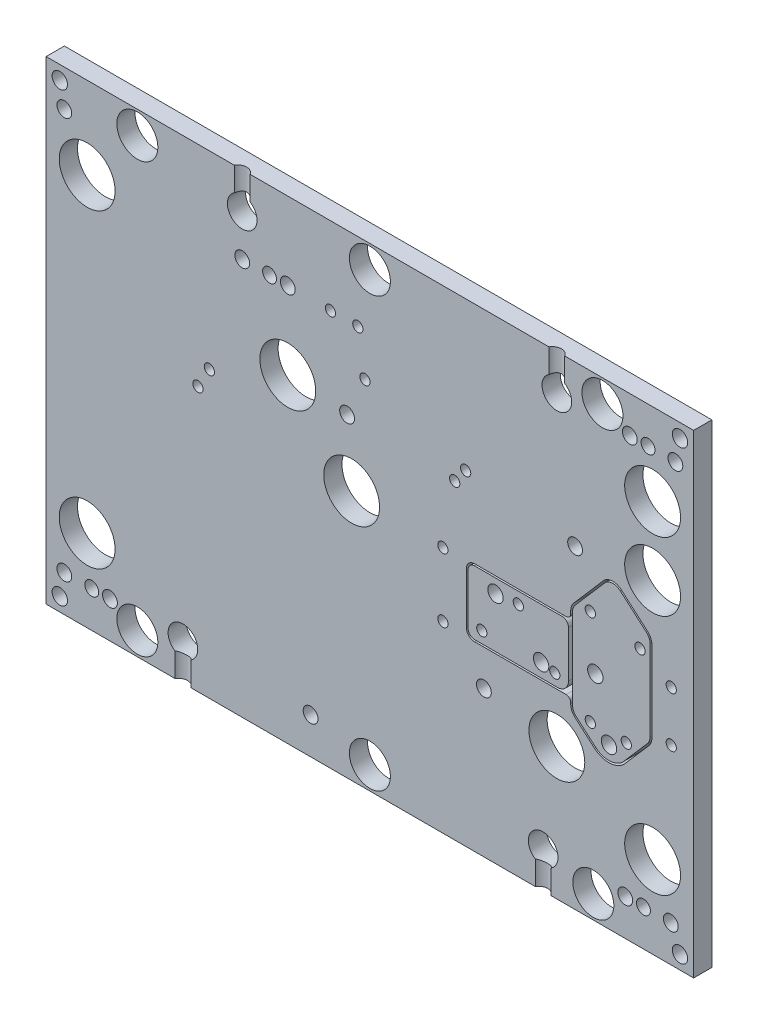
ISO-10303-21;
HEADER;
FILE_DESCRIPTION(('STEP AP214'),'2;1');
FILE_NAME('part.step','',(''),(''),'','','');
FILE_SCHEMA(('AUTOMOTIVE_DESIGN { 1 0 10303 214 1 1 1 1 }'));
ENDSEC;
DATA;
#1=APPLICATION_CONTEXT('core data for automotive mechanical design processes');
#2=APPLICATION_PROTOCOL_DEFINITION('international standard','automotive_design',2000,#1);
#3=PRODUCT_CONTEXT('',#1,'mechanical');
#4=PRODUCT('Part','Part','',(#3));
#5=PRODUCT_RELATED_PRODUCT_CATEGORY('part','',(#4));
#6=PRODUCT_DEFINITION_FORMATION('','',#4);
#7=PRODUCT_DEFINITION_CONTEXT('part definition',#1,'design');
#8=PRODUCT_DEFINITION('design','',#6,#7);
#9=PRODUCT_DEFINITION_SHAPE('','',#8);
#10=(LENGTH_UNIT() NAMED_UNIT(*) SI_UNIT(.MILLI.,.METRE.));
#11=(NAMED_UNIT(*) PLANE_ANGLE_UNIT() SI_UNIT($,.RADIAN.));
#12=(NAMED_UNIT(*) SI_UNIT($,.STERADIAN.) SOLID_ANGLE_UNIT());
#13=UNCERTAINTY_MEASURE_WITH_UNIT(LENGTH_MEASURE(1.E-05),#10,'distance_accuracy_value','');
#14=(GEOMETRIC_REPRESENTATION_CONTEXT(3) GLOBAL_UNCERTAINTY_ASSIGNED_CONTEXT((#13)) GLOBAL_UNIT_ASSIGNED_CONTEXT((#10,
#11,#12)) REPRESENTATION_CONTEXT('',''));
#15=CARTESIAN_POINT('',(0.,0.,0.));
#16=DIRECTION('',(0.,0.,1.));
#17=DIRECTION('',(1.,0.,0.));
#18=AXIS2_PLACEMENT_3D('',#15,#16,#17);
#19=CARTESIAN_POINT('',(-840.26329577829,-45.5554062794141,12.7));
#20=DIRECTION('',(0.,0.,-1.));
#21=DIRECTION('',(-1.,0.,0.));
#22=AXIS2_PLACEMENT_3D('',#19,#20,#21);
#23=CYLINDRICAL_SURFACE('',#22,7.61999999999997);
#24=CARTESIAN_POINT('',(-840.26329577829,-45.5554062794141,0.));
#25=DIRECTION('',(0.,0.,-1.));
#26=DIRECTION('',(-1.,0.,0.));
#27=AXIS2_PLACEMENT_3D('',#24,#25,#26);
#28=CIRCLE('',#27,7.61999999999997);
#29=CARTESIAN_POINT('',(-832.64329577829,-45.5554062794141,0.));
#30=VERTEX_POINT('',#29);
#31=CARTESIAN_POINT('',(-840.26329577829,-53.1754062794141,0.));
#32=VERTEX_POINT('',#31);
#33=EDGE_CURVE('E166',#30,#32,#28,.T.);
#34=ORIENTED_EDGE('',*,*,#33,.F.);
#35=DIRECTION('',(0.,0.,-1.));
#36=VECTOR('',#35,1.);
#37=CARTESIAN_POINT('',(-832.64329577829,-45.5554062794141,12.7));
#38=LINE('',#37,#36);
#39=CARTESIAN_POINT('',(-832.64329577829,-45.5554062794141,12.7));
#40=VERTEX_POINT('',#39);
#41=EDGE_CURVE('E13',#40,#30,#38,.T.);
#42=ORIENTED_EDGE('',*,*,#41,.F.);
#43=CARTESIAN_POINT('',(-840.26329577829,-45.5554062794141,12.7));
#44=DIRECTION('',(0.,0.,-1.));
#45=DIRECTION('',(-1.,0.,0.));
#46=AXIS2_PLACEMENT_3D('',#43,#44,#45);
#47=CIRCLE('',#46,7.61999999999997);
#48=CARTESIAN_POINT('',(-840.26329577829,-53.1754062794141,12.7));
#49=VERTEX_POINT('',#48);
#50=EDGE_CURVE('E195',#40,#49,#47,.T.);
#51=ORIENTED_EDGE('',*,*,#50,.T.);
#52=DIRECTION('',(0.,0.,-1.));
#53=VECTOR('',#52,1.);
#54=CARTESIAN_POINT('',(-840.26329577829,-53.1754062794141,12.7));
#55=LINE('',#54,#53);
#56=EDGE_CURVE('E65',#49,#32,#55,.T.);
#57=ORIENTED_EDGE('',*,*,#56,.T.);
#58=EDGE_LOOP('',(#34,#42,#51,#57));
#59=FACE_BOUND('',#58,.T.);
#60=ADVANCED_FACE('F62',(#59),#23,.T.);
#61=CARTESIAN_POINT('',(-832.64329577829,-13.1704062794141,12.7));
#62=DIRECTION('',(1.,0.,0.));
#63=DIRECTION('',(0.,0.,-1.));
#64=AXIS2_PLACEMENT_3D('',#61,#62,#63);
#65=PLANE('',#64);
#66=DIRECTION('',(0.,-1.,0.));
#67=VECTOR('',#66,1.);
#68=CARTESIAN_POINT('',(-832.64329577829,-13.1704062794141,0.));
#69=LINE('',#68,#67);
#70=CARTESIAN_POINT('',(-832.64329577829,-13.1704062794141,0.));
#71=VERTEX_POINT('',#70);
#72=EDGE_CURVE('E192',#71,#30,#69,.T.);
#73=ORIENTED_EDGE('',*,*,#72,.F.);
#74=DIRECTION('',(0.,0.,-1.));
#75=VECTOR('',#74,1.);
#76=CARTESIAN_POINT('',(-832.64329577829,-13.1704062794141,12.7));
#77=LINE('',#76,#75);
#78=CARTESIAN_POINT('',(-832.64329577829,-13.1704062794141,12.7));
#79=VERTEX_POINT('',#78);
#80=EDGE_CURVE('E72',#79,#71,#77,.T.);
#81=ORIENTED_EDGE('',*,*,#80,.F.);
#82=DIRECTION('',(0.,-1.,0.));
#83=VECTOR('',#82,1.);
#84=CARTESIAN_POINT('',(-832.64329577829,-13.1704062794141,12.7));
#85=LINE('',#84,#83);
#86=EDGE_CURVE('E151',#79,#40,#85,.T.);
#87=ORIENTED_EDGE('',*,*,#86,.T.);
#88=ORIENTED_EDGE('',*,*,#41,.T.);
#89=EDGE_LOOP('',(#73,#81,#87,#88));
#90=FACE_BOUND('',#89,.T.);
#91=ADVANCED_FACE('F216',(#90),#65,.T.);
#92=CARTESIAN_POINT('',(-837.08829577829,-13.1704062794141,12.7));
#93=DIRECTION('',(0.,0.,-1.));
#94=DIRECTION('',(-1.,0.,0.));
#95=AXIS2_PLACEMENT_3D('',#92,#93,#94);
#96=CYLINDRICAL_SURFACE('',#95,4.44500000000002);
#97=CARTESIAN_POINT('',(-837.08829577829,-13.1704062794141,0.));
#98=DIRECTION('',(0.,0.,-1.));
#99=DIRECTION('',(-1.,0.,0.));
#100=AXIS2_PLACEMENT_3D('',#97,#98,#99);
#101=CIRCLE('',#100,4.44500000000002);
#102=CARTESIAN_POINT('',(-837.08829577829,-8.72540627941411,0.));
#103=VERTEX_POINT('',#102);
#104=EDGE_CURVE('E137',#103,#71,#101,.T.);
#105=ORIENTED_EDGE('',*,*,#104,.F.);
#106=DIRECTION('',(0.,0.,-1.));
#107=VECTOR('',#106,1.);
#108=CARTESIAN_POINT('',(-837.08829577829,-8.72540627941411,12.7));
#109=LINE('',#108,#107);
#110=CARTESIAN_POINT('',(-837.08829577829,-8.72540627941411,12.7));
#111=VERTEX_POINT('',#110);
#112=EDGE_CURVE('E132',#111,#103,#109,.T.);
#113=ORIENTED_EDGE('',*,*,#112,.F.);
#114=CARTESIAN_POINT('',(-837.08829577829,-13.1704062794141,12.7));
#115=DIRECTION('',(0.,0.,-1.));
#116=DIRECTION('',(-1.,0.,0.));
#117=AXIS2_PLACEMENT_3D('',#114,#115,#116);
#118=CIRCLE('',#117,4.44500000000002);
#119=EDGE_CURVE('E135',#111,#79,#118,.T.);
#120=ORIENTED_EDGE('',*,*,#119,.T.);
#121=ORIENTED_EDGE('',*,*,#80,.T.);
#122=EDGE_LOOP('',(#105,#113,#120,#121));
#123=FACE_BOUND('',#122,.T.);
#124=ADVANCED_FACE('F134',(#123),#96,.T.);
#125=CARTESIAN_POINT('',(-898.04829577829,-8.72540627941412,12.7));
#126=DIRECTION('',(0.,1.,0.));
#127=DIRECTION('',(0.,0.,1.));
#128=AXIS2_PLACEMENT_3D('',#125,#126,#127);
#129=PLANE('',#128);
#130=DIRECTION('',(1.,0.,0.));
#131=VECTOR('',#130,1.);
#132=CARTESIAN_POINT('',(-898.04829577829,-8.72540627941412,0.));
#133=LINE('',#132,#131);
#134=CARTESIAN_POINT('',(-898.04829577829,-8.72540627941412,0.));
#135=VERTEX_POINT('',#134);
#136=EDGE_CURVE('E187',#135,#103,#133,.T.);
#137=ORIENTED_EDGE('',*,*,#136,.F.);
#138=DIRECTION('',(0.,0.,-1.));
#139=VECTOR('',#138,1.);
#140=CARTESIAN_POINT('',(-898.04829577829,-8.72540627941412,12.7));
#141=LINE('',#140,#139);
#142=CARTESIAN_POINT('',(-898.04829577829,-8.72540627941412,12.7));
#143=VERTEX_POINT('',#142);
#144=EDGE_CURVE('E143',#143,#135,#141,.T.);
#145=ORIENTED_EDGE('',*,*,#144,.F.);
#146=DIRECTION('',(1.,0.,0.));
#147=VECTOR('',#146,1.);
#148=CARTESIAN_POINT('',(-898.04829577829,-8.72540627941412,12.7));
#149=LINE('',#148,#147);
#150=EDGE_CURVE('E149',#143,#111,#149,.T.);
#151=ORIENTED_EDGE('',*,*,#150,.T.);
#152=ORIENTED_EDGE('',*,*,#112,.T.);
#153=EDGE_LOOP('',(#137,#145,#151,#152));
#154=FACE_BOUND('',#153,.T.);
#155=ADVANCED_FACE('F154',(#154),#129,.T.);
#156=CARTESIAN_POINT('',(-898.04829577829,-13.1704062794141,12.7));
#157=DIRECTION('',(0.,0.,-1.));
#158=DIRECTION('',(-1.,0.,0.));
#159=AXIS2_PLACEMENT_3D('',#156,#157,#158);
#160=CYLINDRICAL_SURFACE('',#159,4.44500000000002);
#161=CARTESIAN_POINT('',(-898.04829577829,-13.1704062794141,0.));
#162=DIRECTION('',(0.,0.,-1.));
#163=DIRECTION('',(-1.,0.,0.));
#164=AXIS2_PLACEMENT_3D('',#161,#162,#163);
#165=CIRCLE('',#164,4.44500000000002);
#166=CARTESIAN_POINT('',(-902.49329577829,-13.1704062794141,0.));
#167=VERTEX_POINT('',#166);
#168=EDGE_CURVE('E183',#167,#135,#165,.T.);
#169=ORIENTED_EDGE('',*,*,#168,.F.);
#170=DIRECTION('',(0.,0.,-1.));
#171=VECTOR('',#170,1.);
#172=CARTESIAN_POINT('',(-902.49329577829,-13.1704062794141,12.7));
#173=LINE('',#172,#171);
#174=CARTESIAN_POINT('',(-902.49329577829,-13.1704062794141,12.7));
#175=VERTEX_POINT('',#174);
#176=EDGE_CURVE('E201',#175,#167,#173,.T.);
#177=ORIENTED_EDGE('',*,*,#176,.F.);
#178=CARTESIAN_POINT('',(-898.04829577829,-13.1704062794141,12.7));
#179=DIRECTION('',(0.,0.,-1.));
#180=DIRECTION('',(-1.,0.,0.));
#181=AXIS2_PLACEMENT_3D('',#178,#179,#180);
#182=CIRCLE('',#181,4.44500000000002);
#183=EDGE_CURVE('E156',#175,#143,#182,.T.);
#184=ORIENTED_EDGE('',*,*,#183,.T.);
#185=ORIENTED_EDGE('',*,*,#144,.T.);
#186=EDGE_LOOP('',(#169,#177,#184,#185));
#187=FACE_BOUND('',#186,.T.);
#188=ADVANCED_FACE('F229',(#187),#160,.T.);
#189=CARTESIAN_POINT('',(-902.49329577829,-48.7304062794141,12.7));
#190=DIRECTION('',(-1.,0.,0.));
#191=DIRECTION('',(0.,0.,1.));
#192=AXIS2_PLACEMENT_3D('',#189,#190,#191);
#193=PLANE('',#192);
#194=DIRECTION('',(0.,1.,0.));
#195=VECTOR('',#194,1.);
#196=CARTESIAN_POINT('',(-902.49329577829,-48.7304062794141,0.));
#197=LINE('',#196,#195);
#198=CARTESIAN_POINT('',(-902.49329577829,-48.7304062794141,0.));
#199=VERTEX_POINT('',#198);
#200=EDGE_CURVE('E179',#199,#167,#197,.T.);
#201=ORIENTED_EDGE('',*,*,#200,.F.);
#202=DIRECTION('',(0.,0.,-1.));
#203=VECTOR('',#202,1.);
#204=CARTESIAN_POINT('',(-902.49329577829,-48.7304062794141,12.7));
#205=LINE('',#204,#203);
#206=CARTESIAN_POINT('',(-902.49329577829,-48.7304062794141,12.7));
#207=VERTEX_POINT('',#206);
#208=EDGE_CURVE('E204',#207,#199,#205,.T.);
#209=ORIENTED_EDGE('',*,*,#208,.F.);
#210=DIRECTION('',(0.,1.,0.));
#211=VECTOR('',#210,1.);
#212=CARTESIAN_POINT('',(-902.49329577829,-48.7304062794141,12.7));
#213=LINE('',#212,#211);
#214=EDGE_CURVE('E160',#207,#175,#213,.T.);
#215=ORIENTED_EDGE('',*,*,#214,.T.);
#216=ORIENTED_EDGE('',*,*,#176,.T.);
#217=EDGE_LOOP('',(#201,#209,#215,#216));
#218=FACE_BOUND('',#217,.T.);
#219=ADVANCED_FACE('F232',(#218),#193,.T.);
#220=CARTESIAN_POINT('',(-898.04829577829,-48.7304062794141,12.7));
#221=DIRECTION('',(0.,0.,-1.));
#222=DIRECTION('',(-1.,0.,0.));
#223=AXIS2_PLACEMENT_3D('',#220,#221,#222);
#224=CYLINDRICAL_SURFACE('',#223,4.44500000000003);
#225=CARTESIAN_POINT('',(-898.04829577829,-48.7304062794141,0.));
#226=DIRECTION('',(0.,0.,-1.));
#227=DIRECTION('',(-1.,0.,0.));
#228=AXIS2_PLACEMENT_3D('',#225,#226,#227);
#229=CIRCLE('',#228,4.44500000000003);
#230=CARTESIAN_POINT('',(-898.04829577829,-53.1754062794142,0.));
#231=VERTEX_POINT('',#230);
#232=EDGE_CURVE('E175',#231,#199,#229,.T.);
#233=ORIENTED_EDGE('',*,*,#232,.F.);
#234=DIRECTION('',(0.,0.,-1.));
#235=VECTOR('',#234,1.);
#236=CARTESIAN_POINT('',(-898.04829577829,-53.1754062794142,12.7));
#237=LINE('',#236,#235);
#238=CARTESIAN_POINT('',(-898.04829577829,-53.1754062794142,12.7));
#239=VERTEX_POINT('',#238);
#240=EDGE_CURVE('E206',#239,#231,#237,.T.);
#241=ORIENTED_EDGE('',*,*,#240,.F.);
#242=CARTESIAN_POINT('',(-898.04829577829,-48.7304062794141,12.7));
#243=DIRECTION('',(0.,0.,-1.));
#244=DIRECTION('',(-1.,0.,0.));
#245=AXIS2_PLACEMENT_3D('',#242,#243,#244);
#246=CIRCLE('',#245,4.44500000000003);
#247=EDGE_CURVE('E393',#239,#207,#246,.T.);
#248=ORIENTED_EDGE('',*,*,#247,.T.);
#249=ORIENTED_EDGE('',*,*,#208,.T.);
#250=EDGE_LOOP('',(#233,#241,#248,#249));
#251=FACE_BOUND('',#250,.T.);
#252=ADVANCED_FACE('F236',(#251),#224,.T.);
#253=CARTESIAN_POINT('',(-840.26329577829,-53.1754062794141,12.7));
#254=DIRECTION('',(0.,-1.,0.));
#255=DIRECTION('',(1.,0.,0.));
#256=AXIS2_PLACEMENT_3D('',#253,#254,#255);
#257=PLANE('',#256);
#258=DIRECTION('',(-1.,0.,0.));
#259=VECTOR('',#258,1.);
#260=CARTESIAN_POINT('',(-840.26329577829,-53.1754062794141,0.));
#261=LINE('',#260,#259);
#262=EDGE_CURVE('E170',#32,#231,#261,.T.);
#263=ORIENTED_EDGE('',*,*,#262,.F.);
#264=ORIENTED_EDGE('',*,*,#56,.F.);
#265=DIRECTION('',(-1.,0.,0.));
#266=VECTOR('',#265,1.);
#267=CARTESIAN_POINT('',(-840.26329577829,-53.1754062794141,12.7));
#268=LINE('',#267,#266);
#269=EDGE_CURVE('E390',#49,#239,#268,.T.);
#270=ORIENTED_EDGE('',*,*,#269,.T.);
#271=ORIENTED_EDGE('',*,*,#240,.T.);
#272=EDGE_LOOP('',(#263,#264,#270,#271));
#273=FACE_BOUND('',#272,.T.);
#274=ADVANCED_FACE('F213',(#273),#257,.T.);
#275=CARTESIAN_POINT('',(-840.26329577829,-45.5554062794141,12.7));
#276=DIRECTION('',(0.,0.,-1.));
#277=DIRECTION('',(-1.,0.,0.));
#278=AXIS2_PLACEMENT_3D('',#275,#276,#277);
#279=PLANE('',#278);
#280=CARTESIAN_POINT('',(-851.69329577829,-43.6504062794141,12.7));
#281=DIRECTION('',(0.,0.,1.));
#282=DIRECTION('',(1.,0.,0.));
#283=AXIS2_PLACEMENT_3D('',#280,#281,#282);
#284=CIRCLE('',#283,5.35940000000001);
#285=CARTESIAN_POINT('',(-846.33389577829,-43.6504062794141,12.7));
#286=VERTEX_POINT('',#285);
#287=EDGE_CURVE('E301',#286,#286,#284,.T.);
#288=ORIENTED_EDGE('',*,*,#287,.F.);
#289=EDGE_LOOP('',(#288));
#290=FACE_BOUND('',#289,.T.);
#291=CARTESIAN_POINT('',(-883.44329577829,-18.2504062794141,12.7));
#292=DIRECTION('',(0.,0.,1.));
#293=DIRECTION('',(1.,0.,0.));
#294=AXIS2_PLACEMENT_3D('',#291,#292,#293);
#295=CIRCLE('',#294,5.35940000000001);
#296=CARTESIAN_POINT('',(-878.08389577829,-18.2504062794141,12.7));
#297=VERTEX_POINT('',#296);
#298=EDGE_CURVE('E356',#297,#297,#295,.T.);
#299=ORIENTED_EDGE('',*,*,#298,.F.);
#300=EDGE_LOOP('',(#299));
#301=FACE_BOUND('',#300,.T.);
#302=CARTESIAN_POINT('',(-842.16829577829,-45.2379062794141,12.7));
#303=DIRECTION('',(0.,0.,-1.));
#304=DIRECTION('',(-1.,0.,0.));
#305=AXIS2_PLACEMENT_3D('',#302,#303,#304);
#306=CIRCLE('',#305,3.56869999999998);
#307=CARTESIAN_POINT('',(-845.73699577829,-45.2379062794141,12.7));
#308=VERTEX_POINT('',#307);
#309=EDGE_CURVE('E343',#308,#308,#306,.T.);
#310=ORIENTED_EDGE('',*,*,#309,.T.);
#311=EDGE_LOOP('',(#310));
#312=FACE_BOUND('',#311,.T.);
#313=CARTESIAN_POINT('',(-892.96829577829,-45.2379062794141,12.7));
#314=DIRECTION('',(0.,0.,-1.));
#315=DIRECTION('',(-1.,0.,0.));
#316=AXIS2_PLACEMENT_3D('',#313,#314,#315);
#317=CIRCLE('',#316,3.56869999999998);
#318=CARTESIAN_POINT('',(-896.53699577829,-45.2379062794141,12.7));
#319=VERTEX_POINT('',#318);
#320=EDGE_CURVE('E332',#319,#319,#317,.T.);
#321=ORIENTED_EDGE('',*,*,#320,.T.);
#322=EDGE_LOOP('',(#321));
#323=FACE_BOUND('',#322,.T.);
#324=CARTESIAN_POINT('',(-867.56829577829,-16.6629062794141,12.7));
#325=DIRECTION('',(0.,0.,-1.));
#326=DIRECTION('',(-1.,0.,0.));
#327=AXIS2_PLACEMENT_3D('',#324,#325,#326);
#328=CIRCLE('',#327,3.56869999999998);
#329=CARTESIAN_POINT('',(-871.13699577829,-16.6629062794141,12.7));
#330=VERTEX_POINT('',#329);
#331=EDGE_CURVE('E316',#330,#330,#328,.T.);
#332=ORIENTED_EDGE('',*,*,#331,.T.);
#333=EDGE_LOOP('',(#332));
#334=FACE_BOUND('',#333,.T.);
#335=ORIENTED_EDGE('',*,*,#50,.F.);
#336=ORIENTED_EDGE('',*,*,#86,.F.);
#337=ORIENTED_EDGE('',*,*,#119,.F.);
#338=ORIENTED_EDGE('',*,*,#150,.F.);
#339=ORIENTED_EDGE('',*,*,#183,.F.);
#340=ORIENTED_EDGE('',*,*,#214,.F.);
#341=ORIENTED_EDGE('',*,*,#247,.F.);
#342=ORIENTED_EDGE('',*,*,#269,.F.);
#343=EDGE_LOOP('',(#335,#336,#337,#338,#339,#340,#341,#342));
#344=FACE_BOUND('',#343,.T.);
#345=ADVANCED_FACE('F147',(#290,#301,#312,#323,#334,#344),#279,.F.);
#346=CARTESIAN_POINT('',(-840.26329577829,-45.5554062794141,0.));
#347=DIRECTION('',(0.,0.,-1.));
#348=DIRECTION('',(-1.,0.,0.));
#349=AXIS2_PLACEMENT_3D('',#346,#347,#348);
#350=PLANE('',#349);
#351=CARTESIAN_POINT('',(-851.69329577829,-43.6504062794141,0.));
#352=DIRECTION('',(0.,0.,1.));
#353=DIRECTION('',(1.,0.,0.));
#354=AXIS2_PLACEMENT_3D('',#351,#352,#353);
#355=CIRCLE('',#354,3.56869999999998);
#356=CARTESIAN_POINT('',(-848.12459577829,-43.6504062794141,0.));
#357=VERTEX_POINT('',#356);
#358=EDGE_CURVE('E292',#357,#357,#355,.T.);
#359=ORIENTED_EDGE('',*,*,#358,.T.);
#360=EDGE_LOOP('',(#359));
#361=FACE_BOUND('',#360,.T.);
#362=CARTESIAN_POINT('',(-883.44329577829,-18.2504062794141,0.));
#363=DIRECTION('',(0.,0.,1.));
#364=DIRECTION('',(1.,0.,0.));
#365=AXIS2_PLACEMENT_3D('',#362,#363,#364);
#366=CIRCLE('',#365,3.56869999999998);
#367=CARTESIAN_POINT('',(-879.87459577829,-18.2504062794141,0.));
#368=VERTEX_POINT('',#367);
#369=EDGE_CURVE('E417',#368,#368,#366,.T.);
#370=ORIENTED_EDGE('',*,*,#369,.T.);
#371=EDGE_LOOP('',(#370));
#372=FACE_BOUND('',#371,.T.);
#373=CARTESIAN_POINT('',(-842.16829577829,-45.2379062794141,0.));
#374=DIRECTION('',(0.,0.,-1.));
#375=DIRECTION('',(-1.,0.,0.));
#376=AXIS2_PLACEMENT_3D('',#373,#374,#375);
#377=CIRCLE('',#376,3.56869999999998);
#378=CARTESIAN_POINT('',(-845.73699577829,-45.2379062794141,0.));
#379=VERTEX_POINT('',#378);
#380=EDGE_CURVE('E337',#379,#379,#377,.T.);
#381=ORIENTED_EDGE('',*,*,#380,.F.);
#382=EDGE_LOOP('',(#381));
#383=FACE_BOUND('',#382,.T.);
#384=CARTESIAN_POINT('',(-892.96829577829,-45.2379062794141,0.));
#385=DIRECTION('',(0.,0.,-1.));
#386=DIRECTION('',(-1.,0.,0.));
#387=AXIS2_PLACEMENT_3D('',#384,#385,#386);
#388=CIRCLE('',#387,3.56869999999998);
#389=CARTESIAN_POINT('',(-896.53699577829,-45.2379062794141,0.));
#390=VERTEX_POINT('',#389);
#391=EDGE_CURVE('E322',#390,#390,#388,.T.);
#392=ORIENTED_EDGE('',*,*,#391,.F.);
#393=EDGE_LOOP('',(#392));
#394=FACE_BOUND('',#393,.T.);
#395=CARTESIAN_POINT('',(-867.56829577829,-16.6629062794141,0.));
#396=DIRECTION('',(0.,0.,-1.));
#397=DIRECTION('',(-1.,0.,0.));
#398=AXIS2_PLACEMENT_3D('',#395,#396,#397);
#399=CIRCLE('',#398,3.56869999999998);
#400=CARTESIAN_POINT('',(-871.13699577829,-16.6629062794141,0.));
#401=VERTEX_POINT('',#400);
#402=EDGE_CURVE('E171',#401,#401,#399,.T.);
#403=ORIENTED_EDGE('',*,*,#402,.F.);
#404=EDGE_LOOP('',(#403));
#405=FACE_BOUND('',#404,.T.);
#406=ORIENTED_EDGE('',*,*,#33,.T.);
#407=ORIENTED_EDGE('',*,*,#262,.T.);
#408=ORIENTED_EDGE('',*,*,#232,.T.);
#409=ORIENTED_EDGE('',*,*,#200,.T.);
#410=ORIENTED_EDGE('',*,*,#168,.T.);
#411=ORIENTED_EDGE('',*,*,#136,.T.);
#412=ORIENTED_EDGE('',*,*,#104,.T.);
#413=ORIENTED_EDGE('',*,*,#72,.T.);
#414=EDGE_LOOP('',(#406,#407,#408,#409,#410,#411,#412,#413));
#415=FACE_BOUND('',#414,.T.);
#416=ADVANCED_FACE('F215',(#361,#372,#383,#394,#405,#415),#350,.T.);
#417=CARTESIAN_POINT('',(-867.56829577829,-16.6629062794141,0.));
#418=DIRECTION('',(0.,0.,-1.));
#419=DIRECTION('',(-1.,0.,0.));
#420=AXIS2_PLACEMENT_3D('',#417,#418,#419);
#421=CYLINDRICAL_SURFACE('',#420,3.56869999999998);
#422=ORIENTED_EDGE('',*,*,#331,.F.);
#423=EDGE_LOOP('',(#422));
#424=FACE_BOUND('',#423,.T.);
#425=ORIENTED_EDGE('',*,*,#402,.T.);
#426=EDGE_LOOP('',(#425));
#427=FACE_BOUND('',#426,.T.);
#428=ADVANCED_FACE('F248',(#424,#427),#421,.F.);
#429=CARTESIAN_POINT('',(-892.96829577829,-45.2379062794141,0.));
#430=DIRECTION('',(0.,0.,-1.));
#431=DIRECTION('',(-1.,0.,0.));
#432=AXIS2_PLACEMENT_3D('',#429,#430,#431);
#433=CYLINDRICAL_SURFACE('',#432,3.56869999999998);
#434=ORIENTED_EDGE('',*,*,#320,.F.);
#435=EDGE_LOOP('',(#434));
#436=FACE_BOUND('',#435,.T.);
#437=ORIENTED_EDGE('',*,*,#391,.T.);
#438=EDGE_LOOP('',(#437));
#439=FACE_BOUND('',#438,.T.);
#440=ADVANCED_FACE('F255',(#436,#439),#433,.F.);
#441=CARTESIAN_POINT('',(-842.16829577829,-45.2379062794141,0.));
#442=DIRECTION('',(0.,0.,-1.));
#443=DIRECTION('',(-1.,0.,0.));
#444=AXIS2_PLACEMENT_3D('',#441,#442,#443);
#445=CYLINDRICAL_SURFACE('',#444,3.56869999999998);
#446=ORIENTED_EDGE('',*,*,#309,.F.);
#447=EDGE_LOOP('',(#446));
#448=FACE_BOUND('',#447,.T.);
#449=ORIENTED_EDGE('',*,*,#380,.T.);
#450=EDGE_LOOP('',(#449));
#451=FACE_BOUND('',#450,.T.);
#452=ADVANCED_FACE('F259',(#448,#451),#445,.F.);
#453=CARTESIAN_POINT('',(-883.44329577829,-18.2504062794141,12.7));
#454=DIRECTION('',(0.,0.,1.));
#455=DIRECTION('',(1.,0.,0.));
#456=AXIS2_PLACEMENT_3D('',#453,#454,#455);
#457=CYLINDRICAL_SURFACE('',#456,5.35940000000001);
#458=CARTESIAN_POINT('',(-883.44329577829,-18.2504062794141,4.82600000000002));
#459=DIRECTION('',(0.,0.,1.));
#460=DIRECTION('',(1.,0.,0.));
#461=AXIS2_PLACEMENT_3D('',#458,#459,#460);
#462=CIRCLE('',#461,5.35940000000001);
#463=CARTESIAN_POINT('',(-878.08389577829,-18.2504062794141,4.82600000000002));
#464=VERTEX_POINT('',#463);
#465=EDGE_CURVE('E351',#464,#464,#462,.T.);
#466=ORIENTED_EDGE('',*,*,#465,.F.);
#467=EDGE_LOOP('',(#466));
#468=FACE_BOUND('',#467,.T.);
#469=ORIENTED_EDGE('',*,*,#298,.T.);
#470=EDGE_LOOP('',(#469));
#471=FACE_BOUND('',#470,.T.);
#472=ADVANCED_FACE('F263',(#468,#471),#457,.F.);
#473=CARTESIAN_POINT('',(-879.87459577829,-18.2504062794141,4.82600000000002));
#474=DIRECTION('',(0.,0.,-1.));
#475=DIRECTION('',(-1.,0.,0.));
#476=AXIS2_PLACEMENT_3D('',#473,#474,#475);
#477=PLANE('',#476);
#478=CARTESIAN_POINT('',(-883.44329577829,-18.2504062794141,4.82600000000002));
#479=DIRECTION('',(0.,0.,1.));
#480=DIRECTION('',(1.,0.,0.));
#481=AXIS2_PLACEMENT_3D('',#478,#479,#480);
#482=CIRCLE('',#481,3.56869999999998);
#483=CARTESIAN_POINT('',(-879.87459577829,-18.2504062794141,4.82600000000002));
#484=VERTEX_POINT('',#483);
#485=EDGE_CURVE('E357',#484,#484,#482,.T.);
#486=ORIENTED_EDGE('',*,*,#485,.F.);
#487=EDGE_LOOP('',(#486));
#488=FACE_BOUND('',#487,.T.);
#489=ORIENTED_EDGE('',*,*,#465,.T.);
#490=EDGE_LOOP('',(#489));
#491=FACE_BOUND('',#490,.T.);
#492=ADVANCED_FACE('F267',(#488,#491),#477,.F.);
#493=CARTESIAN_POINT('',(-883.44329577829,-18.2504062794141,12.7));
#494=DIRECTION('',(0.,0.,1.));
#495=DIRECTION('',(1.,0.,0.));
#496=AXIS2_PLACEMENT_3D('',#493,#494,#495);
#497=CYLINDRICAL_SURFACE('',#496,3.56869999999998);
#498=ORIENTED_EDGE('',*,*,#369,.F.);
#499=EDGE_LOOP('',(#498));
#500=FACE_BOUND('',#499,.T.);
#501=ORIENTED_EDGE('',*,*,#485,.T.);
#502=EDGE_LOOP('',(#501));
#503=FACE_BOUND('',#502,.T.);
#504=ADVANCED_FACE('F271',(#500,#503),#497,.F.);
#505=CARTESIAN_POINT('',(-851.69329577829,-43.6504062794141,12.7));
#506=DIRECTION('',(0.,0.,1.));
#507=DIRECTION('',(1.,0.,0.));
#508=AXIS2_PLACEMENT_3D('',#505,#506,#507);
#509=CYLINDRICAL_SURFACE('',#508,5.35940000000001);
#510=CARTESIAN_POINT('',(-851.69329577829,-43.6504062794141,4.82600000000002));
#511=DIRECTION('',(0.,0.,1.));
#512=DIRECTION('',(1.,0.,0.));
#513=AXIS2_PLACEMENT_3D('',#510,#511,#512);
#514=CIRCLE('',#513,5.35940000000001);
#515=CARTESIAN_POINT('',(-846.33389577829,-43.6504062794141,4.82600000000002));
#516=VERTEX_POINT('',#515);
#517=EDGE_CURVE('E296',#516,#516,#514,.T.);
#518=ORIENTED_EDGE('',*,*,#517,.F.);
#519=EDGE_LOOP('',(#518));
#520=FACE_BOUND('',#519,.T.);
#521=ORIENTED_EDGE('',*,*,#287,.T.);
#522=EDGE_LOOP('',(#521));
#523=FACE_BOUND('',#522,.T.);
#524=ADVANCED_FACE('F275',(#520,#523),#509,.F.);
#525=CARTESIAN_POINT('',(-848.12459577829,-43.6504062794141,4.82600000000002));
#526=DIRECTION('',(0.,0.,-1.));
#527=DIRECTION('',(-1.,0.,0.));
#528=AXIS2_PLACEMENT_3D('',#525,#526,#527);
#529=PLANE('',#528);
#530=CARTESIAN_POINT('',(-851.69329577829,-43.6504062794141,4.82600000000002));
#531=DIRECTION('',(0.,0.,1.));
#532=DIRECTION('',(1.,0.,0.));
#533=AXIS2_PLACEMENT_3D('',#530,#531,#532);
#534=CIRCLE('',#533,3.56869999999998);
#535=CARTESIAN_POINT('',(-848.12459577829,-43.6504062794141,4.82600000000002));
#536=VERTEX_POINT('',#535);
#537=EDGE_CURVE('E295',#536,#536,#534,.T.);
#538=ORIENTED_EDGE('',*,*,#537,.F.);
#539=EDGE_LOOP('',(#538));
#540=FACE_BOUND('',#539,.T.);
#541=ORIENTED_EDGE('',*,*,#517,.T.);
#542=EDGE_LOOP('',(#541));
#543=FACE_BOUND('',#542,.T.);
#544=ADVANCED_FACE('F279',(#540,#543),#529,.F.);
#545=CARTESIAN_POINT('',(-851.69329577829,-43.6504062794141,12.7));
#546=DIRECTION('',(0.,0.,1.));
#547=DIRECTION('',(1.,0.,0.));
#548=AXIS2_PLACEMENT_3D('',#545,#546,#547);
#549=CYLINDRICAL_SURFACE('',#548,3.56869999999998);
#550=ORIENTED_EDGE('',*,*,#358,.F.);
#551=EDGE_LOOP('',(#550));
#552=FACE_BOUND('',#551,.T.);
#553=ORIENTED_EDGE('',*,*,#537,.T.);
#554=EDGE_LOOP('',(#553));
#555=FACE_BOUND('',#554,.T.);
#556=ADVANCED_FACE('F283',(#552,#555),#549,.F.);
#557=CLOSED_SHELL('',(#60,#91,#124,#155,#188,#219,#252,#274,#345,#416,#428,#440,#452,#472,#492,
#504,#524,#544,#556));
#558=MANIFOLD_SOLID_BREP('B2',#557);
#559=CARTESIAN_POINT('',(-783.463,-50.7534898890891,12.7));
#560=DIRECTION('',(0.,0.,-1.));
#561=DIRECTION('',(-1.,0.,0.));
#562=AXIS2_PLACEMENT_3D('',#559,#560,#561);
#563=CYLINDRICAL_SURFACE('',#562,7.61999999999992);
#564=CARTESIAN_POINT('',(-783.463,-50.7534898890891,0.));
#565=DIRECTION('',(0.,0.,-1.));
#566=DIRECTION('',(-1.,0.,0.));
#567=AXIS2_PLACEMENT_3D('',#564,#565,#566);
#568=CIRCLE('',#567,7.61999999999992);
#569=CARTESIAN_POINT('',(-775.843,-50.7534898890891,0.));
#570=VERTEX_POINT('',#569);
#571=CARTESIAN_POINT('',(-777.709670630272,-55.7498486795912,0.));
#572=VERTEX_POINT('',#571);
#573=EDGE_CURVE('E724',#570,#572,#568,.T.);
#574=ORIENTED_EDGE('',*,*,#573,.F.);
#575=DIRECTION('',(0.,0.,-1.));
#576=VECTOR('',#575,1.);
#577=CARTESIAN_POINT('',(-775.843,-50.7534898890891,12.7));
#578=LINE('',#577,#576);
#579=CARTESIAN_POINT('',(-775.843,-50.7534898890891,12.7));
#580=VERTEX_POINT('',#579);
#581=EDGE_CURVE('E60',#580,#570,#578,.T.);
#582=ORIENTED_EDGE('',*,*,#581,.F.);
#583=CARTESIAN_POINT('',(-783.463,-50.7534898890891,12.7));
#584=DIRECTION('',(0.,0.,-1.));
#585=DIRECTION('',(-1.,0.,0.));
#586=AXIS2_PLACEMENT_3D('',#583,#584,#585);
#587=CIRCLE('',#586,7.61999999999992);
#588=CARTESIAN_POINT('',(-777.709670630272,-55.7498486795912,12.7));
#589=VERTEX_POINT('',#588);
#590=EDGE_CURVE('E769',#580,#589,#587,.T.);
#591=ORIENTED_EDGE('',*,*,#590,.T.);
#592=DIRECTION('',(0.,0.,-1.));
#593=VECTOR('',#592,1.);
#594=CARTESIAN_POINT('',(-777.709670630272,-55.7498486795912,12.7));
#595=LINE('',#594,#593);
#596=EDGE_CURVE('E599',#589,#572,#595,.T.);
#597=ORIENTED_EDGE('',*,*,#596,.T.);
#598=EDGE_LOOP('',(#574,#582,#591,#597));
#599=FACE_BOUND('',#598,.T.);
#600=ADVANCED_FACE('F596',(#599),#563,.T.);
#601=CARTESIAN_POINT('',(-775.843,5.39033140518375,12.7));
#602=DIRECTION('',(1.,0.,0.));
#603=DIRECTION('',(0.,1.,0.));
#604=AXIS2_PLACEMENT_3D('',#601,#602,#603);
#605=PLANE('',#604);
#606=DIRECTION('',(0.,-1.,0.));
#607=VECTOR('',#606,1.);
#608=CARTESIAN_POINT('',(-775.843,5.39033140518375,0.));
#609=LINE('',#608,#607);
#610=CARTESIAN_POINT('',(-775.843,5.39033140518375,0.));
#611=VERTEX_POINT('',#610);
#612=EDGE_CURVE('E766',#611,#570,#609,.T.);
#613=ORIENTED_EDGE('',*,*,#612,.F.);
#614=DIRECTION('',(0.,0.,-1.));
#615=VECTOR('',#614,1.);
#616=CARTESIAN_POINT('',(-775.843,5.39033140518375,12.7));
#617=LINE('',#616,#615);
#618=CARTESIAN_POINT('',(-775.843,5.39033140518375,12.7));
#619=VERTEX_POINT('',#618);
#620=EDGE_CURVE('E606',#619,#611,#617,.T.);
#621=ORIENTED_EDGE('',*,*,#620,.F.);
#622=DIRECTION('',(0.,-1.,0.));
#623=VECTOR('',#622,1.);
#624=CARTESIAN_POINT('',(-775.843,5.39033140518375,12.7));
#625=LINE('',#624,#623);
#626=EDGE_CURVE('E709',#619,#580,#625,.T.);
#627=ORIENTED_EDGE('',*,*,#626,.T.);
#628=ORIENTED_EDGE('',*,*,#581,.T.);
#629=EDGE_LOOP('',(#613,#621,#627,#628));
#630=FACE_BOUND('',#629,.T.);
#631=ADVANCED_FACE('F802',(#630),#605,.T.);
#632=CARTESIAN_POINT('',(-783.463,5.39033140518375,12.7));
#633=DIRECTION('',(0.,0.,-1.));
#634=DIRECTION('',(-1.,0.,0.));
#635=AXIS2_PLACEMENT_3D('',#632,#633,#634);
#636=CYLINDRICAL_SURFACE('',#635,7.61999999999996);
#637=CARTESIAN_POINT('',(-783.463,5.39033140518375,0.));
#638=DIRECTION('',(0.,0.,-1.));
#639=DIRECTION('',(-1.,0.,0.));
#640=AXIS2_PLACEMENT_3D('',#637,#638,#639);
#641=CIRCLE('',#640,7.61999999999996);
#642=CARTESIAN_POINT('',(-778.466641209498,11.1436607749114,0.));
#643=VERTEX_POINT('',#642);
#644=EDGE_CURVE('E695',#643,#611,#641,.T.);
#645=ORIENTED_EDGE('',*,*,#644,.F.);
#646=DIRECTION('',(0.,0.,-1.));
#647=VECTOR('',#646,1.);
#648=CARTESIAN_POINT('',(-778.466641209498,11.1436607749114,12.7));
#649=LINE('',#648,#647);
#650=CARTESIAN_POINT('',(-778.466641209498,11.1436607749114,12.7));
#651=VERTEX_POINT('',#650);
#652=EDGE_CURVE('E690',#651,#643,#649,.T.);
#653=ORIENTED_EDGE('',*,*,#652,.F.);
#654=CARTESIAN_POINT('',(-783.463,5.39033140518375,12.7));
#655=DIRECTION('',(0.,0.,-1.));
#656=DIRECTION('',(-1.,0.,0.));
#657=AXIS2_PLACEMENT_3D('',#654,#655,#656);
#658=CIRCLE('',#657,7.61999999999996);
#659=EDGE_CURVE('E693',#651,#619,#658,.T.);
#660=ORIENTED_EDGE('',*,*,#659,.T.);
#661=ORIENTED_EDGE('',*,*,#620,.T.);
#662=EDGE_LOOP('',(#645,#653,#660,#661));
#663=FACE_BOUND('',#662,.T.);
#664=ADVANCED_FACE('F692',(#663),#636,.T.);
#665=CARTESIAN_POINT('',(-796.698391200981,26.9766434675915,12.7));
#666=DIRECTION('',(0.655690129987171,0.755030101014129,0.));
#667=DIRECTION('',(-0.755030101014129,0.655690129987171,0.));
#668=AXIS2_PLACEMENT_3D('',#665,#666,#667);
#669=PLANE('',#668);
#670=DIRECTION('',(0.755030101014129,-0.655690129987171,0.));
#671=VECTOR('',#670,1.);
#672=CARTESIAN_POINT('',(-796.698391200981,26.9766434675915,0.));
#673=LINE('',#672,#671);
#674=CARTESIAN_POINT('',(-796.698391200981,26.9766434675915,0.));
#675=VERTEX_POINT('',#674);
#676=EDGE_CURVE('E761',#675,#643,#673,.T.);
#677=ORIENTED_EDGE('',*,*,#676,.F.);
#678=DIRECTION('',(0.,0.,-1.));
#679=VECTOR('',#678,1.);
#680=CARTESIAN_POINT('',(-796.698391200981,26.9766434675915,12.7));
#681=LINE('',#680,#679);
#682=CARTESIAN_POINT('',(-796.698391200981,26.9766434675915,12.7));
#683=VERTEX_POINT('',#682);
#684=EDGE_CURVE('E701',#683,#675,#681,.T.);
#685=ORIENTED_EDGE('',*,*,#684,.F.);
#686=DIRECTION('',(0.755030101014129,-0.655690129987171,0.));
#687=VECTOR('',#686,1.);
#688=CARTESIAN_POINT('',(-796.698391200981,26.9766434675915,12.7));
#689=LINE('',#688,#687);
#690=EDGE_CURVE('E707',#683,#651,#689,.T.);
#691=ORIENTED_EDGE('',*,*,#690,.T.);
#692=ORIENTED_EDGE('',*,*,#652,.T.);
#693=EDGE_LOOP('',(#677,#685,#691,#692));
#694=FACE_BOUND('',#693,.T.);
#695=ADVANCED_FACE('F712',(#694),#669,.T.);
#696=CARTESIAN_POINT('',(-801.694749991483,21.2233140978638,12.7));
#697=DIRECTION('',(0.,0.,-1.));
#698=DIRECTION('',(-1.,0.,0.));
#699=AXIS2_PLACEMENT_3D('',#696,#697,#698);
#700=CYLINDRICAL_SURFACE('',#699,7.62000000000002);
#701=CARTESIAN_POINT('',(-801.694749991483,21.2233140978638,0.));
#702=DIRECTION('',(0.,0.,-1.));
#703=DIRECTION('',(-1.,0.,0.));
#704=AXIS2_PLACEMENT_3D('',#701,#702,#703);
#705=CIRCLE('',#704,7.62000000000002);
#706=CARTESIAN_POINT('',(-807.448079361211,26.2196728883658,0.));
#707=VERTEX_POINT('',#706);
#708=EDGE_CURVE('E757',#707,#675,#705,.T.);
#709=ORIENTED_EDGE('',*,*,#708,.F.);
#710=DIRECTION('',(0.,0.,-1.));
#711=VECTOR('',#710,1.);
#712=CARTESIAN_POINT('',(-807.448079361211,26.2196728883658,12.7));
#713=LINE('',#712,#711);
#714=CARTESIAN_POINT('',(-807.448079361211,26.2196728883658,12.7));
#715=VERTEX_POINT('',#714);
#716=EDGE_CURVE('E775',#715,#707,#713,.T.);
#717=ORIENTED_EDGE('',*,*,#716,.F.);
#718=CARTESIAN_POINT('',(-801.694749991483,21.2233140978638,12.7));
#719=DIRECTION('',(0.,0.,-1.));
#720=DIRECTION('',(-1.,0.,0.));
#721=AXIS2_PLACEMENT_3D('',#718,#719,#720);
#722=CIRCLE('',#721,7.62000000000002);
#723=EDGE_CURVE('E714',#715,#683,#722,.T.);
#724=ORIENTED_EDGE('',*,*,#723,.T.);
#725=ORIENTED_EDGE('',*,*,#684,.T.);
#726=EDGE_LOOP('',(#709,#717,#724,#725));
#727=FACE_BOUND('',#726,.T.);
#728=ADVANCED_FACE('F815',(#727),#700,.T.);
#729=CARTESIAN_POINT('',(-827.951329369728,2.61008931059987,12.7));
#730=DIRECTION('',(-0.755030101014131,0.655690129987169,0.));
#731=DIRECTION('',(-0.655690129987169,-0.755030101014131,0.));
#732=AXIS2_PLACEMENT_3D('',#729,#730,#731);
#733=PLANE('',#732);
#734=DIRECTION('',(0.655690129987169,0.755030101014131,0.));
#735=VECTOR('',#734,1.);
#736=CARTESIAN_POINT('',(-827.951329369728,2.61008931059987,0.));
#737=LINE('',#736,#735);
#738=CARTESIAN_POINT('',(-827.951329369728,2.61008931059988,0.));
#739=VERTEX_POINT('',#738);
#740=EDGE_CURVE('E753',#739,#707,#737,.T.);
#741=ORIENTED_EDGE('',*,*,#740,.F.);
#742=DIRECTION('',(0.,0.,-1.));
#743=VECTOR('',#742,1.);
#744=CARTESIAN_POINT('',(-827.951329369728,2.61008931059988,12.7));
#745=LINE('',#744,#743);
#746=CARTESIAN_POINT('',(-827.951329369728,2.61008931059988,12.7));
#747=VERTEX_POINT('',#746);
#748=EDGE_CURVE('E778',#747,#739,#745,.T.);
#749=ORIENTED_EDGE('',*,*,#748,.F.);
#750=DIRECTION('',(0.655690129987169,0.755030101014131,0.));
#751=VECTOR('',#750,1.);
#752=CARTESIAN_POINT('',(-827.951329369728,2.61008931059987,12.7));
#753=LINE('',#752,#751);
#754=EDGE_CURVE('E718',#747,#715,#753,.T.);
#755=ORIENTED_EDGE('',*,*,#754,.T.);
#756=ORIENTED_EDGE('',*,*,#716,.T.);
#757=EDGE_LOOP('',(#741,#749,#755,#756));
#758=FACE_BOUND('',#757,.T.);
#759=ADVANCED_FACE('F818',(#758),#733,.T.);
#760=CARTESIAN_POINT('',(-822.198,-2.38626947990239,12.7));
#761=DIRECTION('',(0.,0.,-1.));
#762=DIRECTION('',(-1.,0.,0.));
#763=AXIS2_PLACEMENT_3D('',#760,#761,#762);
#764=CYLINDRICAL_SURFACE('',#763,7.62000000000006);
#765=CARTESIAN_POINT('',(-822.198,-2.38626947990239,0.));
#766=DIRECTION('',(0.,0.,-1.));
#767=DIRECTION('',(-1.,0.,0.));
#768=AXIS2_PLACEMENT_3D('',#765,#766,#767);
#769=CIRCLE('',#768,7.62000000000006);
#770=CARTESIAN_POINT('',(-829.818,-2.38626947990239,0.));
#771=VERTEX_POINT('',#770);
#772=EDGE_CURVE('E749',#771,#739,#769,.T.);
#773=ORIENTED_EDGE('',*,*,#772,.F.);
#774=DIRECTION('',(0.,0.,-1.));
#775=VECTOR('',#774,1.);
#776=CARTESIAN_POINT('',(-829.818,-2.38626947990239,12.7));
#777=LINE('',#776,#775);
#778=CARTESIAN_POINT('',(-829.818,-2.38626947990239,12.7));
#779=VERTEX_POINT('',#778);
#780=EDGE_CURVE('E781',#779,#771,#777,.T.);
#781=ORIENTED_EDGE('',*,*,#780,.F.);
#782=CARTESIAN_POINT('',(-822.198,-2.38626947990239,12.7));
#783=DIRECTION('',(0.,0.,-1.));
#784=DIRECTION('',(-1.,0.,0.));
#785=AXIS2_PLACEMENT_3D('',#782,#783,#784);
#786=CIRCLE('',#785,7.62000000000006);
#787=EDGE_CURVE('E1042',#779,#747,#786,.T.);
#788=ORIENTED_EDGE('',*,*,#787,.T.);
#789=ORIENTED_EDGE('',*,*,#748,.T.);
#790=EDGE_LOOP('',(#773,#781,#788,#789));
#791=FACE_BOUND('',#790,.T.);
#792=ADVANCED_FACE('F822',(#791),#764,.T.);
#793=CARTESIAN_POINT('',(-829.818,-58.5300907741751,12.7));
#794=DIRECTION('',(-1.,0.,0.));
#795=DIRECTION('',(0.,-1.,0.));
#796=AXIS2_PLACEMENT_3D('',#793,#794,#795);
#797=PLANE('',#796);
#798=DIRECTION('',(0.,1.,0.));
#799=VECTOR('',#798,1.);
#800=CARTESIAN_POINT('',(-829.818,-58.5300907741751,0.));
#801=LINE('',#800,#799);
#802=CARTESIAN_POINT('',(-829.818,-58.5300907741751,0.));
#803=VERTEX_POINT('',#802);
#804=EDGE_CURVE('E745',#803,#771,#801,.T.);
#805=ORIENTED_EDGE('',*,*,#804,.F.);
#806=DIRECTION('',(0.,0.,-1.));
#807=VECTOR('',#806,1.);
#808=CARTESIAN_POINT('',(-829.818,-58.5300907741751,12.7));
#809=LINE('',#808,#807);
#810=CARTESIAN_POINT('',(-829.818,-58.5300907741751,12.7));
#811=VERTEX_POINT('',#810);
#812=EDGE_CURVE('E784',#811,#803,#809,.T.);
#813=ORIENTED_EDGE('',*,*,#812,.F.);
#814=DIRECTION('',(0.,1.,0.));
#815=VECTOR('',#814,1.);
#816=CARTESIAN_POINT('',(-829.818,-58.5300907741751,12.7));
#817=LINE('',#816,#815);
#818=EDGE_CURVE('E1037',#811,#779,#817,.T.);
#819=ORIENTED_EDGE('',*,*,#818,.T.);
#820=ORIENTED_EDGE('',*,*,#780,.T.);
#821=EDGE_LOOP('',(#805,#813,#819,#820));
#822=FACE_BOUND('',#821,.T.);
#823=ADVANCED_FACE('F826',(#822),#797,.T.);
#824=CARTESIAN_POINT('',(-822.198,-58.5300907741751,12.7));
#825=DIRECTION('',(0.,0.,-1.));
#826=DIRECTION('',(-1.,0.,0.));
#827=AXIS2_PLACEMENT_3D('',#824,#825,#826);
#828=CYLINDRICAL_SURFACE('',#827,7.61999999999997);
#829=CARTESIAN_POINT('',(-822.198,-58.5300907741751,0.));
#830=DIRECTION('',(0.,0.,-1.));
#831=DIRECTION('',(-1.,0.,0.));
#832=AXIS2_PLACEMENT_3D('',#829,#830,#831);
#833=CIRCLE('',#832,7.61999999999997);
#834=CARTESIAN_POINT('',(-827.194358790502,-64.2834201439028,0.));
#835=VERTEX_POINT('',#834);
#836=EDGE_CURVE('E741',#835,#803,#833,.T.);
#837=ORIENTED_EDGE('',*,*,#836,.F.);
#838=DIRECTION('',(0.,0.,-1.));
#839=VECTOR('',#838,1.);
#840=CARTESIAN_POINT('',(-827.194358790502,-64.2834201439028,12.7));
#841=LINE('',#840,#839);
#842=CARTESIAN_POINT('',(-827.194358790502,-64.2834201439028,12.7));
#843=VERTEX_POINT('',#842);
#844=EDGE_CURVE('E787',#843,#835,#841,.T.);
#845=ORIENTED_EDGE('',*,*,#844,.F.);
#846=CARTESIAN_POINT('',(-822.198,-58.5300907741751,12.7));
#847=DIRECTION('',(0.,0.,-1.));
#848=DIRECTION('',(-1.,0.,0.));
#849=AXIS2_PLACEMENT_3D('',#846,#847,#848);
#850=CIRCLE('',#849,7.61999999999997);
#851=EDGE_CURVE('E1032',#843,#811,#850,.T.);
#852=ORIENTED_EDGE('',*,*,#851,.T.);
#853=ORIENTED_EDGE('',*,*,#812,.T.);
#854=EDGE_LOOP('',(#837,#845,#852,#853));
#855=FACE_BOUND('',#854,.T.);
#856=ADVANCED_FACE('F830',(#855),#828,.T.);
#857=CARTESIAN_POINT('',(-813.757049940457,-75.9527705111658,12.7));
#858=DIRECTION('',(-0.65569012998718,-0.755030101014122,0.));
#859=DIRECTION('',(0.755030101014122,-0.65569012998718,0.));
#860=AXIS2_PLACEMENT_3D('',#857,#858,#859);
#861=PLANE('',#860);
#862=DIRECTION('',(-0.755030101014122,0.65569012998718,0.));
#863=VECTOR('',#862,1.);
#864=CARTESIAN_POINT('',(-813.757049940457,-75.9527705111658,0.));
#865=LINE('',#864,#863);
#866=CARTESIAN_POINT('',(-813.757049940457,-75.9527705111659,0.));
#867=VERTEX_POINT('',#866);
#868=EDGE_CURVE('E737',#867,#835,#865,.T.);
#869=ORIENTED_EDGE('',*,*,#868,.F.);
#870=DIRECTION('',(0.,0.,-1.));
#871=VECTOR('',#870,1.);
#872=CARTESIAN_POINT('',(-813.757049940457,-75.9527705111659,12.7));
#873=LINE('',#872,#871);
#874=CARTESIAN_POINT('',(-813.757049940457,-75.9527705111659,12.7));
#875=VERTEX_POINT('',#874);
#876=EDGE_CURVE('E790',#875,#867,#873,.T.);
#877=ORIENTED_EDGE('',*,*,#876,.F.);
#878=DIRECTION('',(-0.755030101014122,0.65569012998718,0.));
#879=VECTOR('',#878,1.);
#880=CARTESIAN_POINT('',(-813.757049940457,-75.9527705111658,12.7));
#881=LINE('',#880,#879);
#882=EDGE_CURVE('E1027',#875,#843,#881,.T.);
#883=ORIENTED_EDGE('',*,*,#882,.T.);
#884=ORIENTED_EDGE('',*,*,#844,.T.);
#885=EDGE_LOOP('',(#869,#877,#883,#884));
#886=FACE_BOUND('',#885,.T.);
#887=ADVANCED_FACE('F834',(#886),#861,.T.);
#888=CARTESIAN_POINT('',(-804.597058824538,-65.405,12.7));
#889=DIRECTION('',(0.,0.,-1.));
#890=DIRECTION('',(-1.,0.,0.));
#891=AXIS2_PLACEMENT_3D('',#888,#889,#890);
#892=CYLINDRICAL_SURFACE('',#891,13.9699999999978);
#893=CARTESIAN_POINT('',(-804.597058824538,-65.405,0.));
#894=DIRECTION('',(0.,0.,-1.));
#895=DIRECTION('',(-1.,0.,0.));
#896=AXIS2_PLACEMENT_3D('',#893,#894,#895);
#897=CIRCLE('',#896,13.9699999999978);
#898=CARTESIAN_POINT('',(-794.049288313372,-74.5649911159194,0.));
#899=VERTEX_POINT('',#898);
#900=EDGE_CURVE('E733',#899,#867,#897,.T.);
#901=ORIENTED_EDGE('',*,*,#900,.F.);
#902=DIRECTION('',(0.,0.,-1.));
#903=VECTOR('',#902,1.);
#904=CARTESIAN_POINT('',(-794.049288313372,-74.5649911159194,12.7));
#905=LINE('',#904,#903);
#906=CARTESIAN_POINT('',(-794.049288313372,-74.5649911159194,12.7));
#907=VERTEX_POINT('',#906);
#908=EDGE_CURVE('E792',#907,#899,#905,.T.);
#909=ORIENTED_EDGE('',*,*,#908,.F.);
#910=CARTESIAN_POINT('',(-804.597058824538,-65.405,12.7));
#911=DIRECTION('',(0.,0.,-1.));
#912=DIRECTION('',(-1.,0.,0.));
#913=AXIS2_PLACEMENT_3D('',#910,#911,#912);
#914=CIRCLE('',#913,13.9699999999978);
#915=EDGE_CURVE('E1022',#907,#875,#914,.T.);
#916=ORIENTED_EDGE('',*,*,#915,.T.);
#917=ORIENTED_EDGE('',*,*,#876,.T.);
#918=EDGE_LOOP('',(#901,#909,#916,#917));
#919=FACE_BOUND('',#918,.T.);
#920=ADVANCED_FACE('F838',(#919),#892,.T.);
#921=CARTESIAN_POINT('',(-777.709670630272,-55.7498486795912,12.7));
#922=DIRECTION('',(0.755030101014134,-0.655690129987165,0.));
#923=DIRECTION('',(0.655690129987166,0.755030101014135,0.));
#924=AXIS2_PLACEMENT_3D('',#921,#922,#923);
#925=PLANE('',#924);
#926=DIRECTION('',(-0.655690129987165,-0.755030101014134,0.));
#927=VECTOR('',#926,1.);
#928=CARTESIAN_POINT('',(-777.709670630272,-55.7498486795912,0.));
#929=LINE('',#928,#927);
#930=EDGE_CURVE('E728',#572,#899,#929,.T.);
#931=ORIENTED_EDGE('',*,*,#930,.F.);
#932=ORIENTED_EDGE('',*,*,#596,.F.);
#933=DIRECTION('',(-0.655690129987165,-0.755030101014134,0.));
#934=VECTOR('',#933,1.);
#935=CARTESIAN_POINT('',(-777.709670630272,-55.7498486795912,12.7));
#936=LINE('',#935,#934);
#937=EDGE_CURVE('E1019',#589,#907,#936,.T.);
#938=ORIENTED_EDGE('',*,*,#937,.T.);
#939=ORIENTED_EDGE('',*,*,#908,.T.);
#940=EDGE_LOOP('',(#931,#932,#938,#939));
#941=FACE_BOUND('',#940,.T.);
#942=ADVANCED_FACE('F799',(#941),#925,.T.);
#943=CARTESIAN_POINT('',(-783.463,-50.7534898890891,12.7));
#944=DIRECTION('',(0.,0.,-1.));
#945=DIRECTION('',(-1.,0.,0.));
#946=AXIS2_PLACEMENT_3D('',#943,#944,#945);
#947=PLANE('',#946);
#948=CARTESIAN_POINT('',(-804.418,-69.846392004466,12.7));
#949=DIRECTION('',(0.,0.,1.));
#950=DIRECTION('',(1.,0.,0.));
#951=AXIS2_PLACEMENT_3D('',#948,#949,#950);
#952=CIRCLE('',#951,5.35940000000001);
#953=CARTESIAN_POINT('',(-799.0586,-69.846392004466,12.7));
#954=VERTEX_POINT('',#953);
#955=EDGE_CURVE('E907',#954,#954,#952,.T.);
#956=ORIENTED_EDGE('',*,*,#955,.F.);
#957=EDGE_LOOP('',(#956));
#958=FACE_BOUND('',#957,.T.);
#959=CARTESIAN_POINT('',(-813.943,-31.7499999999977,12.7));
#960=DIRECTION('',(0.,0.,1.));
#961=DIRECTION('',(1.,0.,0.));
#962=AXIS2_PLACEMENT_3D('',#959,#960,#961);
#963=CIRCLE('',#962,5.35940000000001);
#964=CARTESIAN_POINT('',(-808.5836,-31.7499999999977,12.7));
#965=VERTEX_POINT('',#964);
#966=EDGE_CURVE('E966',#965,#965,#963,.T.);
#967=ORIENTED_EDGE('',*,*,#966,.F.);
#968=EDGE_LOOP('',(#967));
#969=FACE_BOUND('',#968,.T.);
#970=CARTESIAN_POINT('',(-782.828,-1.00168590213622,12.7));
#971=DIRECTION('',(0.,0.,-1.));
#972=DIRECTION('',(-1.,0.,0.));
#973=AXIS2_PLACEMENT_3D('',#970,#971,#972);
#974=CIRCLE('',#973,3.56869999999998);
#975=CARTESIAN_POINT('',(-786.3967,-1.00168590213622,12.7));
#976=VERTEX_POINT('',#975);
#977=EDGE_CURVE('E962',#976,#976,#974,.T.);
#978=ORIENTED_EDGE('',*,*,#977,.T.);
#979=EDGE_LOOP('',(#978));
#980=FACE_BOUND('',#979,.T.);
#981=CARTESIAN_POINT('',(-817.424993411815,4.07831409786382,12.7));
#982=DIRECTION('',(0.,0.,-1.));
#983=DIRECTION('',(-1.,0.,0.));
#984=AXIS2_PLACEMENT_3D('',#981,#982,#983);
#985=CIRCLE('',#984,3.56869999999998);
#986=CARTESIAN_POINT('',(-820.993693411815,4.07831409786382,12.7));
#987=VERTEX_POINT('',#986);
#988=EDGE_CURVE('E950',#987,#987,#985,.T.);
#989=ORIENTED_EDGE('',*,*,#988,.T.);
#990=EDGE_LOOP('',(#989));
#991=FACE_BOUND('',#990,.T.);
#992=CARTESIAN_POINT('',(-792.378161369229,-62.5966859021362,12.7));
#993=DIRECTION('',(0.,0.,-1.));
#994=DIRECTION('',(-1.,0.,0.));
#995=AXIS2_PLACEMENT_3D('',#992,#993,#994);
#996=CIRCLE('',#995,3.56869999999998);
#997=CARTESIAN_POINT('',(-795.946861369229,-62.5966859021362,12.7));
#998=VERTEX_POINT('',#997);
#999=EDGE_CURVE('E939',#998,#998,#996,.T.);
#1000=ORIENTED_EDGE('',*,*,#999,.T.);
#1001=EDGE_LOOP('',(#1000));
#1002=FACE_BOUND('',#1001,.T.);
#1003=CARTESIAN_POINT('',(-817.424993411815,-62.5966859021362,12.7));
#1004=DIRECTION('',(0.,0.,-1.));
#1005=DIRECTION('',(-1.,0.,0.));
#1006=AXIS2_PLACEMENT_3D('',#1003,#1004,#1005);
#1007=CIRCLE('',#1006,3.56869999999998);
#1008=CARTESIAN_POINT('',(-820.993693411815,-62.5966859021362,12.7));
#1009=VERTEX_POINT('',#1008);
#1010=EDGE_CURVE('E922',#1009,#1009,#1007,.T.);
#1011=ORIENTED_EDGE('',*,*,#1010,.T.);
#1012=EDGE_LOOP('',(#1011));
#1013=FACE_BOUND('',#1012,.T.);
#1014=ORIENTED_EDGE('',*,*,#590,.F.);
#1015=ORIENTED_EDGE('',*,*,#626,.F.);
#1016=ORIENTED_EDGE('',*,*,#659,.F.);
#1017=ORIENTED_EDGE('',*,*,#690,.F.);
#1018=ORIENTED_EDGE('',*,*,#723,.F.);
#1019=ORIENTED_EDGE('',*,*,#754,.F.);
#1020=ORIENTED_EDGE('',*,*,#787,.F.);
#1021=ORIENTED_EDGE('',*,*,#818,.F.);
#1022=ORIENTED_EDGE('',*,*,#851,.F.);
#1023=ORIENTED_EDGE('',*,*,#882,.F.);
#1024=ORIENTED_EDGE('',*,*,#915,.F.);
#1025=ORIENTED_EDGE('',*,*,#937,.F.);
#1026=EDGE_LOOP('',(#1014,#1015,#1016,#1017,#1018,#1019,#1020,#1021,#1022,#1023,#1024,#1025));
#1027=FACE_BOUND('',#1026,.T.);
#1028=ADVANCED_FACE('F705',(#958,#969,#980,#991,#1002,#1013,#1027),#947,.F.);
#1029=CARTESIAN_POINT('',(-783.463,-50.7534898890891,0.));
#1030=DIRECTION('',(0.,0.,-1.));
#1031=DIRECTION('',(-1.,0.,0.));
#1032=AXIS2_PLACEMENT_3D('',#1029,#1030,#1031);
#1033=PLANE('',#1032);
#1034=CARTESIAN_POINT('',(-804.418,-69.846392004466,0.));
#1035=DIRECTION('',(0.,0.,1.));
#1036=DIRECTION('',(1.,0.,0.));
#1037=AXIS2_PLACEMENT_3D('',#1034,#1035,#1036);
#1038=CIRCLE('',#1037,3.56869999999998);
#1039=CARTESIAN_POINT('',(-800.8493,-69.846392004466,0.));
#1040=VERTEX_POINT('',#1039);
#1041=EDGE_CURVE('E898',#1040,#1040,#1038,.T.);
#1042=ORIENTED_EDGE('',*,*,#1041,.T.);
#1043=EDGE_LOOP('',(#1042));
#1044=FACE_BOUND('',#1043,.T.);
#1045=CARTESIAN_POINT('',(-813.943,-31.7499999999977,0.));
#1046=DIRECTION('',(0.,0.,1.));
#1047=DIRECTION('',(1.,0.,0.));
#1048=AXIS2_PLACEMENT_3D('',#1045,#1046,#1047);
#1049=CIRCLE('',#1048,3.56869999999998);
#1050=CARTESIAN_POINT('',(-810.3743,-31.7499999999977,0.));
#1051=VERTEX_POINT('',#1050);
#1052=EDGE_CURVE('E981',#1051,#1051,#1049,.T.);
#1053=ORIENTED_EDGE('',*,*,#1052,.T.);
#1054=EDGE_LOOP('',(#1053));
#1055=FACE_BOUND('',#1054,.T.);
#1056=CARTESIAN_POINT('',(-782.828,-1.00168590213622,0.));
#1057=DIRECTION('',(0.,0.,-1.));
#1058=DIRECTION('',(-1.,0.,0.));
#1059=AXIS2_PLACEMENT_3D('',#1056,#1057,#1058);
#1060=CIRCLE('',#1059,3.56869999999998);
#1061=CARTESIAN_POINT('',(-786.3967,-1.00168590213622,0.));
#1062=VERTEX_POINT('',#1061);
#1063=EDGE_CURVE('E955',#1062,#1062,#1060,.T.);
#1064=ORIENTED_EDGE('',*,*,#1063,.F.);
#1065=EDGE_LOOP('',(#1064));
#1066=FACE_BOUND('',#1065,.T.);
#1067=CARTESIAN_POINT('',(-817.424993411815,4.07831409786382,0.));
#1068=DIRECTION('',(0.,0.,-1.));
#1069=DIRECTION('',(-1.,0.,0.));
#1070=AXIS2_PLACEMENT_3D('',#1067,#1068,#1069);
#1071=CIRCLE('',#1070,3.56869999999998);
#1072=CARTESIAN_POINT('',(-820.993693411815,4.07831409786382,0.));
#1073=VERTEX_POINT('',#1072);
#1074=EDGE_CURVE('E944',#1073,#1073,#1071,.T.);
#1075=ORIENTED_EDGE('',*,*,#1074,.F.);
#1076=EDGE_LOOP('',(#1075));
#1077=FACE_BOUND('',#1076,.T.);
#1078=CARTESIAN_POINT('',(-792.378161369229,-62.5966859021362,0.));
#1079=DIRECTION('',(0.,0.,-1.));
#1080=DIRECTION('',(-1.,0.,0.));
#1081=AXIS2_PLACEMENT_3D('',#1078,#1079,#1080);
#1082=CIRCLE('',#1081,3.56869999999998);
#1083=CARTESIAN_POINT('',(-795.946861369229,-62.5966859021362,0.));
#1084=VERTEX_POINT('',#1083);
#1085=EDGE_CURVE('E928',#1084,#1084,#1082,.T.);
#1086=ORIENTED_EDGE('',*,*,#1085,.F.);
#1087=EDGE_LOOP('',(#1086));
#1088=FACE_BOUND('',#1087,.T.);
#1089=CARTESIAN_POINT('',(-817.424993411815,-62.5966859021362,0.));
#1090=DIRECTION('',(0.,0.,-1.));
#1091=DIRECTION('',(-1.,0.,0.));
#1092=AXIS2_PLACEMENT_3D('',#1089,#1090,#1091);
#1093=CIRCLE('',#1092,3.56869999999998);
#1094=CARTESIAN_POINT('',(-820.993693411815,-62.5966859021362,0.));
#1095=VERTEX_POINT('',#1094);
#1096=EDGE_CURVE('E729',#1095,#1095,#1093,.T.);
#1097=ORIENTED_EDGE('',*,*,#1096,.F.);
#1098=EDGE_LOOP('',(#1097));
#1099=FACE_BOUND('',#1098,.T.);
#1100=ORIENTED_EDGE('',*,*,#573,.T.);
#1101=ORIENTED_EDGE('',*,*,#930,.T.);
#1102=ORIENTED_EDGE('',*,*,#900,.T.);
#1103=ORIENTED_EDGE('',*,*,#868,.T.);
#1104=ORIENTED_EDGE('',*,*,#836,.T.);
#1105=ORIENTED_EDGE('',*,*,#804,.T.);
#1106=ORIENTED_EDGE('',*,*,#772,.T.);
#1107=ORIENTED_EDGE('',*,*,#740,.T.);
#1108=ORIENTED_EDGE('',*,*,#708,.T.);
#1109=ORIENTED_EDGE('',*,*,#676,.T.);
#1110=ORIENTED_EDGE('',*,*,#644,.T.);
#1111=ORIENTED_EDGE('',*,*,#612,.T.);
#1112=EDGE_LOOP('',(#1100,#1101,#1102,#1103,#1104,#1105,#1106,#1107,#1108,#1109,#1110,#1111));
#1113=FACE_BOUND('',#1112,.T.);
#1114=ADVANCED_FACE('F801',(#1044,#1055,#1066,#1077,#1088,#1099,#1113),#1033,.T.);
#1115=CARTESIAN_POINT('',(-817.424993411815,-62.5966859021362,0.));
#1116=DIRECTION('',(0.,0.,-1.));
#1117=DIRECTION('',(-1.,0.,0.));
#1118=AXIS2_PLACEMENT_3D('',#1115,#1116,#1117);
#1119=CYLINDRICAL_SURFACE('',#1118,3.56869999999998);
#1120=ORIENTED_EDGE('',*,*,#1010,.F.);
#1121=EDGE_LOOP('',(#1120));
#1122=FACE_BOUND('',#1121,.T.);
#1123=ORIENTED_EDGE('',*,*,#1096,.T.);
#1124=EDGE_LOOP('',(#1123));
#1125=FACE_BOUND('',#1124,.T.);
#1126=ADVANCED_FACE('F850',(#1122,#1125),#1119,.F.);
#1127=CARTESIAN_POINT('',(-792.378161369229,-62.5966859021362,0.));
#1128=DIRECTION('',(0.,0.,-1.));
#1129=DIRECTION('',(-1.,0.,0.));
#1130=AXIS2_PLACEMENT_3D('',#1127,#1128,#1129);
#1131=CYLINDRICAL_SURFACE('',#1130,3.56869999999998);
#1132=ORIENTED_EDGE('',*,*,#999,.F.);
#1133=EDGE_LOOP('',(#1132));
#1134=FACE_BOUND('',#1133,.T.);
#1135=ORIENTED_EDGE('',*,*,#1085,.T.);
#1136=EDGE_LOOP('',(#1135));
#1137=FACE_BOUND('',#1136,.T.);
#1138=ADVANCED_FACE('F857',(#1134,#1137),#1131,.F.);
#1139=CARTESIAN_POINT('',(-817.424993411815,4.07831409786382,0.));
#1140=DIRECTION('',(0.,0.,-1.));
#1141=DIRECTION('',(-1.,0.,0.));
#1142=AXIS2_PLACEMENT_3D('',#1139,#1140,#1141);
#1143=CYLINDRICAL_SURFACE('',#1142,3.56869999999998);
#1144=ORIENTED_EDGE('',*,*,#988,.F.);
#1145=EDGE_LOOP('',(#1144));
#1146=FACE_BOUND('',#1145,.T.);
#1147=ORIENTED_EDGE('',*,*,#1074,.T.);
#1148=EDGE_LOOP('',(#1147));
#1149=FACE_BOUND('',#1148,.T.);
#1150=ADVANCED_FACE('F861',(#1146,#1149),#1143,.F.);
#1151=CARTESIAN_POINT('',(-782.828,-1.00168590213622,0.));
#1152=DIRECTION('',(0.,0.,-1.));
#1153=DIRECTION('',(-1.,0.,0.));
#1154=AXIS2_PLACEMENT_3D('',#1151,#1152,#1153);
#1155=CYLINDRICAL_SURFACE('',#1154,3.56869999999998);
#1156=ORIENTED_EDGE('',*,*,#977,.F.);
#1157=EDGE_LOOP('',(#1156));
#1158=FACE_BOUND('',#1157,.T.);
#1159=ORIENTED_EDGE('',*,*,#1063,.T.);
#1160=EDGE_LOOP('',(#1159));
#1161=FACE_BOUND('',#1160,.T.);
#1162=ADVANCED_FACE('F865',(#1158,#1161),#1155,.F.);
#1163=CARTESIAN_POINT('',(-813.943,-31.7499999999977,12.7));
#1164=DIRECTION('',(0.,0.,1.));
#1165=DIRECTION('',(1.,0.,0.));
#1166=AXIS2_PLACEMENT_3D('',#1163,#1164,#1165);
#1167=CYLINDRICAL_SURFACE('',#1166,5.35940000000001);
#1168=CARTESIAN_POINT('',(-813.943,-31.7499999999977,4.82600000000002));
#1169=DIRECTION('',(0.,0.,1.));
#1170=DIRECTION('',(1.,0.,0.));
#1171=AXIS2_PLACEMENT_3D('',#1168,#1169,#1170);
#1172=CIRCLE('',#1171,5.35940000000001);
#1173=CARTESIAN_POINT('',(-808.5836,-31.7499999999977,4.82600000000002));
#1174=VERTEX_POINT('',#1173);
#1175=EDGE_CURVE('E972',#1174,#1174,#1172,.T.);
#1176=ORIENTED_EDGE('',*,*,#1175,.F.);
#1177=EDGE_LOOP('',(#1176));
#1178=FACE_BOUND('',#1177,.T.);
#1179=ORIENTED_EDGE('',*,*,#966,.T.);
#1180=EDGE_LOOP('',(#1179));
#1181=FACE_BOUND('',#1180,.T.);
#1182=ADVANCED_FACE('F869',(#1178,#1181),#1167,.F.);
#1183=CARTESIAN_POINT('',(-810.3743,-31.7499999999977,4.82600000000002));
#1184=DIRECTION('',(0.,0.,-1.));
#1185=DIRECTION('',(-1.,0.,0.));
#1186=AXIS2_PLACEMENT_3D('',#1183,#1184,#1185);
#1187=PLANE('',#1186);
#1188=CARTESIAN_POINT('',(-813.943,-31.7499999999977,4.82600000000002));
#1189=DIRECTION('',(0.,0.,1.));
#1190=DIRECTION('',(1.,0.,0.));
#1191=AXIS2_PLACEMENT_3D('',#1188,#1189,#1190);
#1192=CIRCLE('',#1191,3.56869999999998);
#1193=CARTESIAN_POINT('',(-810.3743,-31.7499999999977,4.82600000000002));
#1194=VERTEX_POINT('',#1193);
#1195=EDGE_CURVE('E985',#1194,#1194,#1192,.T.);
#1196=ORIENTED_EDGE('',*,*,#1195,.F.);
#1197=EDGE_LOOP('',(#1196));
#1198=FACE_BOUND('',#1197,.T.);
#1199=ORIENTED_EDGE('',*,*,#1175,.T.);
#1200=EDGE_LOOP('',(#1199));
#1201=FACE_BOUND('',#1200,.T.);
#1202=ADVANCED_FACE('F873',(#1198,#1201),#1187,.F.);
#1203=CARTESIAN_POINT('',(-813.943,-31.7499999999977,12.7));
#1204=DIRECTION('',(0.,0.,1.));
#1205=DIRECTION('',(1.,0.,0.));
#1206=AXIS2_PLACEMENT_3D('',#1203,#1204,#1205);
#1207=CYLINDRICAL_SURFACE('',#1206,3.56869999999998);
#1208=ORIENTED_EDGE('',*,*,#1052,.F.);
#1209=EDGE_LOOP('',(#1208));
#1210=FACE_BOUND('',#1209,.T.);
#1211=ORIENTED_EDGE('',*,*,#1195,.T.);
#1212=EDGE_LOOP('',(#1211));
#1213=FACE_BOUND('',#1212,.T.);
#1214=ADVANCED_FACE('F877',(#1210,#1213),#1207,.F.);
#1215=CARTESIAN_POINT('',(-804.418,-69.846392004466,12.7));
#1216=DIRECTION('',(0.,0.,1.));
#1217=DIRECTION('',(1.,0.,0.));
#1218=AXIS2_PLACEMENT_3D('',#1215,#1216,#1217);
#1219=CYLINDRICAL_SURFACE('',#1218,5.35940000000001);
#1220=CARTESIAN_POINT('',(-804.418,-69.846392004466,4.82600000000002));
#1221=DIRECTION('',(0.,0.,1.));
#1222=DIRECTION('',(1.,0.,0.));
#1223=AXIS2_PLACEMENT_3D('',#1220,#1221,#1222);
#1224=CIRCLE('',#1223,5.35940000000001);
#1225=CARTESIAN_POINT('',(-799.0586,-69.846392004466,4.82600000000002));
#1226=VERTEX_POINT('',#1225);
#1227=EDGE_CURVE('E902',#1226,#1226,#1224,.T.);
#1228=ORIENTED_EDGE('',*,*,#1227,.F.);
#1229=EDGE_LOOP('',(#1228));
#1230=FACE_BOUND('',#1229,.T.);
#1231=ORIENTED_EDGE('',*,*,#955,.T.);
#1232=EDGE_LOOP('',(#1231));
#1233=FACE_BOUND('',#1232,.T.);
#1234=ADVANCED_FACE('F881',(#1230,#1233),#1219,.F.);
#1235=CARTESIAN_POINT('',(-800.8493,-69.846392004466,4.82600000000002));
#1236=DIRECTION('',(0.,0.,-1.));
#1237=DIRECTION('',(-1.,0.,0.));
#1238=AXIS2_PLACEMENT_3D('',#1235,#1236,#1237);
#1239=PLANE('',#1238);
#1240=CARTESIAN_POINT('',(-804.418,-69.846392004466,4.82600000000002));
#1241=DIRECTION('',(0.,0.,1.));
#1242=DIRECTION('',(1.,0.,0.));
#1243=AXIS2_PLACEMENT_3D('',#1240,#1241,#1242);
#1244=CIRCLE('',#1243,3.56869999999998);
#1245=CARTESIAN_POINT('',(-800.8493,-69.846392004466,4.82600000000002));
#1246=VERTEX_POINT('',#1245);
#1247=EDGE_CURVE('E901',#1246,#1246,#1244,.T.);
#1248=ORIENTED_EDGE('',*,*,#1247,.F.);
#1249=EDGE_LOOP('',(#1248));
#1250=FACE_BOUND('',#1249,.T.);
#1251=ORIENTED_EDGE('',*,*,#1227,.T.);
#1252=EDGE_LOOP('',(#1251));
#1253=FACE_BOUND('',#1252,.T.);
#1254=ADVANCED_FACE('F885',(#1250,#1253),#1239,.F.);
#1255=CARTESIAN_POINT('',(-804.418,-69.846392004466,12.7));
#1256=DIRECTION('',(0.,0.,1.));
#1257=DIRECTION('',(1.,0.,0.));
#1258=AXIS2_PLACEMENT_3D('',#1255,#1256,#1257);
#1259=CYLINDRICAL_SURFACE('',#1258,3.56869999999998);
#1260=ORIENTED_EDGE('',*,*,#1041,.F.);
#1261=EDGE_LOOP('',(#1260));
#1262=FACE_BOUND('',#1261,.T.);
#1263=ORIENTED_EDGE('',*,*,#1247,.T.);
#1264=EDGE_LOOP('',(#1263));
#1265=FACE_BOUND('',#1264,.T.);
#1266=ADVANCED_FACE('F889',(#1262,#1265),#1259,.F.);
#1267=CLOSED_SHELL('',(#600,#631,#664,#695,#728,#759,#792,#823,#856,#887,#920,#942,#1028,#1114,
#1126,#1138,#1150,#1162,#1182,#1202,#1214,#1234,#1254,#1266));
#1268=MANIFOLD_SOLID_BREP('B7',#1267);
#1269=CARTESIAN_POINT('',(-831.088,-58.5300907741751,12.7));
#1270=DIRECTION('',(-1.,0.,0.));
#1271=DIRECTION('',(0.,-1.,0.));
#1272=AXIS2_PLACEMENT_3D('',#1269,#1270,#1271);
#1273=PLANE('',#1272);
#1274=DIRECTION('',(0.,1.,0.));
#1275=VECTOR('',#1274,1.);
#1276=CARTESIAN_POINT('',(-831.088,-58.5300907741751,12.7));
#1277=LINE('',#1276,#1275);
#1278=CARTESIAN_POINT('',(-831.088,-4.2804062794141,12.7));
#1279=VERTEX_POINT('',#1278);
#1280=CARTESIAN_POINT('',(-831.088,-2.38626947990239,12.7));
#1281=VERTEX_POINT('',#1280);
#1282=EDGE_CURVE('E1673',#1279,#1281,#1277,.T.);
#1283=ORIENTED_EDGE('',*,*,#1282,.F.);
#1284=DIRECTION('',(0.,0.,1.));
#1285=VECTOR('',#1284,1.);
#1286=CARTESIAN_POINT('',(-831.088,-4.2804062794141,12.7));
#1287=LINE('',#1286,#1285);
#1288=CARTESIAN_POINT('',(-831.088,-4.2804062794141,0.));
#1289=VERTEX_POINT('',#1288);
#1290=EDGE_CURVE('E594',#1279,#1289,#1287,.F.);
#1291=ORIENTED_EDGE('',*,*,#1290,.T.);
#1292=DIRECTION('',(0.,1.,0.));
#1293=VECTOR('',#1292,1.);
#1294=CARTESIAN_POINT('',(-831.088,-58.5300907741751,0.));
#1295=LINE('',#1294,#1293);
#1296=CARTESIAN_POINT('',(-831.088,-2.38626947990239,0.));
#1297=VERTEX_POINT('',#1296);
#1298=EDGE_CURVE('E1625',#1289,#1297,#1295,.T.);
#1299=ORIENTED_EDGE('',*,*,#1298,.T.);
#1300=DIRECTION('',(0.,0.,-1.));
#1301=VECTOR('',#1300,1.);
#1302=CARTESIAN_POINT('',(-831.088,-2.38626947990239,12.7));
#1303=LINE('',#1302,#1301);
#1304=EDGE_CURVE('E1559',#1281,#1297,#1303,.T.);
#1305=ORIENTED_EDGE('',*,*,#1304,.F.);
#1306=EDGE_LOOP('',(#1283,#1291,#1299,#1305));
#1307=FACE_BOUND('',#1306,.T.);
#1308=ADVANCED_FACE('F1281',(#1307),#1273,.F.);
#1309=CARTESIAN_POINT('',(-745.49,-180.975,12.7));
#1310=DIRECTION('',(-1.,0.,0.));
#1311=DIRECTION('',(0.,0.,1.));
#1312=AXIS2_PLACEMENT_3D('',#1309,#1310,#1311);
#1313=PLANE('',#1312);
#1314=DIRECTION('',(0.,1.,0.));
#1315=VECTOR('',#1314,1.);
#1316=CARTESIAN_POINT('',(-745.49,-180.975,0.));
#1317=LINE('',#1316,#1315);
#1318=CARTESIAN_POINT('',(-745.49,-180.975,0.));
#1319=VERTEX_POINT('',#1318);
#1320=CARTESIAN_POINT('',(-745.49,149.225,0.));
#1321=VERTEX_POINT('',#1320);
#1322=EDGE_CURVE('E1587',#1319,#1321,#1317,.T.);
#1323=ORIENTED_EDGE('',*,*,#1322,.T.);
#1324=DIRECTION('',(0.,0.,-1.));
#1325=VECTOR('',#1324,1.);
#1326=CARTESIAN_POINT('',(-745.49,149.225,12.7));
#1327=LINE('',#1326,#1325);
#1328=CARTESIAN_POINT('',(-745.49,149.225,12.7));
#1329=VERTEX_POINT('',#1328);
#1330=EDGE_CURVE('E2045',#1329,#1321,#1327,.T.);
#1331=ORIENTED_EDGE('',*,*,#1330,.F.);
#1332=DIRECTION('',(0.,1.,0.));
#1333=VECTOR('',#1332,1.);
#1334=CARTESIAN_POINT('',(-745.49,-180.975,12.7));
#1335=LINE('',#1334,#1333);
#1336=CARTESIAN_POINT('',(-745.49,-180.975,12.7));
#1337=VERTEX_POINT('',#1336);
#1338=EDGE_CURVE('E1519',#1337,#1329,#1335,.T.);
#1339=ORIENTED_EDGE('',*,*,#1338,.F.);
#1340=DIRECTION('',(0.,0.,-1.));
#1341=VECTOR('',#1340,1.);
#1342=CARTESIAN_POINT('',(-745.49,-180.975,12.7));
#1343=LINE('',#1342,#1341);
#1344=EDGE_CURVE('E2036',#1337,#1319,#1343,.T.);
#1345=ORIENTED_EDGE('',*,*,#1344,.T.);
#1346=EDGE_LOOP('',(#1323,#1331,#1339,#1345));
#1347=FACE_BOUND('',#1346,.T.);
#1348=ADVANCED_FACE('F2483',(#1347),#1313,.F.);
#1349=CARTESIAN_POINT('',(-745.49,149.225,12.7));
#1350=DIRECTION('',(0.,-1.,0.));
#1351=DIRECTION('',(0.,0.,-1.));
#1352=AXIS2_PLACEMENT_3D('',#1349,#1350,#1351);
#1353=PLANE('',#1352);
#1354=DIRECTION('',(-1.,0.,0.));
#1355=VECTOR('',#1354,1.);
#1356=CARTESIAN_POINT('',(-745.49,149.225,12.7));
#1357=LINE('',#1356,#1355);
#1358=CARTESIAN_POINT('',(-846.239261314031,149.225,12.7));
#1359=VERTEX_POINT('',#1358);
#1360=CARTESIAN_POINT('',(-1054.31573868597,149.225,12.7));
#1361=VERTEX_POINT('',#1360);
#1362=EDGE_CURVE('E1512',#1359,#1361,#1357,.T.);
#1363=ORIENTED_EDGE('',*,*,#1362,.F.);
#1364=CARTESIAN_POINT('',(-840.74,149.225,15.875));
#1365=DIRECTION('',(0.,1.,0.));
#1366=DIRECTION('',(0.,0.,1.));
#1367=AXIS2_PLACEMENT_3D('',#1364,#1365,#1366);
#1368=CIRCLE('',#1367,6.34999999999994);
#1369=CARTESIAN_POINT('',(-835.240738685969,149.225,12.7));
#1370=VERTEX_POINT('',#1369);
#1371=EDGE_CURVE('E1493',#1370,#1359,#1368,.T.);
#1372=ORIENTED_EDGE('',*,*,#1371,.F.);
#1373=EDGE_CURVE('E1508',#1329,#1370,#1357,.T.);
#1374=ORIENTED_EDGE('',*,*,#1373,.F.);
#1375=ORIENTED_EDGE('',*,*,#1330,.T.);
#1376=DIRECTION('',(-1.,0.,0.));
#1377=VECTOR('',#1376,1.);
#1378=CARTESIAN_POINT('',(-745.49,149.225,0.));
#1379=LINE('',#1378,#1377);
#1380=CARTESIAN_POINT('',(-1196.34,149.225,0.));
#1381=VERTEX_POINT('',#1380);
#1382=EDGE_CURVE('E2024',#1321,#1381,#1379,.T.);
#1383=ORIENTED_EDGE('',*,*,#1382,.T.);
#1384=DIRECTION('',(0.,0.,-1.));
#1385=VECTOR('',#1384,1.);
#1386=CARTESIAN_POINT('',(-1196.34,149.225,12.7));
#1387=LINE('',#1386,#1385);
#1388=CARTESIAN_POINT('',(-1196.34,149.225,12.7));
#1389=VERTEX_POINT('',#1388);
#1390=EDGE_CURVE('E2042',#1389,#1381,#1387,.T.);
#1391=ORIENTED_EDGE('',*,*,#1390,.F.);
#1392=CARTESIAN_POINT('',(-1065.31426131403,149.225,12.7));
#1393=VERTEX_POINT('',#1392);
#1394=EDGE_CURVE('E1524',#1393,#1389,#1357,.T.);
#1395=ORIENTED_EDGE('',*,*,#1394,.F.);
#1396=CARTESIAN_POINT('',(-1059.815,149.225,15.875));
#1397=DIRECTION('',(0.,1.,0.));
#1398=DIRECTION('',(0.,0.,1.));
#1399=AXIS2_PLACEMENT_3D('',#1396,#1397,#1398);
#1400=CIRCLE('',#1399,6.34999999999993);
#1401=EDGE_CURVE('E2166',#1361,#1393,#1400,.T.);
#1402=ORIENTED_EDGE('',*,*,#1401,.F.);
#1403=EDGE_LOOP('',(#1363,#1372,#1374,#1375,#1383,#1391,#1395,#1402));
#1404=FACE_BOUND('',#1403,.T.);
#1405=ADVANCED_FACE('F1506',(#1404),#1353,.F.);
#1406=CARTESIAN_POINT('',(-1196.34,149.225,12.7));
#1407=DIRECTION('',(1.,0.,0.));
#1408=DIRECTION('',(0.,0.,-1.));
#1409=AXIS2_PLACEMENT_3D('',#1406,#1407,#1408);
#1410=PLANE('',#1409);
#1411=DIRECTION('',(0.,-1.,0.));
#1412=VECTOR('',#1411,1.);
#1413=CARTESIAN_POINT('',(-1196.34,149.225,0.));
#1414=LINE('',#1413,#1412);
#1415=CARTESIAN_POINT('',(-1196.34,-180.975,0.));
#1416=VERTEX_POINT('',#1415);
#1417=EDGE_CURVE('E1545',#1381,#1416,#1414,.T.);
#1418=ORIENTED_EDGE('',*,*,#1417,.T.);
#1419=DIRECTION('',(0.,0.,-1.));
#1420=VECTOR('',#1419,1.);
#1421=CARTESIAN_POINT('',(-1196.34,-180.975,12.7));
#1422=LINE('',#1421,#1420);
#1423=CARTESIAN_POINT('',(-1196.34,-180.975,12.7));
#1424=VERTEX_POINT('',#1423);
#1425=EDGE_CURVE('E2038',#1424,#1416,#1422,.T.);
#1426=ORIENTED_EDGE('',*,*,#1425,.F.);
#1427=DIRECTION('',(0.,-1.,0.));
#1428=VECTOR('',#1427,1.);
#1429=CARTESIAN_POINT('',(-1196.34,149.225,12.7));
#1430=LINE('',#1429,#1428);
#1431=EDGE_CURVE('E1522',#1389,#1424,#1430,.T.);
#1432=ORIENTED_EDGE('',*,*,#1431,.F.);
#1433=ORIENTED_EDGE('',*,*,#1390,.T.);
#1434=EDGE_LOOP('',(#1418,#1426,#1432,#1433));
#1435=FACE_BOUND('',#1434,.T.);
#1436=ADVANCED_FACE('F3089',(#1435),#1410,.F.);
#1437=CARTESIAN_POINT('',(-1196.34,-180.975,12.7));
#1438=DIRECTION('',(0.,1.,0.));
#1439=DIRECTION('',(-1.,0.,0.));
#1440=AXIS2_PLACEMENT_3D('',#1437,#1438,#1439);
#1441=PLANE('',#1440);
#1442=DIRECTION('',(1.,0.,0.));
#1443=VECTOR('',#1442,1.);
#1444=CARTESIAN_POINT('',(-1196.34,-180.975,12.7));
#1445=LINE('',#1444,#1443);
#1446=CARTESIAN_POINT('',(-1095.59073868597,-180.975,12.7));
#1447=VERTEX_POINT('',#1446);
#1448=CARTESIAN_POINT('',(-855.764261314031,-180.975,12.7));
#1449=VERTEX_POINT('',#1448);
#1450=EDGE_CURVE('E3487',#1447,#1449,#1445,.T.);
#1451=ORIENTED_EDGE('',*,*,#1450,.F.);
#1452=CARTESIAN_POINT('',(-1101.09,-180.975,15.875));
#1453=DIRECTION('',(0.,-1.,0.));
#1454=DIRECTION('',(1.,0.,0.));
#1455=AXIS2_PLACEMENT_3D('',#1452,#1453,#1454);
#1456=CIRCLE('',#1455,6.35000000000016);
#1457=CARTESIAN_POINT('',(-1106.58926131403,-180.975,12.7));
#1458=VERTEX_POINT('',#1457);
#1459=EDGE_CURVE('E2194',#1458,#1447,#1456,.T.);
#1460=ORIENTED_EDGE('',*,*,#1459,.F.);
#1461=EDGE_CURVE('E2033',#1424,#1458,#1445,.T.);
#1462=ORIENTED_EDGE('',*,*,#1461,.F.);
#1463=ORIENTED_EDGE('',*,*,#1425,.T.);
#1464=DIRECTION('',(1.,0.,0.));
#1465=VECTOR('',#1464,1.);
#1466=CARTESIAN_POINT('',(-1196.34,-180.975,0.));
#1467=LINE('',#1466,#1465);
#1468=EDGE_CURVE('E1540',#1416,#1319,#1467,.T.);
#1469=ORIENTED_EDGE('',*,*,#1468,.T.);
#1470=ORIENTED_EDGE('',*,*,#1344,.F.);
#1471=CARTESIAN_POINT('',(-844.765738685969,-180.975,12.7));
#1472=VERTEX_POINT('',#1471);
#1473=EDGE_CURVE('E1529',#1472,#1337,#1445,.T.);
#1474=ORIENTED_EDGE('',*,*,#1473,.F.);
#1475=CARTESIAN_POINT('',(-850.265,-180.975,15.875));
#1476=DIRECTION('',(0.,-1.,0.));
#1477=DIRECTION('',(1.,0.,0.));
#1478=AXIS2_PLACEMENT_3D('',#1475,#1476,#1477);
#1479=CIRCLE('',#1478,6.34999999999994);
#1480=EDGE_CURVE('E2190',#1449,#1472,#1479,.T.);
#1481=ORIENTED_EDGE('',*,*,#1480,.F.);
#1482=EDGE_LOOP('',(#1451,#1460,#1462,#1463,#1469,#1470,#1474,#1481));
#1483=FACE_BOUND('',#1482,.T.);
#1484=ADVANCED_FACE('F1963',(#1483),#1441,.F.);
#1485=CARTESIAN_POINT('',(0.,0.,12.7));
#1486=DIRECTION('',(0.,0.,1.));
#1487=DIRECTION('',(1.,0.,0.));
#1488=AXIS2_PLACEMENT_3D('',#1485,#1486,#1487);
#1489=PLANE('',#1488);
#1490=CARTESIAN_POINT('',(-831.088,-58.5300907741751,12.7));
#1491=VERTEX_POINT('',#1490);
#1492=CARTESIAN_POINT('',(-831.088,-57.6204062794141,12.7));
#1493=VERTEX_POINT('',#1492);
#1494=EDGE_CURVE('E1669',#1491,#1493,#1277,.T.);
#1495=ORIENTED_EDGE('',*,*,#1494,.T.);
#1496=CARTESIAN_POINT('',(-834.263,-57.6204062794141,12.7));
#1497=DIRECTION('',(0.,0.,1.));
#1498=DIRECTION('',(1.,0.,0.));
#1499=AXIS2_PLACEMENT_3D('',#1496,#1497,#1498);
#1500=CIRCLE('',#1499,3.175);
#1501=CARTESIAN_POINT('',(-834.263,-54.4454062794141,12.7));
#1502=VERTEX_POINT('',#1501);
#1503=EDGE_CURVE('E2054',#1493,#1502,#1500,.T.);
#1504=ORIENTED_EDGE('',*,*,#1503,.T.);
#1505=DIRECTION('',(-1.,0.,0.));
#1506=VECTOR('',#1505,1.);
#1507=CARTESIAN_POINT('',(-840.26329577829,-54.4454062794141,12.7));
#1508=LINE('',#1507,#1506);
#1509=CARTESIAN_POINT('',(-898.04829577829,-54.4454062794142,12.7));
#1510=VERTEX_POINT('',#1509);
#1511=EDGE_CURVE('E1701',#1502,#1510,#1508,.T.);
#1512=ORIENTED_EDGE('',*,*,#1511,.T.);
#1513=CARTESIAN_POINT('',(-898.04829577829,-48.7304062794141,12.7));
#1514=DIRECTION('',(0.,0.,-1.));
#1515=DIRECTION('',(-1.,0.,0.));
#1516=AXIS2_PLACEMENT_3D('',#1513,#1514,#1515);
#1517=CIRCLE('',#1516,5.71500000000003);
#1518=CARTESIAN_POINT('',(-903.76329577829,-48.7304062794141,12.7));
#1519=VERTEX_POINT('',#1518);
#1520=EDGE_CURVE('E1729',#1510,#1519,#1517,.T.);
#1521=ORIENTED_EDGE('',*,*,#1520,.T.);
#1522=DIRECTION('',(0.,1.,0.));
#1523=VECTOR('',#1522,1.);
#1524=CARTESIAN_POINT('',(-903.76329577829,-48.7304062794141,12.7));
#1525=LINE('',#1524,#1523);
#1526=CARTESIAN_POINT('',(-903.76329577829,-13.1704062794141,12.7));
#1527=VERTEX_POINT('',#1526);
#1528=EDGE_CURVE('E1725',#1519,#1527,#1525,.T.);
#1529=ORIENTED_EDGE('',*,*,#1528,.T.);
#1530=CARTESIAN_POINT('',(-898.04829577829,-13.1704062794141,12.7));
#1531=DIRECTION('',(0.,0.,-1.));
#1532=DIRECTION('',(-1.,0.,0.));
#1533=AXIS2_PLACEMENT_3D('',#1530,#1531,#1532);
#1534=CIRCLE('',#1533,5.71500000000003);
#1535=CARTESIAN_POINT('',(-898.04829577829,-7.45540627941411,12.7));
#1536=VERTEX_POINT('',#1535);
#1537=EDGE_CURVE('E1721',#1527,#1536,#1534,.T.);
#1538=ORIENTED_EDGE('',*,*,#1537,.T.);
#1539=DIRECTION('',(1.,0.,0.));
#1540=VECTOR('',#1539,1.);
#1541=CARTESIAN_POINT('',(-898.04829577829,-7.45540627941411,12.7));
#1542=LINE('',#1541,#1540);
#1543=CARTESIAN_POINT('',(-834.263,-7.45540627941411,12.7));
#1544=VERTEX_POINT('',#1543);
#1545=EDGE_CURVE('E1690',#1536,#1544,#1542,.T.);
#1546=ORIENTED_EDGE('',*,*,#1545,.T.);
#1547=CARTESIAN_POINT('',(-834.263,-4.28040627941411,12.7));
#1548=DIRECTION('',(0.,0.,1.));
#1549=DIRECTION('',(1.,0.,0.));
#1550=AXIS2_PLACEMENT_3D('',#1547,#1548,#1549);
#1551=CIRCLE('',#1550,3.175);
#1552=EDGE_CURVE('E2051',#1544,#1279,#1551,.T.);
#1553=ORIENTED_EDGE('',*,*,#1552,.T.);
#1554=ORIENTED_EDGE('',*,*,#1282,.T.);
#1555=CARTESIAN_POINT('',(-822.198,-2.38626947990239,12.7));
#1556=DIRECTION('',(0.,0.,-1.));
#1557=DIRECTION('',(-1.,0.,0.));
#1558=AXIS2_PLACEMENT_3D('',#1555,#1556,#1557);
#1559=CIRCLE('',#1558,8.89000000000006);
#1560=CARTESIAN_POINT('',(-828.910217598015,3.4428157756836,12.7));
#1561=VERTEX_POINT('',#1560);
#1562=EDGE_CURVE('E1665',#1281,#1561,#1559,.T.);
#1563=ORIENTED_EDGE('',*,*,#1562,.T.);
#1564=DIRECTION('',(0.65569012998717,0.755030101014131,0.));
#1565=VECTOR('',#1564,1.);
#1566=CARTESIAN_POINT('',(-828.910217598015,3.44281577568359,12.7));
#1567=LINE('',#1566,#1565);
#1568=CARTESIAN_POINT('',(-808.406967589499,27.0523993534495,12.7));
#1569=VERTEX_POINT('',#1568);
#1570=EDGE_CURVE('E1661',#1561,#1569,#1567,.T.);
#1571=ORIENTED_EDGE('',*,*,#1570,.T.);
#1572=CARTESIAN_POINT('',(-801.694749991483,21.2233140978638,12.7));
#1573=DIRECTION('',(0.,0.,-1.));
#1574=DIRECTION('',(-1.,0.,0.));
#1575=AXIS2_PLACEMENT_3D('',#1572,#1573,#1574);
#1576=CIRCLE('',#1575,8.89000000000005);
#1577=CARTESIAN_POINT('',(-795.865664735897,27.9355316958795,12.7));
#1578=VERTEX_POINT('',#1577);
#1579=EDGE_CURVE('E1657',#1569,#1578,#1576,.T.);
#1580=ORIENTED_EDGE('',*,*,#1579,.T.);
#1581=DIRECTION('',(0.755030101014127,-0.655690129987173,0.));
#1582=VECTOR('',#1581,1.);
#1583=CARTESIAN_POINT('',(-795.865664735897,27.9355316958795,12.7));
#1584=LINE('',#1583,#1582);
#1585=CARTESIAN_POINT('',(-777.633914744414,12.1025490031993,12.7));
#1586=VERTEX_POINT('',#1585);
#1587=EDGE_CURVE('E1653',#1578,#1586,#1584,.T.);
#1588=ORIENTED_EDGE('',*,*,#1587,.T.);
#1589=CARTESIAN_POINT('',(-783.463,5.39033140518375,12.7));
#1590=DIRECTION('',(0.,0.,-1.));
#1591=DIRECTION('',(-1.,0.,0.));
#1592=AXIS2_PLACEMENT_3D('',#1589,#1590,#1591);
#1593=CIRCLE('',#1592,8.88999999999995);
#1594=CARTESIAN_POINT('',(-774.573,5.39033140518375,12.7));
#1595=VERTEX_POINT('',#1594);
#1596=EDGE_CURVE('E1649',#1586,#1595,#1593,.T.);
#1597=ORIENTED_EDGE('',*,*,#1596,.T.);
#1598=DIRECTION('',(0.,-1.,0.));
#1599=VECTOR('',#1598,1.);
#1600=CARTESIAN_POINT('',(-774.573,5.39033140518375,12.7));
#1601=LINE('',#1600,#1599);
#1602=CARTESIAN_POINT('',(-774.573,-50.7534898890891,12.7));
#1603=VERTEX_POINT('',#1602);
#1604=EDGE_CURVE('E1645',#1595,#1603,#1601,.T.);
#1605=ORIENTED_EDGE('',*,*,#1604,.T.);
#1606=CARTESIAN_POINT('',(-783.463,-50.7534898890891,12.7));
#1607=DIRECTION('',(0.,0.,-1.));
#1608=DIRECTION('',(-1.,0.,0.));
#1609=AXIS2_PLACEMENT_3D('',#1606,#1607,#1608);
#1610=CIRCLE('',#1609,8.88999999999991);
#1611=CARTESIAN_POINT('',(-776.750782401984,-56.582575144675,12.7));
#1612=VERTEX_POINT('',#1611);
#1613=EDGE_CURVE('E1641',#1603,#1612,#1610,.T.);
#1614=ORIENTED_EDGE('',*,*,#1613,.T.);
#1615=DIRECTION('',(-0.655690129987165,-0.755030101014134,0.));
#1616=VECTOR('',#1615,1.);
#1617=CARTESIAN_POINT('',(-776.750782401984,-56.5825751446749,12.7));
#1618=LINE('',#1617,#1616);
#1619=CARTESIAN_POINT('',(-793.090400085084,-75.3977175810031,12.7));
#1620=VERTEX_POINT('',#1619);
#1621=EDGE_CURVE('E1553',#1612,#1620,#1618,.T.);
#1622=ORIENTED_EDGE('',*,*,#1621,.T.);
#1623=CARTESIAN_POINT('',(-804.597058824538,-65.405,12.7));
#1624=DIRECTION('',(0.,0.,-1.));
#1625=DIRECTION('',(-1.,0.,0.));
#1626=AXIS2_PLACEMENT_3D('',#1623,#1624,#1625);
#1627=CIRCLE('',#1626,15.2399999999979);
#1628=CARTESIAN_POINT('',(-814.589776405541,-76.9116587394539,12.7));
#1629=VERTEX_POINT('',#1628);
#1630=EDGE_CURVE('E1592',#1620,#1629,#1627,.T.);
#1631=ORIENTED_EDGE('',*,*,#1630,.T.);
#1632=DIRECTION('',(-0.755030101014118,0.655690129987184,0.));
#1633=VECTOR('',#1632,1.);
#1634=CARTESIAN_POINT('',(-814.589776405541,-76.9116587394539,12.7));
#1635=LINE('',#1634,#1633);
#1636=CARTESIAN_POINT('',(-828.027085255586,-65.2423083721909,12.7));
#1637=VERTEX_POINT('',#1636);
#1638=EDGE_CURVE('E1678',#1629,#1637,#1635,.T.);
#1639=ORIENTED_EDGE('',*,*,#1638,.T.);
#1640=CARTESIAN_POINT('',(-822.198,-58.5300907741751,12.7));
#1641=DIRECTION('',(0.,0.,-1.));
#1642=DIRECTION('',(-1.,0.,0.));
#1643=AXIS2_PLACEMENT_3D('',#1640,#1641,#1642);
#1644=CIRCLE('',#1643,8.88999999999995);
#1645=EDGE_CURVE('E1674',#1637,#1491,#1644,.T.);
#1646=ORIENTED_EDGE('',*,*,#1645,.T.);
#1647=EDGE_LOOP('',(#1495,#1504,#1512,#1521,#1529,#1538,#1546,#1553,#1554,#1563,#1571,#1580,
#1588,#1597,#1605,#1614,#1622,#1631,#1639,#1646));
#1648=FACE_BOUND('',#1647,.T.);
#1649=DIRECTION('',(0.,1.,0.));
#1650=VECTOR('',#1649,1.);
#1651=CARTESIAN_POINT('',(-835.240738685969,-180.976,12.7));
#1652=LINE('',#1651,#1650);
#1653=CARTESIAN_POINT('',(-835.240738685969,132.55625,12.7));
#1654=VERTEX_POINT('',#1653);
#1655=EDGE_CURVE('E1490',#1370,#1654,#1652,.F.);
#1656=ORIENTED_EDGE('',*,*,#1655,.T.);
#1657=CARTESIAN_POINT('',(-840.74,123.825,12.7));
#1658=DIRECTION('',(0.,0.,1.));
#1659=DIRECTION('',(1.,0.,0.));
#1660=AXIS2_PLACEMENT_3D('',#1657,#1658,#1659);
#1661=CIRCLE('',#1660,10.31875);
#1662=CARTESIAN_POINT('',(-846.239261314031,132.55625,12.7));
#1663=VERTEX_POINT('',#1662);
#1664=EDGE_CURVE('E2256',#1663,#1654,#1661,.T.);
#1665=ORIENTED_EDGE('',*,*,#1664,.F.);
#1666=DIRECTION('',(0.,1.,0.));
#1667=VECTOR('',#1666,1.);
#1668=CARTESIAN_POINT('',(-846.239261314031,-180.976,12.7));
#1669=LINE('',#1668,#1667);
#1670=EDGE_CURVE('E1502',#1663,#1359,#1669,.T.);
#1671=ORIENTED_EDGE('',*,*,#1670,.T.);
#1672=ORIENTED_EDGE('',*,*,#1362,.T.);
#1673=DIRECTION('',(0.,1.,0.));
#1674=VECTOR('',#1673,1.);
#1675=CARTESIAN_POINT('',(-1054.31573868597,-180.976,12.7));
#1676=LINE('',#1675,#1674);
#1677=CARTESIAN_POINT('',(-1054.31573868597,132.55625,12.7));
#1678=VERTEX_POINT('',#1677);
#1679=EDGE_CURVE('E2162',#1361,#1678,#1676,.F.);
#1680=ORIENTED_EDGE('',*,*,#1679,.T.);
#1681=CARTESIAN_POINT('',(-1059.815,123.825,12.7));
#1682=DIRECTION('',(0.,0.,1.));
#1683=DIRECTION('',(1.,0.,0.));
#1684=AXIS2_PLACEMENT_3D('',#1681,#1682,#1683);
#1685=CIRCLE('',#1684,10.3187499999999);
#1686=CARTESIAN_POINT('',(-1065.31426131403,132.55625,12.7));
#1687=VERTEX_POINT('',#1686);
#1688=EDGE_CURVE('E2244',#1687,#1678,#1685,.T.);
#1689=ORIENTED_EDGE('',*,*,#1688,.F.);
#1690=DIRECTION('',(0.,1.,0.));
#1691=VECTOR('',#1690,1.);
#1692=CARTESIAN_POINT('',(-1065.31426131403,-180.976,12.7));
#1693=LINE('',#1692,#1691);
#1694=EDGE_CURVE('E1514',#1687,#1393,#1693,.T.);
#1695=ORIENTED_EDGE('',*,*,#1694,.T.);
#1696=ORIENTED_EDGE('',*,*,#1394,.T.);
#1697=ORIENTED_EDGE('',*,*,#1431,.T.);
#1698=ORIENTED_EDGE('',*,*,#1461,.T.);
#1699=DIRECTION('',(0.,-1.,0.));
#1700=VECTOR('',#1699,1.);
#1701=CARTESIAN_POINT('',(-1106.58926131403,149.226,12.7));
#1702=LINE('',#1701,#1700);
#1703=CARTESIAN_POINT('',(-1106.58926131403,-164.30625,12.7));
#1704=VERTEX_POINT('',#1703);
#1705=EDGE_CURVE('E2189',#1458,#1704,#1702,.F.);
#1706=ORIENTED_EDGE('',*,*,#1705,.T.);
#1707=CARTESIAN_POINT('',(-1101.09,-155.575,12.7));
#1708=DIRECTION('',(0.,0.,1.));
#1709=DIRECTION('',(1.,0.,0.));
#1710=AXIS2_PLACEMENT_3D('',#1707,#1708,#1709);
#1711=CIRCLE('',#1710,10.3187499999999);
#1712=CARTESIAN_POINT('',(-1095.59073868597,-164.30625,12.7));
#1713=VERTEX_POINT('',#1712);
#1714=EDGE_CURVE('E2245',#1713,#1704,#1711,.T.);
#1715=ORIENTED_EDGE('',*,*,#1714,.F.);
#1716=DIRECTION('',(0.,-1.,0.));
#1717=VECTOR('',#1716,1.);
#1718=CARTESIAN_POINT('',(-1095.59073868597,149.226,12.7));
#1719=LINE('',#1718,#1717);
#1720=EDGE_CURVE('E2185',#1713,#1447,#1719,.T.);
#1721=ORIENTED_EDGE('',*,*,#1720,.T.);
#1722=ORIENTED_EDGE('',*,*,#1450,.T.);
#1723=DIRECTION('',(0.,-1.,0.));
#1724=VECTOR('',#1723,1.);
#1725=CARTESIAN_POINT('',(-855.764261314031,149.226,12.7));
#1726=LINE('',#1725,#1724);
#1727=CARTESIAN_POINT('',(-855.764261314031,-164.30625,12.7));
#1728=VERTEX_POINT('',#1727);
#1729=EDGE_CURVE('E3827',#1449,#1728,#1726,.F.);
#1730=ORIENTED_EDGE('',*,*,#1729,.T.);
#1731=CARTESIAN_POINT('',(-850.265,-155.575,12.7));
#1732=DIRECTION('',(0.,0.,1.));
#1733=DIRECTION('',(1.,0.,0.));
#1734=AXIS2_PLACEMENT_3D('',#1731,#1732,#1733);
#1735=CIRCLE('',#1734,10.31875);
#1736=CARTESIAN_POINT('',(-844.765738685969,-164.30625,12.7));
#1737=VERTEX_POINT('',#1736);
#1738=EDGE_CURVE('E3541',#1737,#1728,#1735,.T.);
#1739=ORIENTED_EDGE('',*,*,#1738,.F.);
#1740=DIRECTION('',(0.,-1.,0.));
#1741=VECTOR('',#1740,1.);
#1742=CARTESIAN_POINT('',(-844.765738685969,149.226,12.7));
#1743=LINE('',#1742,#1741);
#1744=EDGE_CURVE('E2208',#1737,#1472,#1743,.T.);
#1745=ORIENTED_EDGE('',*,*,#1744,.T.);
#1746=ORIENTED_EDGE('',*,*,#1473,.T.);
#1747=ORIENTED_EDGE('',*,*,#1338,.T.);
#1748=ORIENTED_EDGE('',*,*,#1373,.T.);
#1749=EDGE_LOOP('',(#1656,#1665,#1671,#1672,#1680,#1689,#1695,#1696,#1697,#1698,#1706,#1715,
#1721,#1722,#1730,#1739,#1745,#1746,#1747,#1748));
#1750=FACE_BOUND('',#1749,.T.);
#1751=CARTESIAN_POINT('',(-1028.065,95.2500000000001,12.7));
#1752=DIRECTION('',(0.,0.,-1.));
#1753=DIRECTION('',(-1.,0.,0.));
#1754=AXIS2_PLACEMENT_3D('',#1751,#1752,#1753);
#1755=CIRCLE('',#1754,5.15937500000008);
#1756=CARTESIAN_POINT('',(-1033.224375,95.2500000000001,12.7));
#1757=VERTEX_POINT('',#1756);
#1758=EDGE_CURVE('E2207',#1757,#1757,#1755,.T.);
#1759=ORIENTED_EDGE('',*,*,#1758,.T.);
#1760=EDGE_LOOP('',(#1759));
#1761=FACE_BOUND('',#1760,.T.);
#1762=CARTESIAN_POINT('',(-789.94,123.825,12.7));
#1763=DIRECTION('',(0.,0.,-1.));
#1764=DIRECTION('',(-1.,0.,0.));
#1765=AXIS2_PLACEMENT_3D('',#1762,#1763,#1764);
#1766=CIRCLE('',#1765,5.15937499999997);
#1767=CARTESIAN_POINT('',(-795.099375,123.825,12.7));
#1768=VERTEX_POINT('',#1767);
#1769=EDGE_CURVE('E3606',#1768,#1768,#1766,.T.);
#1770=ORIENTED_EDGE('',*,*,#1769,.T.);
#1771=EDGE_LOOP('',(#1770));
#1772=FACE_BOUND('',#1771,.T.);
#1773=CARTESIAN_POINT('',(-793.115,-155.575,12.7));
#1774=DIRECTION('',(0.,0.,-1.));
#1775=DIRECTION('',(-1.,0.,0.));
#1776=AXIS2_PLACEMENT_3D('',#1773,#1774,#1775);
#1777=CIRCLE('',#1776,5.15937499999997);
#1778=CARTESIAN_POINT('',(-798.274375,-155.575,12.7));
#1779=VERTEX_POINT('',#1778);
#1780=EDGE_CURVE('E3597',#1779,#1779,#1777,.T.);
#1781=ORIENTED_EDGE('',*,*,#1780,.T.);
#1782=EDGE_LOOP('',(#1781));
#1783=FACE_BOUND('',#1782,.T.);
#1784=CARTESIAN_POINT('',(-1151.89,-155.575,12.7));
#1785=DIRECTION('',(0.,0.,-1.));
#1786=DIRECTION('',(-1.,0.,0.));
#1787=AXIS2_PLACEMENT_3D('',#1784,#1785,#1786);
#1788=CIRCLE('',#1787,5.15937500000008);
#1789=CARTESIAN_POINT('',(-1157.049375,-155.575,12.7));
#1790=VERTEX_POINT('',#1789);
#1791=EDGE_CURVE('E3583',#1790,#1790,#1788,.T.);
#1792=ORIENTED_EDGE('',*,*,#1791,.T.);
#1793=EDGE_LOOP('',(#1792));
#1794=FACE_BOUND('',#1793,.T.);
#1795=CARTESIAN_POINT('',(-1186.815,139.7,12.7));
#1796=DIRECTION('',(0.,0.,1.));
#1797=DIRECTION('',(1.,0.,0.));
#1798=AXIS2_PLACEMENT_3D('',#1795,#1796,#1797);
#1799=CIRCLE('',#1798,5.3593999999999);
#1800=CARTESIAN_POINT('',(-1181.4556,139.7,12.7));
#1801=VERTEX_POINT('',#1800);
#1802=EDGE_CURVE('E3521',#1801,#1801,#1799,.T.);
#1803=ORIENTED_EDGE('',*,*,#1802,.F.);
#1804=EDGE_LOOP('',(#1803));
#1805=FACE_BOUND('',#1804,.T.);
#1806=CARTESIAN_POINT('',(-1186.815,-171.45,12.7));
#1807=DIRECTION('',(0.,0.,1.));
#1808=DIRECTION('',(1.,0.,0.));
#1809=AXIS2_PLACEMENT_3D('',#1806,#1807,#1808);
#1810=CIRCLE('',#1809,5.3593999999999);
#1811=CARTESIAN_POINT('',(-1181.4556,-171.45,12.7));
#1812=VERTEX_POINT('',#1811);
#1813=EDGE_CURVE('E3761',#1812,#1812,#1810,.T.);
#1814=ORIENTED_EDGE('',*,*,#1813,.F.);
#1815=EDGE_LOOP('',(#1814));
#1816=FACE_BOUND('',#1815,.T.);
#1817=CARTESIAN_POINT('',(-755.015,-171.45,12.7));
#1818=DIRECTION('',(0.,0.,1.));
#1819=DIRECTION('',(1.,0.,0.));
#1820=AXIS2_PLACEMENT_3D('',#1817,#1818,#1819);
#1821=CIRCLE('',#1820,5.35940000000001);
#1822=CARTESIAN_POINT('',(-749.6556,-171.45,12.7));
#1823=VERTEX_POINT('',#1822);
#1824=EDGE_CURVE('E3711',#1823,#1823,#1821,.T.);
#1825=ORIENTED_EDGE('',*,*,#1824,.F.);
#1826=EDGE_LOOP('',(#1825));
#1827=FACE_BOUND('',#1826,.T.);
#1828=CARTESIAN_POINT('',(-755.015,139.7,12.7));
#1829=DIRECTION('',(0.,0.,1.));
#1830=DIRECTION('',(1.,0.,0.));
#1831=AXIS2_PLACEMENT_3D('',#1828,#1829,#1830);
#1832=CIRCLE('',#1831,5.35940000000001);
#1833=CARTESIAN_POINT('',(-749.6556,139.7,12.7));
#1834=VERTEX_POINT('',#1833);
#1835=EDGE_CURVE('E3694',#1834,#1834,#1832,.T.);
#1836=ORIENTED_EDGE('',*,*,#1835,.F.);
#1837=EDGE_LOOP('',(#1836));
#1838=FACE_BOUND('',#1837,.T.);
#1839=CARTESIAN_POINT('',(-1040.765,95.25,12.7));
#1840=DIRECTION('',(0.,0.,1.));
#1841=DIRECTION('',(1.,0.,0.));
#1842=AXIS2_PLACEMENT_3D('',#1839,#1840,#1841);
#1843=CIRCLE('',#1842,4.826);
#1844=CARTESIAN_POINT('',(-1035.939,95.25,12.7));
#1845=VERTEX_POINT('',#1844);
#1846=EDGE_CURVE('E3679',#1845,#1845,#1843,.T.);
#1847=ORIENTED_EDGE('',*,*,#1846,.F.);
#1848=EDGE_LOOP('',(#1847));
#1849=FACE_BOUND('',#1848,.T.);
#1850=CARTESIAN_POINT('',(-1164.59,-155.575,12.7));
#1851=DIRECTION('',(0.,0.,1.));
#1852=DIRECTION('',(1.,0.,0.));
#1853=AXIS2_PLACEMENT_3D('',#1850,#1851,#1852);
#1854=CIRCLE('',#1853,4.826);
#1855=CARTESIAN_POINT('',(-1159.764,-155.575,12.7));
#1856=VERTEX_POINT('',#1855);
#1857=EDGE_CURVE('E3662',#1856,#1856,#1854,.T.);
#1858=ORIENTED_EDGE('',*,*,#1857,.F.);
#1859=EDGE_LOOP('',(#1858));
#1860=FACE_BOUND('',#1859,.T.);
#1861=CARTESIAN_POINT('',(-780.415,-155.575,12.7));
#1862=DIRECTION('',(0.,0.,1.));
#1863=DIRECTION('',(1.,0.,0.));
#1864=AXIS2_PLACEMENT_3D('',#1861,#1862,#1863);
#1865=CIRCLE('',#1864,4.826);
#1866=CARTESIAN_POINT('',(-775.589,-155.575,12.7));
#1867=VERTEX_POINT('',#1866);
#1868=EDGE_CURVE('E2388',#1867,#1867,#1865,.T.);
#1869=ORIENTED_EDGE('',*,*,#1868,.F.);
#1870=EDGE_LOOP('',(#1869));
#1871=FACE_BOUND('',#1870,.T.);
#1872=CARTESIAN_POINT('',(-777.24,123.825,12.7));
#1873=DIRECTION('',(0.,0.,1.));
#1874=DIRECTION('',(1.,0.,0.));
#1875=AXIS2_PLACEMENT_3D('',#1872,#1873,#1874);
#1876=CIRCLE('',#1875,4.826);
#1877=CARTESIAN_POINT('',(-772.414,123.825,12.7));
#1878=VERTEX_POINT('',#1877);
#1879=EDGE_CURVE('E2387',#1878,#1878,#1876,.T.);
#1880=ORIENTED_EDGE('',*,*,#1879,.F.);
#1881=EDGE_LOOP('',(#1880));
#1882=FACE_BOUND('',#1881,.T.);
#1883=CARTESIAN_POINT('',(-1059.815,95.25,12.7));
#1884=DIRECTION('',(0.,0.,-1.));
#1885=DIRECTION('',(-1.,0.,0.));
#1886=AXIS2_PLACEMENT_3D('',#1883,#1884,#1885);
#1887=CIRCLE('',#1886,5.15620000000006);
#1888=CARTESIAN_POINT('',(-1064.9712,95.25,12.7));
#1889=VERTEX_POINT('',#1888);
#1890=EDGE_CURVE('E2375',#1889,#1889,#1887,.T.);
#1891=ORIENTED_EDGE('',*,*,#1890,.T.);
#1892=EDGE_LOOP('',(#1891));
#1893=FACE_BOUND('',#1892,.T.);
#1894=CARTESIAN_POINT('',(-758.19,123.825,12.7));
#1895=DIRECTION('',(0.,0.,-1.));
#1896=DIRECTION('',(-1.,0.,0.));
#1897=AXIS2_PLACEMENT_3D('',#1894,#1895,#1896);
#1898=CIRCLE('',#1897,5.15619999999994);
#1899=CARTESIAN_POINT('',(-763.3462,123.825,12.7));
#1900=VERTEX_POINT('',#1899);
#1901=EDGE_CURVE('E2364',#1900,#1900,#1898,.T.);
#1902=ORIENTED_EDGE('',*,*,#1901,.T.);
#1903=EDGE_LOOP('',(#1902));
#1904=FACE_BOUND('',#1903,.T.);
#1905=CARTESIAN_POINT('',(-761.365,-155.575,12.7));
#1906=DIRECTION('',(0.,0.,-1.));
#1907=DIRECTION('',(-1.,0.,0.));
#1908=AXIS2_PLACEMENT_3D('',#1905,#1906,#1907);
#1909=CIRCLE('',#1908,5.15619999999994);
#1910=CARTESIAN_POINT('',(-766.5212,-155.575,12.7));
#1911=VERTEX_POINT('',#1910);
#1912=EDGE_CURVE('E2352',#1911,#1911,#1909,.T.);
#1913=ORIENTED_EDGE('',*,*,#1912,.T.);
#1914=EDGE_LOOP('',(#1913));
#1915=FACE_BOUND('',#1914,.T.);
#1916=CARTESIAN_POINT('',(-1183.64,-155.575,12.7));
#1917=DIRECTION('',(0.,0.,-1.));
#1918=DIRECTION('',(-1.,0.,0.));
#1919=AXIS2_PLACEMENT_3D('',#1916,#1917,#1918);
#1920=CIRCLE('',#1919,5.15620000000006);
#1921=CARTESIAN_POINT('',(-1188.7962,-155.575,12.7));
#1922=VERTEX_POINT('',#1921);
#1923=EDGE_CURVE('E2336',#1922,#1922,#1920,.T.);
#1924=ORIENTED_EDGE('',*,*,#1923,.T.);
#1925=EDGE_LOOP('',(#1924));
#1926=FACE_BOUND('',#1925,.T.);
#1927=CARTESIAN_POINT('',(-986.79,38.1,12.7));
#1928=DIRECTION('',(0.,0.,-1.));
#1929=DIRECTION('',(-1.,0.,0.));
#1930=AXIS2_PLACEMENT_3D('',#1927,#1928,#1929);
#1931=CIRCLE('',#1930,5.15619999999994);
#1932=CARTESIAN_POINT('',(-991.9462,38.1,12.7));
#1933=VERTEX_POINT('',#1932);
#1934=EDGE_CURVE('E2328',#1933,#1933,#1931,.T.);
#1935=ORIENTED_EDGE('',*,*,#1934,.T.);
#1936=EDGE_LOOP('',(#1935));
#1937=FACE_BOUND('',#1936,.T.);
#1938=CARTESIAN_POINT('',(-891.54,-79.375,12.7));
#1939=DIRECTION('',(0.,0.,-1.));
#1940=DIRECTION('',(-1.,0.,0.));
#1941=AXIS2_PLACEMENT_3D('',#1938,#1939,#1940);
#1942=CIRCLE('',#1941,5.15619999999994);
#1943=CARTESIAN_POINT('',(-896.6962,-79.375,12.7));
#1944=VERTEX_POINT('',#1943);
#1945=EDGE_CURVE('E2317',#1944,#1944,#1942,.T.);
#1946=ORIENTED_EDGE('',*,*,#1945,.T.);
#1947=EDGE_LOOP('',(#1946));
#1948=FACE_BOUND('',#1947,.T.);
#1949=CARTESIAN_POINT('',(-1183.64,123.825,12.7));
#1950=DIRECTION('',(0.,0.,-1.));
#1951=DIRECTION('',(-1.,0.,0.));
#1952=AXIS2_PLACEMENT_3D('',#1949,#1950,#1951);
#1953=CIRCLE('',#1952,5.15620000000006);
#1954=CARTESIAN_POINT('',(-1188.7962,123.825,12.7));
#1955=VERTEX_POINT('',#1954);
#1956=EDGE_CURVE('E2305',#1955,#1955,#1953,.T.);
#1957=ORIENTED_EDGE('',*,*,#1956,.T.);
#1958=EDGE_LOOP('',(#1957));
#1959=FACE_BOUND('',#1958,.T.);
#1960=CARTESIAN_POINT('',(-1012.19,-155.575,12.7));
#1961=DIRECTION('',(0.,0.,-1.));
#1962=DIRECTION('',(-1.,0.,0.));
#1963=AXIS2_PLACEMENT_3D('',#1960,#1961,#1962);
#1964=CIRCLE('',#1963,5.15620000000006);
#1965=CARTESIAN_POINT('',(-1017.3462,-155.575,12.7));
#1966=VERTEX_POINT('',#1965);
#1967=EDGE_CURVE('E2289',#1966,#1966,#1964,.T.);
#1968=ORIENTED_EDGE('',*,*,#1967,.T.);
#1969=EDGE_LOOP('',(#1968));
#1970=FACE_BOUND('',#1969,.T.);
#1971=CARTESIAN_POINT('',(-828.04,38.1,12.7));
#1972=DIRECTION('',(0.,0.,-1.));
#1973=DIRECTION('',(-1.,0.,0.));
#1974=AXIS2_PLACEMENT_3D('',#1971,#1972,#1973);
#1975=CIRCLE('',#1974,5.15619999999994);
#1976=CARTESIAN_POINT('',(-833.1962,38.1,12.7));
#1977=VERTEX_POINT('',#1976);
#1978=EDGE_CURVE('E2268',#1977,#1977,#1975,.T.);
#1979=ORIENTED_EDGE('',*,*,#1978,.T.);
#1980=EDGE_LOOP('',(#1979));
#1981=FACE_BOUND('',#1980,.T.);
#1982=CARTESIAN_POINT('',(-815.34,-165.1,12.7));
#1983=DIRECTION('',(0.,0.,-1.));
#1984=DIRECTION('',(-1.,0.,0.));
#1985=AXIS2_PLACEMENT_3D('',#1982,#1983,#1984);
#1986=CIRCLE('',#1985,14.2875);
#1987=CARTESIAN_POINT('',(-829.6275,-165.1,12.7));
#1988=VERTEX_POINT('',#1987);
#1989=EDGE_CURVE('E3942',#1988,#1988,#1986,.T.);
#1990=ORIENTED_EDGE('',*,*,#1989,.T.);
#1991=EDGE_LOOP('',(#1990));
#1992=FACE_BOUND('',#1991,.T.);
#1993=CARTESIAN_POINT('',(-808.99,133.35,12.7));
#1994=DIRECTION('',(0.,0.,-1.));
#1995=DIRECTION('',(-1.,0.,0.));
#1996=AXIS2_PLACEMENT_3D('',#1993,#1994,#1995);
#1997=CIRCLE('',#1996,14.2875);
#1998=CARTESIAN_POINT('',(-823.2775,133.35,12.7));
#1999=VERTEX_POINT('',#1998);
#2000=EDGE_CURVE('E3947',#1999,#1999,#1997,.T.);
#2001=ORIENTED_EDGE('',*,*,#2000,.T.);
#2002=EDGE_LOOP('',(#2001));
#2003=FACE_BOUND('',#2002,.T.);
#2004=CARTESIAN_POINT('',(-1132.84,133.35,12.7));
#2005=DIRECTION('',(0.,0.,-1.));
#2006=DIRECTION('',(-1.,0.,0.));
#2007=AXIS2_PLACEMENT_3D('',#2004,#2005,#2006);
#2008=CIRCLE('',#2007,14.2875);
#2009=CARTESIAN_POINT('',(-1147.1275,133.35,12.7));
#2010=VERTEX_POINT('',#2009);
#2011=EDGE_CURVE('E3953',#2010,#2010,#2008,.T.);
#2012=ORIENTED_EDGE('',*,*,#2011,.T.);
#2013=EDGE_LOOP('',(#2012));
#2014=FACE_BOUND('',#2013,.T.);
#2015=CARTESIAN_POINT('',(-1132.84,-165.1,12.7));
#2016=DIRECTION('',(0.,0.,-1.));
#2017=DIRECTION('',(-1.,0.,0.));
#2018=AXIS2_PLACEMENT_3D('',#2015,#2016,#2017);
#2019=CIRCLE('',#2018,14.2875);
#2020=CARTESIAN_POINT('',(-1147.1275,-165.1,12.7));
#2021=VERTEX_POINT('',#2020);
#2022=EDGE_CURVE('E3961',#2021,#2021,#2019,.T.);
#2023=ORIENTED_EDGE('',*,*,#2022,.T.);
#2024=EDGE_LOOP('',(#2023));
#2025=FACE_BOUND('',#2024,.T.);
#2026=CARTESIAN_POINT('',(-970.915,-165.1,12.7));
#2027=DIRECTION('',(0.,0.,-1.));
#2028=DIRECTION('',(-1.,0.,0.));
#2029=AXIS2_PLACEMENT_3D('',#2026,#2027,#2028);
#2030=CIRCLE('',#2029,14.2875);
#2031=CARTESIAN_POINT('',(-985.2025,-165.1,12.7));
#2032=VERTEX_POINT('',#2031);
#2033=EDGE_CURVE('E3969',#2032,#2032,#2030,.T.);
#2034=ORIENTED_EDGE('',*,*,#2033,.T.);
#2035=EDGE_LOOP('',(#2034));
#2036=FACE_BOUND('',#2035,.T.);
#2037=CARTESIAN_POINT('',(-970.915,133.35,12.7));
#2038=DIRECTION('',(0.,0.,-1.));
#2039=DIRECTION('',(-1.,0.,0.));
#2040=AXIS2_PLACEMENT_3D('',#2037,#2038,#2039);
#2041=CIRCLE('',#2040,14.2875);
#2042=CARTESIAN_POINT('',(-985.2025,133.35,12.7));
#2043=VERTEX_POINT('',#2042);
#2044=EDGE_CURVE('E3977',#2043,#2043,#2041,.T.);
#2045=ORIENTED_EDGE('',*,*,#2044,.T.);
#2046=EDGE_LOOP('',(#2045));
#2047=FACE_BOUND('',#2046,.T.);
#2048=CARTESIAN_POINT('',(-774.065,44.45,12.7));
#2049=DIRECTION('',(0.,0.,1.));
#2050=DIRECTION('',(1.,0.,0.));
#2051=AXIS2_PLACEMENT_3D('',#2048,#2049,#2050);
#2052=CIRCLE('',#2051,19.4437);
#2053=CARTESIAN_POINT('',(-754.6213,44.45,12.7));
#2054=VERTEX_POINT('',#2053);
#2055=EDGE_CURVE('E3989',#2054,#2054,#2052,.T.);
#2056=ORIENTED_EDGE('',*,*,#2055,.F.);
#2057=EDGE_LOOP('',(#2056));
#2058=FACE_BOUND('',#2057,.T.);
#2059=CARTESIAN_POINT('',(-840.74,-88.9,12.7));
#2060=DIRECTION('',(0.,0.,1.));
#2061=DIRECTION('',(1.,0.,0.));
#2062=AXIS2_PLACEMENT_3D('',#2059,#2060,#2061);
#2063=CIRCLE('',#2062,19.4437);
#2064=CARTESIAN_POINT('',(-821.2963,-88.9,12.7));
#2065=VERTEX_POINT('',#2064);
#2066=EDGE_CURVE('E1933',#2065,#2065,#2063,.T.);
#2067=ORIENTED_EDGE('',*,*,#2066,.F.);
#2068=EDGE_LOOP('',(#2067));
#2069=FACE_BOUND('',#2068,.T.);
#2070=CARTESIAN_POINT('',(-774.065,92.075,12.7));
#2071=DIRECTION('',(0.,0.,1.));
#2072=DIRECTION('',(1.,0.,0.));
#2073=AXIS2_PLACEMENT_3D('',#2070,#2071,#2072);
#2074=CIRCLE('',#2073,19.4437);
#2075=CARTESIAN_POINT('',(-754.6213,92.075,12.7));
#2076=VERTEX_POINT('',#2075);
#2077=EDGE_CURVE('E1932',#2076,#2076,#2074,.T.);
#2078=ORIENTED_EDGE('',*,*,#2077,.F.);
#2079=EDGE_LOOP('',(#2078));
#2080=FACE_BOUND('',#2079,.T.);
#2081=CARTESIAN_POINT('',(-774.065,-123.825,12.7));
#2082=DIRECTION('',(0.,0.,1.));
#2083=DIRECTION('',(1.,0.,0.));
#2084=AXIS2_PLACEMENT_3D('',#2081,#2082,#2083);
#2085=CIRCLE('',#2084,19.4437);
#2086=CARTESIAN_POINT('',(-754.6213,-123.825,12.7));
#2087=VERTEX_POINT('',#2086);
#2088=EDGE_CURVE('E1910',#2087,#2087,#2085,.T.);
#2089=ORIENTED_EDGE('',*,*,#2088,.F.);
#2090=EDGE_LOOP('',(#2089));
#2091=FACE_BOUND('',#2090,.T.);
#2092=CARTESIAN_POINT('',(-1167.765,-123.825,12.7));
#2093=DIRECTION('',(0.,0.,1.));
#2094=DIRECTION('',(1.,0.,0.));
#2095=AXIS2_PLACEMENT_3D('',#2092,#2093,#2094);
#2096=CIRCLE('',#2095,19.4437000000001);
#2097=CARTESIAN_POINT('',(-1148.3213,-123.825,12.7));
#2098=VERTEX_POINT('',#2097);
#2099=EDGE_CURVE('E1897',#2098,#2098,#2096,.T.);
#2100=ORIENTED_EDGE('',*,*,#2099,.F.);
#2101=EDGE_LOOP('',(#2100));
#2102=FACE_BOUND('',#2101,.T.);
#2103=CARTESIAN_POINT('',(-1167.765,92.075,12.7));
#2104=DIRECTION('',(0.,0.,1.));
#2105=DIRECTION('',(1.,0.,0.));
#2106=AXIS2_PLACEMENT_3D('',#2103,#2104,#2105);
#2107=CIRCLE('',#2106,19.4437000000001);
#2108=CARTESIAN_POINT('',(-1148.3213,92.075,12.7));
#2109=VERTEX_POINT('',#2108);
#2110=EDGE_CURVE('E1896',#2109,#2109,#2107,.T.);
#2111=ORIENTED_EDGE('',*,*,#2110,.F.);
#2112=EDGE_LOOP('',(#2111));
#2113=FACE_BOUND('',#2112,.T.);
#2114=CARTESIAN_POINT('',(-1028.065,41.275,12.7));
#2115=DIRECTION('',(0.,0.,1.));
#2116=DIRECTION('',(1.,0.,0.));
#2117=AXIS2_PLACEMENT_3D('',#2114,#2115,#2116);
#2118=CIRCLE('',#2117,19.4437000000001);
#2119=CARTESIAN_POINT('',(-1008.6213,41.275,12.7));
#2120=VERTEX_POINT('',#2119);
#2121=EDGE_CURVE('E1877',#2120,#2120,#2118,.T.);
#2122=ORIENTED_EDGE('',*,*,#2121,.F.);
#2123=EDGE_LOOP('',(#2122));
#2124=FACE_BOUND('',#2123,.T.);
#2125=CARTESIAN_POINT('',(-983.615,-6.34999999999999,12.7));
#2126=DIRECTION('',(0.,0.,1.));
#2127=DIRECTION('',(1.,0.,0.));
#2128=AXIS2_PLACEMENT_3D('',#2125,#2126,#2127);
#2129=CIRCLE('',#2128,19.4437);
#2130=CARTESIAN_POINT('',(-964.1713,-6.34999999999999,12.7));
#2131=VERTEX_POINT('',#2130);
#2132=EDGE_CURVE('E1865',#2131,#2131,#2129,.T.);
#2133=ORIENTED_EDGE('',*,*,#2132,.F.);
#2134=EDGE_LOOP('',(#2133));
#2135=FACE_BOUND('',#2134,.T.);
#2136=CARTESIAN_POINT('',(-1082.675,17.4625,12.7));
#2137=DIRECTION('',(0.,0.,-1.));
#2138=DIRECTION('',(-1.,0.,0.));
#2139=AXIS2_PLACEMENT_3D('',#2136,#2137,#2138);
#2140=CIRCLE('',#2139,3.56869999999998);
#2141=CARTESIAN_POINT('',(-1086.2437,17.4625,12.7));
#2142=VERTEX_POINT('',#2141);
#2143=EDGE_CURVE('E1860',#2142,#2142,#2140,.T.);
#2144=ORIENTED_EDGE('',*,*,#2143,.T.);
#2145=EDGE_LOOP('',(#2144));
#2146=FACE_BOUND('',#2145,.T.);
#2147=CARTESIAN_POINT('',(-1090.6125,3.175,12.7));
#2148=DIRECTION('',(0.,0.,-1.));
#2149=DIRECTION('',(-1.,0.,0.));
#2150=AXIS2_PLACEMENT_3D('',#2147,#2148,#2149);
#2151=CIRCLE('',#2150,3.56869999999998);
#2152=CARTESIAN_POINT('',(-1094.1812,3.175,12.7));
#2153=VERTEX_POINT('',#2152);
#2154=EDGE_CURVE('E1844',#2153,#2153,#2151,.T.);
#2155=ORIENTED_EDGE('',*,*,#2154,.T.);
#2156=EDGE_LOOP('',(#2155));
#2157=FACE_BOUND('',#2156,.T.);
#2158=CARTESIAN_POINT('',(-974.344,65.532,12.7));
#2159=DIRECTION('',(0.,0.,-1.));
#2160=DIRECTION('',(-1.,0.,0.));
#2161=AXIS2_PLACEMENT_3D('',#2158,#2159,#2160);
#2162=CIRCLE('',#2161,3.56869999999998);
#2163=CARTESIAN_POINT('',(-977.9127,65.532,12.7));
#2164=VERTEX_POINT('',#2163);
#2165=EDGE_CURVE('E1836',#2164,#2164,#2162,.T.);
#2166=ORIENTED_EDGE('',*,*,#2165,.T.);
#2167=EDGE_LOOP('',(#2166));
#2168=FACE_BOUND('',#2167,.T.);
#2169=CARTESIAN_POINT('',(-979.297000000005,94.996,12.7));
#2170=DIRECTION('',(0.,0.,-1.));
#2171=DIRECTION('',(-1.,0.,0.));
#2172=AXIS2_PLACEMENT_3D('',#2169,#2170,#2171);
#2173=CIRCLE('',#2172,3.56869999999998);
#2174=CARTESIAN_POINT('',(-982.865700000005,94.996,12.7));
#2175=VERTEX_POINT('',#2174);
#2176=EDGE_CURVE('E1825',#2175,#2175,#2173,.T.);
#2177=ORIENTED_EDGE('',*,*,#2176,.T.);
#2178=EDGE_LOOP('',(#2177));
#2179=FACE_BOUND('',#2178,.T.);
#2180=CARTESIAN_POINT('',(-998.347,94.996,12.7));
#2181=DIRECTION('',(0.,0.,-1.));
#2182=DIRECTION('',(-1.,0.,0.));
#2183=AXIS2_PLACEMENT_3D('',#2180,#2181,#2182);
#2184=CIRCLE('',#2183,3.56869999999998);
#2185=CARTESIAN_POINT('',(-1001.9157,94.996,12.7));
#2186=VERTEX_POINT('',#2185);
#2187=EDGE_CURVE('E1813',#2186,#2186,#2184,.T.);
#2188=ORIENTED_EDGE('',*,*,#2187,.T.);
#2189=EDGE_LOOP('',(#2188));
#2190=FACE_BOUND('',#2189,.T.);
#2191=CARTESIAN_POINT('',(-904.24,45.72,12.7));
#2192=DIRECTION('',(0.,0.,-1.));
#2193=DIRECTION('',(-1.,0.,0.));
#2194=AXIS2_PLACEMENT_3D('',#2191,#2192,#2193);
#2195=CIRCLE('',#2194,3.56869999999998);
#2196=CARTESIAN_POINT('',(-907.8087,45.72,12.7));
#2197=VERTEX_POINT('',#2196);
#2198=EDGE_CURVE('E1797',#2197,#2197,#2195,.T.);
#2199=ORIENTED_EDGE('',*,*,#2198,.T.);
#2200=EDGE_LOOP('',(#2199));
#2201=FACE_BOUND('',#2200,.T.);
#2202=CARTESIAN_POINT('',(-911.86,35.56,12.7));
#2203=DIRECTION('',(0.,0.,-1.));
#2204=DIRECTION('',(-1.,0.,0.));
#2205=AXIS2_PLACEMENT_3D('',#2202,#2203,#2204);
#2206=CIRCLE('',#2205,3.56869999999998);
#2207=CARTESIAN_POINT('',(-915.4287,35.56,12.7));
#2208=VERTEX_POINT('',#2207);
#2209=EDGE_CURVE('E1789',#2208,#2208,#2206,.T.);
#2210=ORIENTED_EDGE('',*,*,#2209,.T.);
#2211=EDGE_LOOP('',(#2210));
#2212=FACE_BOUND('',#2211,.T.);
#2213=CARTESIAN_POINT('',(-920.082795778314,-8.72540627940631,12.7));
#2214=DIRECTION('',(0.,0.,-1.));
#2215=DIRECTION('',(-1.,0.,0.));
#2216=AXIS2_PLACEMENT_3D('',#2213,#2214,#2215);
#2217=CIRCLE('',#2216,3.56869999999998);
#2218=CARTESIAN_POINT('',(-923.651495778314,-8.72540627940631,12.7));
#2219=VERTEX_POINT('',#2218);
#2220=EDGE_CURVE('E1778',#2219,#2219,#2217,.T.);
#2221=ORIENTED_EDGE('',*,*,#2220,.T.);
#2222=EDGE_LOOP('',(#2221));
#2223=FACE_BOUND('',#2222,.T.);
#2224=CARTESIAN_POINT('',(-920.082795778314,-53.1754062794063,12.7));
#2225=DIRECTION('',(0.,0.,-1.));
#2226=DIRECTION('',(-1.,0.,0.));
#2227=AXIS2_PLACEMENT_3D('',#2224,#2225,#2226);
#2228=CIRCLE('',#2227,3.56869999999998);
#2229=CARTESIAN_POINT('',(-923.651495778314,-53.1754062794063,12.7));
#2230=VERTEX_POINT('',#2229);
#2231=EDGE_CURVE('E1766',#2230,#2230,#2228,.T.);
#2232=ORIENTED_EDGE('',*,*,#2231,.T.);
#2233=EDGE_LOOP('',(#2232));
#2234=FACE_BOUND('',#2233,.T.);
#2235=CARTESIAN_POINT('',(-761.078795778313,-13.4879062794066,12.7));
#2236=DIRECTION('',(0.,0.,-1.));
#2237=DIRECTION('',(-1.,0.,0.));
#2238=AXIS2_PLACEMENT_3D('',#2235,#2236,#2237);
#2239=CIRCLE('',#2238,3.56869999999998);
#2240=CARTESIAN_POINT('',(-764.647495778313,-13.4879062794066,12.7));
#2241=VERTEX_POINT('',#2240);
#2242=EDGE_CURVE('E1748',#2241,#2241,#2239,.T.);
#2243=ORIENTED_EDGE('',*,*,#2242,.T.);
#2244=EDGE_LOOP('',(#2243));
#2245=FACE_BOUND('',#2244,.T.);
#2246=CARTESIAN_POINT('',(-761.078795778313,-48.4129062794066,12.7));
#2247=DIRECTION('',(0.,0.,-1.));
#2248=DIRECTION('',(-1.,0.,0.));
#2249=AXIS2_PLACEMENT_3D('',#2246,#2247,#2248);
#2250=CIRCLE('',#2249,3.56869999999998);
#2251=CARTESIAN_POINT('',(-764.647495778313,-48.4129062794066,12.7));
#2252=VERTEX_POINT('',#2251);
#2253=EDGE_CURVE('E1739',#2252,#2252,#2250,.T.);
#2254=ORIENTED_EDGE('',*,*,#2253,.T.);
#2255=EDGE_LOOP('',(#2254));
#2256=FACE_BOUND('',#2255,.T.);
#2257=ADVANCED_FACE('F1516',(#1648,#1750,#1761,#1772,#1783,#1794,#1805,#1816,#1827,#1838,#1849,
#1860,#1871,#1882,#1893,#1904,#1915,#1926,#1937,#1948,#1959,#1970,#1981,#1992,#2003,#2014,#2025,
#2036,#2047,#2058,#2069,#2080,#2091,#2102,#2113,#2124,#2135,#2146,#2157,#2168,#2179,#2190,#2201,
#2212,#2223,#2234,#2245,#2256),#1489,.T.);
#2258=CARTESIAN_POINT('',(0.,0.,0.));
#2259=DIRECTION('',(0.,0.,1.));
#2260=DIRECTION('',(1.,0.,0.));
#2261=AXIS2_PLACEMENT_3D('',#2258,#2259,#2260);
#2262=PLANE('',#2261);
#2263=CARTESIAN_POINT('',(-1028.065,95.2500000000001,0.));
#2264=DIRECTION('',(0.,0.,-1.));
#2265=DIRECTION('',(-1.,0.,0.));
#2266=AXIS2_PLACEMENT_3D('',#2263,#2264,#2265);
#2267=CIRCLE('',#2266,5.15937500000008);
#2268=CARTESIAN_POINT('',(-1033.224375,95.2500000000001,0.));
#2269=VERTEX_POINT('',#2268);
#2270=EDGE_CURVE('E3573',#2269,#2269,#2267,.T.);
#2271=ORIENTED_EDGE('',*,*,#2270,.F.);
#2272=EDGE_LOOP('',(#2271));
#2273=FACE_BOUND('',#2272,.T.);
#2274=CARTESIAN_POINT('',(-789.94,123.825,0.));
#2275=DIRECTION('',(0.,0.,-1.));
#2276=DIRECTION('',(-1.,0.,0.));
#2277=AXIS2_PLACEMENT_3D('',#2274,#2275,#2276);
#2278=CIRCLE('',#2277,5.15937499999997);
#2279=CARTESIAN_POINT('',(-795.099375,123.825,0.));
#2280=VERTEX_POINT('',#2279);
#2281=EDGE_CURVE('E3601',#2280,#2280,#2278,.T.);
#2282=ORIENTED_EDGE('',*,*,#2281,.F.);
#2283=EDGE_LOOP('',(#2282));
#2284=FACE_BOUND('',#2283,.T.);
#2285=CARTESIAN_POINT('',(-793.115,-155.575,0.));
#2286=DIRECTION('',(0.,0.,-1.));
#2287=DIRECTION('',(-1.,0.,0.));
#2288=AXIS2_PLACEMENT_3D('',#2285,#2286,#2287);
#2289=CIRCLE('',#2288,5.15937499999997);
#2290=CARTESIAN_POINT('',(-798.274375,-155.575,0.));
#2291=VERTEX_POINT('',#2290);
#2292=EDGE_CURVE('E3589',#2291,#2291,#2289,.T.);
#2293=ORIENTED_EDGE('',*,*,#2292,.F.);
#2294=EDGE_LOOP('',(#2293));
#2295=FACE_BOUND('',#2294,.T.);
#2296=CARTESIAN_POINT('',(-1151.89,-155.575,0.));
#2297=DIRECTION('',(0.,0.,-1.));
#2298=DIRECTION('',(-1.,0.,0.));
#2299=AXIS2_PLACEMENT_3D('',#2296,#2297,#2298);
#2300=CIRCLE('',#2299,5.15937500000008);
#2301=CARTESIAN_POINT('',(-1157.049375,-155.575,0.));
#2302=VERTEX_POINT('',#2301);
#2303=EDGE_CURVE('E3588',#2302,#2302,#2300,.T.);
#2304=ORIENTED_EDGE('',*,*,#2303,.F.);
#2305=EDGE_LOOP('',(#2304));
#2306=FACE_BOUND('',#2305,.T.);
#2307=CARTESIAN_POINT('',(-850.265,-155.575,0.));
#2308=DIRECTION('',(0.,0.,1.));
#2309=DIRECTION('',(1.,0.,0.));
#2310=AXIS2_PLACEMENT_3D('',#2307,#2308,#2309);
#2311=CIRCLE('',#2310,10.31875);
#2312=CARTESIAN_POINT('',(-839.94625,-155.575,0.));
#2313=VERTEX_POINT('',#2312);
#2314=EDGE_CURVE('E3547',#2313,#2313,#2311,.T.);
#2315=ORIENTED_EDGE('',*,*,#2314,.T.);
#2316=EDGE_LOOP('',(#2315));
#2317=FACE_BOUND('',#2316,.T.);
#2318=CARTESIAN_POINT('',(-1101.09,-155.575,0.));
#2319=DIRECTION('',(0.,0.,1.));
#2320=DIRECTION('',(1.,0.,0.));
#2321=AXIS2_PLACEMENT_3D('',#2318,#2319,#2320);
#2322=CIRCLE('',#2321,10.3187499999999);
#2323=CARTESIAN_POINT('',(-1090.77125,-155.575,0.));
#2324=VERTEX_POINT('',#2323);
#2325=EDGE_CURVE('E3546',#2324,#2324,#2322,.T.);
#2326=ORIENTED_EDGE('',*,*,#2325,.T.);
#2327=EDGE_LOOP('',(#2326));
#2328=FACE_BOUND('',#2327,.T.);
#2329=CARTESIAN_POINT('',(-1059.815,123.825,0.));
#2330=DIRECTION('',(0.,0.,1.));
#2331=DIRECTION('',(1.,0.,0.));
#2332=AXIS2_PLACEMENT_3D('',#2329,#2330,#2331);
#2333=CIRCLE('',#2332,10.3187499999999);
#2334=CARTESIAN_POINT('',(-1049.49625,123.825,0.));
#2335=VERTEX_POINT('',#2334);
#2336=EDGE_CURVE('E2239',#2335,#2335,#2333,.T.);
#2337=ORIENTED_EDGE('',*,*,#2336,.T.);
#2338=EDGE_LOOP('',(#2337));
#2339=FACE_BOUND('',#2338,.T.);
#2340=CARTESIAN_POINT('',(-840.74,123.825,0.));
#2341=DIRECTION('',(0.,0.,1.));
#2342=DIRECTION('',(1.,0.,0.));
#2343=AXIS2_PLACEMENT_3D('',#2340,#2341,#2342);
#2344=CIRCLE('',#2343,10.31875);
#2345=CARTESIAN_POINT('',(-830.42125,123.825,0.));
#2346=VERTEX_POINT('',#2345);
#2347=EDGE_CURVE('E2252',#2346,#2346,#2344,.T.);
#2348=ORIENTED_EDGE('',*,*,#2347,.T.);
#2349=EDGE_LOOP('',(#2348));
#2350=FACE_BOUND('',#2349,.T.);
#2351=CARTESIAN_POINT('',(-1186.815,139.7,0.));
#2352=DIRECTION('',(0.,0.,1.));
#2353=DIRECTION('',(1.,0.,0.));
#2354=AXIS2_PLACEMENT_3D('',#2351,#2352,#2353);
#2355=CIRCLE('',#2354,3.56869999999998);
#2356=CARTESIAN_POINT('',(-1183.2463,139.7,0.));
#2357=VERTEX_POINT('',#2356);
#2358=EDGE_CURVE('E3501',#2357,#2357,#2355,.T.);
#2359=ORIENTED_EDGE('',*,*,#2358,.T.);
#2360=EDGE_LOOP('',(#2359));
#2361=FACE_BOUND('',#2360,.T.);
#2362=CARTESIAN_POINT('',(-1186.815,-171.45,0.));
#2363=DIRECTION('',(0.,0.,1.));
#2364=DIRECTION('',(1.,0.,0.));
#2365=AXIS2_PLACEMENT_3D('',#2362,#2363,#2364);
#2366=CIRCLE('',#2365,3.56869999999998);
#2367=CARTESIAN_POINT('',(-1183.2463,-171.45,0.));
#2368=VERTEX_POINT('',#2367);
#2369=EDGE_CURVE('E3526',#2368,#2368,#2366,.T.);
#2370=ORIENTED_EDGE('',*,*,#2369,.T.);
#2371=EDGE_LOOP('',(#2370));
#2372=FACE_BOUND('',#2371,.T.);
#2373=CARTESIAN_POINT('',(-755.015,-171.45,0.));
#2374=DIRECTION('',(0.,0.,1.));
#2375=DIRECTION('',(1.,0.,0.));
#2376=AXIS2_PLACEMENT_3D('',#2373,#2374,#2375);
#2377=CIRCLE('',#2376,3.56869999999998);
#2378=CARTESIAN_POINT('',(-751.4463,-171.45,0.));
#2379=VERTEX_POINT('',#2378);
#2380=EDGE_CURVE('E3644',#2379,#2379,#2377,.T.);
#2381=ORIENTED_EDGE('',*,*,#2380,.T.);
#2382=EDGE_LOOP('',(#2381));
#2383=FACE_BOUND('',#2382,.T.);
#2384=CARTESIAN_POINT('',(-755.015,139.7,0.));
#2385=DIRECTION('',(0.,0.,1.));
#2386=DIRECTION('',(1.,0.,0.));
#2387=AXIS2_PLACEMENT_3D('',#2384,#2385,#2386);
#2388=CIRCLE('',#2387,3.56869999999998);
#2389=CARTESIAN_POINT('',(-751.4463,139.7,0.));
#2390=VERTEX_POINT('',#2389);
#2391=EDGE_CURVE('E3648',#2390,#2390,#2388,.T.);
#2392=ORIENTED_EDGE('',*,*,#2391,.T.);
#2393=EDGE_LOOP('',(#2392));
#2394=FACE_BOUND('',#2393,.T.);
#2395=CARTESIAN_POINT('',(-1040.765,95.25,0.));
#2396=DIRECTION('',(0.,0.,1.));
#2397=DIRECTION('',(1.,0.,0.));
#2398=AXIS2_PLACEMENT_3D('',#2395,#2396,#2397);
#2399=CIRCLE('',#2398,4.826);
#2400=CARTESIAN_POINT('',(-1035.939,95.25,0.));
#2401=VERTEX_POINT('',#2400);
#2402=EDGE_CURVE('E3652',#2401,#2401,#2399,.T.);
#2403=ORIENTED_EDGE('',*,*,#2402,.T.);
#2404=EDGE_LOOP('',(#2403));
#2405=FACE_BOUND('',#2404,.T.);
#2406=CARTESIAN_POINT('',(-1164.59,-155.575,0.));
#2407=DIRECTION('',(0.,0.,1.));
#2408=DIRECTION('',(1.,0.,0.));
#2409=AXIS2_PLACEMENT_3D('',#2406,#2407,#2408);
#2410=CIRCLE('',#2409,4.826);
#2411=CARTESIAN_POINT('',(-1159.764,-155.575,0.));
#2412=VERTEX_POINT('',#2411);
#2413=EDGE_CURVE('E3656',#2412,#2412,#2410,.T.);
#2414=ORIENTED_EDGE('',*,*,#2413,.T.);
#2415=EDGE_LOOP('',(#2414));
#2416=FACE_BOUND('',#2415,.T.);
#2417=CARTESIAN_POINT('',(-780.415,-155.575,0.));
#2418=DIRECTION('',(0.,0.,1.));
#2419=DIRECTION('',(1.,0.,0.));
#2420=AXIS2_PLACEMENT_3D('',#2417,#2418,#2419);
#2421=CIRCLE('',#2420,4.826);
#2422=CARTESIAN_POINT('',(-775.589,-155.575,0.));
#2423=VERTEX_POINT('',#2422);
#2424=EDGE_CURVE('E3660',#2423,#2423,#2421,.T.);
#2425=ORIENTED_EDGE('',*,*,#2424,.T.);
#2426=EDGE_LOOP('',(#2425));
#2427=FACE_BOUND('',#2426,.T.);
#2428=CARTESIAN_POINT('',(-777.24,123.825,0.));
#2429=DIRECTION('',(0.,0.,1.));
#2430=DIRECTION('',(1.,0.,0.));
#2431=AXIS2_PLACEMENT_3D('',#2428,#2429,#2430);
#2432=CIRCLE('',#2431,4.826);
#2433=CARTESIAN_POINT('',(-772.414,123.825,0.));
#2434=VERTEX_POINT('',#2433);
#2435=EDGE_CURVE('E2382',#2434,#2434,#2432,.T.);
#2436=ORIENTED_EDGE('',*,*,#2435,.T.);
#2437=EDGE_LOOP('',(#2436));
#2438=FACE_BOUND('',#2437,.T.);
#2439=CARTESIAN_POINT('',(-1059.815,95.25,0.));
#2440=DIRECTION('',(0.,0.,-1.));
#2441=DIRECTION('',(-1.,0.,0.));
#2442=AXIS2_PLACEMENT_3D('',#2439,#2440,#2441);
#2443=CIRCLE('',#2442,5.15620000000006);
#2444=CARTESIAN_POINT('',(-1064.9712,95.25,0.));
#2445=VERTEX_POINT('',#2444);
#2446=EDGE_CURVE('E2369',#2445,#2445,#2443,.T.);
#2447=ORIENTED_EDGE('',*,*,#2446,.F.);
#2448=EDGE_LOOP('',(#2447));
#2449=FACE_BOUND('',#2448,.T.);
#2450=CARTESIAN_POINT('',(-758.19,123.825,0.));
#2451=DIRECTION('',(0.,0.,-1.));
#2452=DIRECTION('',(-1.,0.,0.));
#2453=AXIS2_PLACEMENT_3D('',#2450,#2451,#2452);
#2454=CIRCLE('',#2453,5.15620000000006);
#2455=CARTESIAN_POINT('',(-763.3462,123.825,0.));
#2456=VERTEX_POINT('',#2455);
#2457=EDGE_CURVE('E2357',#2456,#2456,#2454,.T.);
#2458=ORIENTED_EDGE('',*,*,#2457,.F.);
#2459=EDGE_LOOP('',(#2458));
#2460=FACE_BOUND('',#2459,.T.);
#2461=CARTESIAN_POINT('',(-761.365,-155.575,0.));
#2462=DIRECTION('',(0.,0.,-1.));
#2463=DIRECTION('',(-1.,0.,0.));
#2464=AXIS2_PLACEMENT_3D('',#2461,#2462,#2463);
#2465=CIRCLE('',#2464,5.15619999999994);
#2466=CARTESIAN_POINT('',(-766.5212,-155.575,0.));
#2467=VERTEX_POINT('',#2466);
#2468=EDGE_CURVE('E2342',#2467,#2467,#2465,.T.);
#2469=ORIENTED_EDGE('',*,*,#2468,.F.);
#2470=EDGE_LOOP('',(#2469));
#2471=FACE_BOUND('',#2470,.T.);
#2472=CARTESIAN_POINT('',(-1183.64,-155.575,0.));
#2473=DIRECTION('',(0.,0.,-1.));
#2474=DIRECTION('',(-1.,0.,0.));
#2475=AXIS2_PLACEMENT_3D('',#2472,#2473,#2474);
#2476=CIRCLE('',#2475,5.15620000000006);
#2477=CARTESIAN_POINT('',(-1188.7962,-155.575,0.));
#2478=VERTEX_POINT('',#2477);
#2479=EDGE_CURVE('E2341',#2478,#2478,#2476,.T.);
#2480=ORIENTED_EDGE('',*,*,#2479,.F.);
#2481=EDGE_LOOP('',(#2480));
#2482=FACE_BOUND('',#2481,.T.);
#2483=CARTESIAN_POINT('',(-986.79,38.1,0.));
#2484=DIRECTION('',(0.,0.,-1.));
#2485=DIRECTION('',(-1.,0.,0.));
#2486=AXIS2_PLACEMENT_3D('',#2483,#2484,#2485);
#2487=CIRCLE('',#2486,5.15619999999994);
#2488=CARTESIAN_POINT('',(-991.9462,38.1,0.));
#2489=VERTEX_POINT('',#2488);
#2490=EDGE_CURVE('E2322',#2489,#2489,#2487,.T.);
#2491=ORIENTED_EDGE('',*,*,#2490,.F.);
#2492=EDGE_LOOP('',(#2491));
#2493=FACE_BOUND('',#2492,.T.);
#2494=CARTESIAN_POINT('',(-891.54,-79.375,0.));
#2495=DIRECTION('',(0.,0.,-1.));
#2496=DIRECTION('',(-1.,0.,0.));
#2497=AXIS2_PLACEMENT_3D('',#2494,#2495,#2496);
#2498=CIRCLE('',#2497,5.15619999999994);
#2499=CARTESIAN_POINT('',(-896.6962,-79.375,0.));
#2500=VERTEX_POINT('',#2499);
#2501=EDGE_CURVE('E2310',#2500,#2500,#2498,.T.);
#2502=ORIENTED_EDGE('',*,*,#2501,.F.);
#2503=EDGE_LOOP('',(#2502));
#2504=FACE_BOUND('',#2503,.T.);
#2505=CARTESIAN_POINT('',(-1183.64,123.825,0.));
#2506=DIRECTION('',(0.,0.,-1.));
#2507=DIRECTION('',(-1.,0.,0.));
#2508=AXIS2_PLACEMENT_3D('',#2505,#2506,#2507);
#2509=CIRCLE('',#2508,5.15620000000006);
#2510=CARTESIAN_POINT('',(-1188.7962,123.825,0.));
#2511=VERTEX_POINT('',#2510);
#2512=EDGE_CURVE('E2294',#2511,#2511,#2509,.T.);
#2513=ORIENTED_EDGE('',*,*,#2512,.F.);
#2514=EDGE_LOOP('',(#2513));
#2515=FACE_BOUND('',#2514,.T.);
#2516=CARTESIAN_POINT('',(-1012.19,-155.575,0.));
#2517=DIRECTION('',(0.,0.,-1.));
#2518=DIRECTION('',(-1.,0.,0.));
#2519=AXIS2_PLACEMENT_3D('',#2516,#2517,#2518);
#2520=CIRCLE('',#2519,5.15620000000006);
#2521=CARTESIAN_POINT('',(-1017.3462,-155.575,0.));
#2522=VERTEX_POINT('',#2521);
#2523=EDGE_CURVE('E2275',#2522,#2522,#2520,.T.);
#2524=ORIENTED_EDGE('',*,*,#2523,.F.);
#2525=EDGE_LOOP('',(#2524));
#2526=FACE_BOUND('',#2525,.T.);
#2527=CARTESIAN_POINT('',(-828.04,38.1,0.));
#2528=DIRECTION('',(0.,0.,-1.));
#2529=DIRECTION('',(-1.,0.,0.));
#2530=AXIS2_PLACEMENT_3D('',#2527,#2528,#2529);
#2531=CIRCLE('',#2530,5.15620000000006);
#2532=CARTESIAN_POINT('',(-833.1962,38.1,0.));
#2533=VERTEX_POINT('',#2532);
#2534=EDGE_CURVE('E2274',#2533,#2533,#2531,.T.);
#2535=ORIENTED_EDGE('',*,*,#2534,.F.);
#2536=EDGE_LOOP('',(#2535));
#2537=FACE_BOUND('',#2536,.T.);
#2538=CARTESIAN_POINT('',(-815.34,-165.1,0.));
#2539=DIRECTION('',(0.,0.,-1.));
#2540=DIRECTION('',(-1.,0.,0.));
#2541=AXIS2_PLACEMENT_3D('',#2538,#2539,#2540);
#2542=CIRCLE('',#2541,14.2875);
#2543=CARTESIAN_POINT('',(-829.6275,-165.1,0.));
#2544=VERTEX_POINT('',#2543);
#2545=EDGE_CURVE('E2442',#2544,#2544,#2542,.T.);
#2546=ORIENTED_EDGE('',*,*,#2545,.F.);
#2547=EDGE_LOOP('',(#2546));
#2548=FACE_BOUND('',#2547,.T.);
#2549=CARTESIAN_POINT('',(-808.99,133.35,0.));
#2550=DIRECTION('',(0.,0.,-1.));
#2551=DIRECTION('',(-1.,0.,0.));
#2552=AXIS2_PLACEMENT_3D('',#2549,#2550,#2551);
#2553=CIRCLE('',#2552,14.2875);
#2554=CARTESIAN_POINT('',(-823.2775,133.35,0.));
#2555=VERTEX_POINT('',#2554);
#2556=EDGE_CURVE('E2446',#2555,#2555,#2553,.T.);
#2557=ORIENTED_EDGE('',*,*,#2556,.F.);
#2558=EDGE_LOOP('',(#2557));
#2559=FACE_BOUND('',#2558,.T.);
#2560=CARTESIAN_POINT('',(-1132.84,133.35,0.));
#2561=DIRECTION('',(0.,0.,-1.));
#2562=DIRECTION('',(-1.,0.,0.));
#2563=AXIS2_PLACEMENT_3D('',#2560,#2561,#2562);
#2564=CIRCLE('',#2563,14.2875);
#2565=CARTESIAN_POINT('',(-1147.1275,133.35,0.));
#2566=VERTEX_POINT('',#2565);
#2567=EDGE_CURVE('E2450',#2566,#2566,#2564,.T.);
#2568=ORIENTED_EDGE('',*,*,#2567,.F.);
#2569=EDGE_LOOP('',(#2568));
#2570=FACE_BOUND('',#2569,.T.);
#2571=CARTESIAN_POINT('',(-1132.84,-165.1,0.));
#2572=DIRECTION('',(0.,0.,-1.));
#2573=DIRECTION('',(-1.,0.,0.));
#2574=AXIS2_PLACEMENT_3D('',#2571,#2572,#2573);
#2575=CIRCLE('',#2574,14.2875);
#2576=CARTESIAN_POINT('',(-1147.1275,-165.1,0.));
#2577=VERTEX_POINT('',#2576);
#2578=EDGE_CURVE('E2454',#2577,#2577,#2575,.T.);
#2579=ORIENTED_EDGE('',*,*,#2578,.F.);
#2580=EDGE_LOOP('',(#2579));
#2581=FACE_BOUND('',#2580,.T.);
#2582=CARTESIAN_POINT('',(-970.915,-165.1,0.));
#2583=DIRECTION('',(0.,0.,-1.));
#2584=DIRECTION('',(-1.,0.,0.));
#2585=AXIS2_PLACEMENT_3D('',#2582,#2583,#2584);
#2586=CIRCLE('',#2585,14.2875);
#2587=CARTESIAN_POINT('',(-985.2025,-165.1,0.));
#2588=VERTEX_POINT('',#2587);
#2589=EDGE_CURVE('E2458',#2588,#2588,#2586,.T.);
#2590=ORIENTED_EDGE('',*,*,#2589,.F.);
#2591=EDGE_LOOP('',(#2590));
#2592=FACE_BOUND('',#2591,.T.);
#2593=CARTESIAN_POINT('',(-970.915,133.35,0.));
#2594=DIRECTION('',(0.,0.,-1.));
#2595=DIRECTION('',(-1.,0.,0.));
#2596=AXIS2_PLACEMENT_3D('',#2593,#2594,#2595);
#2597=CIRCLE('',#2596,14.2875);
#2598=CARTESIAN_POINT('',(-985.2025,133.35,0.));
#2599=VERTEX_POINT('',#2598);
#2600=EDGE_CURVE('E2462',#2599,#2599,#2597,.T.);
#2601=ORIENTED_EDGE('',*,*,#2600,.F.);
#2602=EDGE_LOOP('',(#2601));
#2603=FACE_BOUND('',#2602,.T.);
#2604=CARTESIAN_POINT('',(-774.065,44.45,0.));
#2605=DIRECTION('',(0.,0.,1.));
#2606=DIRECTION('',(1.,0.,0.));
#2607=AXIS2_PLACEMENT_3D('',#2604,#2605,#2606);
#2608=CIRCLE('',#2607,19.4437);
#2609=CARTESIAN_POINT('',(-754.6213,44.45,0.));
#2610=VERTEX_POINT('',#2609);
#2611=EDGE_CURVE('E2466',#2610,#2610,#2608,.T.);
#2612=ORIENTED_EDGE('',*,*,#2611,.T.);
#2613=EDGE_LOOP('',(#2612));
#2614=FACE_BOUND('',#2613,.T.);
#2615=CARTESIAN_POINT('',(-840.74,-88.9,0.));
#2616=DIRECTION('',(0.,0.,1.));
#2617=DIRECTION('',(1.,0.,0.));
#2618=AXIS2_PLACEMENT_3D('',#2615,#2616,#2617);
#2619=CIRCLE('',#2618,19.4437);
#2620=CARTESIAN_POINT('',(-821.2963,-88.9,0.));
#2621=VERTEX_POINT('',#2620);
#2622=EDGE_CURVE('E2470',#2621,#2621,#2619,.T.);
#2623=ORIENTED_EDGE('',*,*,#2622,.T.);
#2624=EDGE_LOOP('',(#2623));
#2625=FACE_BOUND('',#2624,.T.);
#2626=CARTESIAN_POINT('',(-774.065,92.075,0.));
#2627=DIRECTION('',(0.,0.,1.));
#2628=DIRECTION('',(1.,0.,0.));
#2629=AXIS2_PLACEMENT_3D('',#2626,#2627,#2628);
#2630=CIRCLE('',#2629,19.4437);
#2631=CARTESIAN_POINT('',(-754.6213,92.075,0.));
#2632=VERTEX_POINT('',#2631);
#2633=EDGE_CURVE('E1927',#2632,#2632,#2630,.T.);
#2634=ORIENTED_EDGE('',*,*,#2633,.T.);
#2635=EDGE_LOOP('',(#2634));
#2636=FACE_BOUND('',#2635,.T.);
#2637=CARTESIAN_POINT('',(-774.065,-123.825,0.));
#2638=DIRECTION('',(0.,0.,1.));
#2639=DIRECTION('',(1.,0.,0.));
#2640=AXIS2_PLACEMENT_3D('',#2637,#2638,#2639);
#2641=CIRCLE('',#2640,19.4437);
#2642=CARTESIAN_POINT('',(-754.6213,-123.825,0.));
#2643=VERTEX_POINT('',#2642);
#2644=EDGE_CURVE('E1916',#2643,#2643,#2641,.T.);
#2645=ORIENTED_EDGE('',*,*,#2644,.T.);
#2646=EDGE_LOOP('',(#2645));
#2647=FACE_BOUND('',#2646,.T.);
#2648=CARTESIAN_POINT('',(-1167.765,-123.825,0.));
#2649=DIRECTION('',(0.,0.,1.));
#2650=DIRECTION('',(1.,0.,0.));
#2651=AXIS2_PLACEMENT_3D('',#2648,#2649,#2650);
#2652=CIRCLE('',#2651,19.4437000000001);
#2653=CARTESIAN_POINT('',(-1148.3213,-123.825,0.));
#2654=VERTEX_POINT('',#2653);
#2655=EDGE_CURVE('E1915',#2654,#2654,#2652,.T.);
#2656=ORIENTED_EDGE('',*,*,#2655,.T.);
#2657=EDGE_LOOP('',(#2656));
#2658=FACE_BOUND('',#2657,.T.);
#2659=CARTESIAN_POINT('',(-1167.765,92.075,0.));
#2660=DIRECTION('',(0.,0.,1.));
#2661=DIRECTION('',(1.,0.,0.));
#2662=AXIS2_PLACEMENT_3D('',#2659,#2660,#2661);
#2663=CIRCLE('',#2662,19.4437000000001);
#2664=CARTESIAN_POINT('',(-1148.3213,92.075,0.));
#2665=VERTEX_POINT('',#2664);
#2666=EDGE_CURVE('E1891',#2665,#2665,#2663,.T.);
#2667=ORIENTED_EDGE('',*,*,#2666,.T.);
#2668=EDGE_LOOP('',(#2667));
#2669=FACE_BOUND('',#2668,.T.);
#2670=CARTESIAN_POINT('',(-1028.065,41.275,0.));
#2671=DIRECTION('',(0.,0.,1.));
#2672=DIRECTION('',(1.,0.,0.));
#2673=AXIS2_PLACEMENT_3D('',#2670,#2671,#2672);
#2674=CIRCLE('',#2673,19.4437000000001);
#2675=CARTESIAN_POINT('',(-1008.6213,41.275,0.));
#2676=VERTEX_POINT('',#2675);
#2677=EDGE_CURVE('E1882',#2676,#2676,#2674,.T.);
#2678=ORIENTED_EDGE('',*,*,#2677,.T.);
#2679=EDGE_LOOP('',(#2678));
#2680=FACE_BOUND('',#2679,.T.);
#2681=CARTESIAN_POINT('',(-983.615,-6.34999999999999,0.));
#2682=DIRECTION('',(0.,0.,1.));
#2683=DIRECTION('',(1.,0.,0.));
#2684=AXIS2_PLACEMENT_3D('',#2681,#2682,#2683);
#2685=CIRCLE('',#2684,19.4437);
#2686=CARTESIAN_POINT('',(-964.1713,-6.34999999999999,0.));
#2687=VERTEX_POINT('',#2686);
#2688=EDGE_CURVE('E1873',#2687,#2687,#2685,.T.);
#2689=ORIENTED_EDGE('',*,*,#2688,.T.);
#2690=EDGE_LOOP('',(#2689));
#2691=FACE_BOUND('',#2690,.T.);
#2692=CARTESIAN_POINT('',(-1082.675,17.4625,0.));
#2693=DIRECTION('',(0.,0.,-1.));
#2694=DIRECTION('',(-1.,0.,0.));
#2695=AXIS2_PLACEMENT_3D('',#2692,#2693,#2694);
#2696=CIRCLE('',#2695,3.56869999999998);
#2697=CARTESIAN_POINT('',(-1086.2437,17.4625,0.));
#2698=VERTEX_POINT('',#2697);
#2699=EDGE_CURVE('E1850',#2698,#2698,#2696,.T.);
#2700=ORIENTED_EDGE('',*,*,#2699,.F.);
#2701=EDGE_LOOP('',(#2700));
#2702=FACE_BOUND('',#2701,.T.);
#2703=CARTESIAN_POINT('',(-1090.6125,3.175,0.));
#2704=DIRECTION('',(0.,0.,-1.));
#2705=DIRECTION('',(-1.,0.,0.));
#2706=AXIS2_PLACEMENT_3D('',#2703,#2704,#2705);
#2707=CIRCLE('',#2706,3.56869999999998);
#2708=CARTESIAN_POINT('',(-1094.1812,3.175,0.));
#2709=VERTEX_POINT('',#2708);
#2710=EDGE_CURVE('E1849',#2709,#2709,#2707,.T.);
#2711=ORIENTED_EDGE('',*,*,#2710,.F.);
#2712=EDGE_LOOP('',(#2711));
#2713=FACE_BOUND('',#2712,.T.);
#2714=CARTESIAN_POINT('',(-974.344,65.532,0.));
#2715=DIRECTION('',(0.,0.,-1.));
#2716=DIRECTION('',(-1.,0.,0.));
#2717=AXIS2_PLACEMENT_3D('',#2714,#2715,#2716);
#2718=CIRCLE('',#2717,3.56869999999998);
#2719=CARTESIAN_POINT('',(-977.9127,65.532,0.));
#2720=VERTEX_POINT('',#2719);
#2721=EDGE_CURVE('E1830',#2720,#2720,#2718,.T.);
#2722=ORIENTED_EDGE('',*,*,#2721,.F.);
#2723=EDGE_LOOP('',(#2722));
#2724=FACE_BOUND('',#2723,.T.);
#2725=CARTESIAN_POINT('',(-979.297000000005,94.996,0.));
#2726=DIRECTION('',(0.,0.,-1.));
#2727=DIRECTION('',(-1.,0.,0.));
#2728=AXIS2_PLACEMENT_3D('',#2725,#2726,#2727);
#2729=CIRCLE('',#2728,3.56869999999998);
#2730=CARTESIAN_POINT('',(-982.865700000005,94.996,0.));
#2731=VERTEX_POINT('',#2730);
#2732=EDGE_CURVE('E1818',#2731,#2731,#2729,.T.);
#2733=ORIENTED_EDGE('',*,*,#2732,.F.);
#2734=EDGE_LOOP('',(#2733));
#2735=FACE_BOUND('',#2734,.T.);
#2736=CARTESIAN_POINT('',(-998.347,94.996,0.));
#2737=DIRECTION('',(0.,0.,-1.));
#2738=DIRECTION('',(-1.,0.,0.));
#2739=AXIS2_PLACEMENT_3D('',#2736,#2737,#2738);
#2740=CIRCLE('',#2739,3.56869999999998);
#2741=CARTESIAN_POINT('',(-1001.9157,94.996,0.));
#2742=VERTEX_POINT('',#2741);
#2743=EDGE_CURVE('E1803',#2742,#2742,#2740,.T.);
#2744=ORIENTED_EDGE('',*,*,#2743,.F.);
#2745=EDGE_LOOP('',(#2744));
#2746=FACE_BOUND('',#2745,.T.);
#2747=CARTESIAN_POINT('',(-904.24,45.72,0.));
#2748=DIRECTION('',(0.,0.,-1.));
#2749=DIRECTION('',(-1.,0.,0.));
#2750=AXIS2_PLACEMENT_3D('',#2747,#2748,#2749);
#2751=CIRCLE('',#2750,3.56869999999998);
#2752=CARTESIAN_POINT('',(-907.8087,45.72,0.));
#2753=VERTEX_POINT('',#2752);
#2754=EDGE_CURVE('E1802',#2753,#2753,#2751,.T.);
#2755=ORIENTED_EDGE('',*,*,#2754,.F.);
#2756=EDGE_LOOP('',(#2755));
#2757=FACE_BOUND('',#2756,.T.);
#2758=CARTESIAN_POINT('',(-911.86,35.56,0.));
#2759=DIRECTION('',(0.,0.,-1.));
#2760=DIRECTION('',(-1.,0.,0.));
#2761=AXIS2_PLACEMENT_3D('',#2758,#2759,#2760);
#2762=CIRCLE('',#2761,3.56869999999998);
#2763=CARTESIAN_POINT('',(-915.4287,35.56,0.));
#2764=VERTEX_POINT('',#2763);
#2765=EDGE_CURVE('E1783',#2764,#2764,#2762,.T.);
#2766=ORIENTED_EDGE('',*,*,#2765,.F.);
#2767=EDGE_LOOP('',(#2766));
#2768=FACE_BOUND('',#2767,.T.);
#2769=CARTESIAN_POINT('',(-920.082795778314,-8.72540627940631,0.));
#2770=DIRECTION('',(0.,0.,-1.));
#2771=DIRECTION('',(-1.,0.,0.));
#2772=AXIS2_PLACEMENT_3D('',#2769,#2770,#2771);
#2773=CIRCLE('',#2772,3.56869999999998);
#2774=CARTESIAN_POINT('',(-923.651495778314,-8.72540627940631,0.));
#2775=VERTEX_POINT('',#2774);
#2776=EDGE_CURVE('E1771',#2775,#2775,#2773,.T.);
#2777=ORIENTED_EDGE('',*,*,#2776,.F.);
#2778=EDGE_LOOP('',(#2777));
#2779=FACE_BOUND('',#2778,.T.);
#2780=CARTESIAN_POINT('',(-920.082795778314,-53.1754062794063,0.));
#2781=DIRECTION('',(0.,0.,-1.));
#2782=DIRECTION('',(-1.,0.,0.));
#2783=AXIS2_PLACEMENT_3D('',#2780,#2781,#2782);
#2784=CIRCLE('',#2783,3.56869999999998);
#2785=CARTESIAN_POINT('',(-923.651495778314,-53.1754062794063,0.));
#2786=VERTEX_POINT('',#2785);
#2787=EDGE_CURVE('E1754',#2786,#2786,#2784,.T.);
#2788=ORIENTED_EDGE('',*,*,#2787,.F.);
#2789=EDGE_LOOP('',(#2788));
#2790=FACE_BOUND('',#2789,.T.);
#2791=CARTESIAN_POINT('',(-761.078795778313,-13.4879062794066,0.));
#2792=DIRECTION('',(0.,0.,-1.));
#2793=DIRECTION('',(-1.,0.,0.));
#2794=AXIS2_PLACEMENT_3D('',#2791,#2792,#2793);
#2795=CIRCLE('',#2794,3.56869999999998);
#2796=CARTESIAN_POINT('',(-764.647495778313,-13.4879062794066,0.));
#2797=VERTEX_POINT('',#2796);
#2798=EDGE_CURVE('E1753',#2797,#2797,#2795,.T.);
#2799=ORIENTED_EDGE('',*,*,#2798,.F.);
#2800=EDGE_LOOP('',(#2799));
#2801=FACE_BOUND('',#2800,.T.);
#2802=CARTESIAN_POINT('',(-761.078795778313,-48.4129062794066,0.));
#2803=DIRECTION('',(0.,0.,-1.));
#2804=DIRECTION('',(-1.,0.,0.));
#2805=AXIS2_PLACEMENT_3D('',#2802,#2803,#2804);
#2806=CIRCLE('',#2805,3.56869999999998);
#2807=CARTESIAN_POINT('',(-764.647495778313,-48.4129062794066,0.));
#2808=VERTEX_POINT('',#2807);
#2809=EDGE_CURVE('E1717',#2808,#2808,#2806,.T.);
#2810=ORIENTED_EDGE('',*,*,#2809,.F.);
#2811=EDGE_LOOP('',(#2810));
#2812=FACE_BOUND('',#2811,.T.);
#2813=DIRECTION('',(-1.,0.,0.));
#2814=VECTOR('',#2813,1.);
#2815=CARTESIAN_POINT('',(-840.26329577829,-54.4454062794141,0.));
#2816=LINE('',#2815,#2814);
#2817=CARTESIAN_POINT('',(-834.263,-54.4454062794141,0.));
#2818=VERTEX_POINT('',#2817);
#2819=CARTESIAN_POINT('',(-898.04829577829,-54.4454062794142,0.));
#2820=VERTEX_POINT('',#2819);
#2821=EDGE_CURVE('E1714',#2818,#2820,#2816,.T.);
#2822=ORIENTED_EDGE('',*,*,#2821,.F.);
#2823=CARTESIAN_POINT('',(-834.263,-57.6204062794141,0.));
#2824=DIRECTION('',(0.,0.,1.));
#2825=DIRECTION('',(1.,0.,0.));
#2826=AXIS2_PLACEMENT_3D('',#2823,#2824,#2825);
#2827=CIRCLE('',#2826,3.175);
#2828=CARTESIAN_POINT('',(-831.088,-57.6204062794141,0.));
#2829=VERTEX_POINT('',#2828);
#2830=EDGE_CURVE('E2062',#2818,#2829,#2827,.F.);
#2831=ORIENTED_EDGE('',*,*,#2830,.T.);
#2832=CARTESIAN_POINT('',(-831.088,-58.5300907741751,0.));
#2833=VERTEX_POINT('',#2832);
#2834=EDGE_CURVE('E1621',#2833,#2829,#1295,.T.);
#2835=ORIENTED_EDGE('',*,*,#2834,.F.);
#2836=CARTESIAN_POINT('',(-822.198,-58.5300907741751,0.));
#2837=DIRECTION('',(0.,0.,-1.));
#2838=DIRECTION('',(-1.,0.,0.));
#2839=AXIS2_PLACEMENT_3D('',#2836,#2837,#2838);
#2840=CIRCLE('',#2839,8.88999999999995);
#2841=CARTESIAN_POINT('',(-828.027085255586,-65.2423083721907,0.));
#2842=VERTEX_POINT('',#2841);
#2843=EDGE_CURVE('E1626',#2842,#2833,#2840,.T.);
#2844=ORIENTED_EDGE('',*,*,#2843,.F.);
#2845=DIRECTION('',(-0.755030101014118,0.655690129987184,0.));
#2846=VECTOR('',#2845,1.);
#2847=CARTESIAN_POINT('',(-814.589776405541,-76.9116587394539,0.));
#2848=LINE('',#2847,#2846);
#2849=CARTESIAN_POINT('',(-814.589776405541,-76.9116587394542,0.));
#2850=VERTEX_POINT('',#2849);
#2851=EDGE_CURVE('E1630',#2850,#2842,#2848,.T.);
#2852=ORIENTED_EDGE('',*,*,#2851,.F.);
#2853=CARTESIAN_POINT('',(-804.597058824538,-65.405,0.));
#2854=DIRECTION('',(0.,0.,-1.));
#2855=DIRECTION('',(-1.,0.,0.));
#2856=AXIS2_PLACEMENT_3D('',#2853,#2854,#2855);
#2857=CIRCLE('',#2856,15.2399999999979);
#2858=CARTESIAN_POINT('',(-793.090400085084,-75.3977175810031,0.));
#2859=VERTEX_POINT('',#2858);
#2860=EDGE_CURVE('E1634',#2859,#2850,#2857,.T.);
#2861=ORIENTED_EDGE('',*,*,#2860,.F.);
#2862=DIRECTION('',(-0.655690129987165,-0.755030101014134,0.));
#2863=VECTOR('',#2862,1.);
#2864=CARTESIAN_POINT('',(-776.750782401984,-56.5825751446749,0.));
#2865=LINE('',#2864,#2863);
#2866=CARTESIAN_POINT('',(-776.750782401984,-56.582575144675,0.));
#2867=VERTEX_POINT('',#2866);
#2868=EDGE_CURVE('E1588',#2867,#2859,#2865,.T.);
#2869=ORIENTED_EDGE('',*,*,#2868,.F.);
#2870=CARTESIAN_POINT('',(-783.463,-50.7534898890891,0.));
#2871=DIRECTION('',(0.,0.,-1.));
#2872=DIRECTION('',(-1.,0.,0.));
#2873=AXIS2_PLACEMENT_3D('',#2870,#2871,#2872);
#2874=CIRCLE('',#2873,8.88999999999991);
#2875=CARTESIAN_POINT('',(-774.573,-50.7534898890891,0.));
#2876=VERTEX_POINT('',#2875);
#2877=EDGE_CURVE('E1593',#2876,#2867,#2874,.T.);
#2878=ORIENTED_EDGE('',*,*,#2877,.F.);
#2879=DIRECTION('',(0.,-1.,0.));
#2880=VECTOR('',#2879,1.);
#2881=CARTESIAN_POINT('',(-774.573,5.39033140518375,0.));
#2882=LINE('',#2881,#2880);
#2883=CARTESIAN_POINT('',(-774.573,5.39033140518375,0.));
#2884=VERTEX_POINT('',#2883);
#2885=EDGE_CURVE('E1597',#2884,#2876,#2882,.T.);
#2886=ORIENTED_EDGE('',*,*,#2885,.F.);
#2887=CARTESIAN_POINT('',(-783.463,5.39033140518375,0.));
#2888=DIRECTION('',(0.,0.,-1.));
#2889=DIRECTION('',(-1.,0.,0.));
#2890=AXIS2_PLACEMENT_3D('',#2887,#2888,#2889);
#2891=CIRCLE('',#2890,8.88999999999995);
#2892=CARTESIAN_POINT('',(-777.633914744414,12.1025490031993,0.));
#2893=VERTEX_POINT('',#2892);
#2894=EDGE_CURVE('E1601',#2893,#2884,#2891,.T.);
#2895=ORIENTED_EDGE('',*,*,#2894,.F.);
#2896=DIRECTION('',(0.755030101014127,-0.655690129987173,0.));
#2897=VECTOR('',#2896,1.);
#2898=CARTESIAN_POINT('',(-795.865664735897,27.9355316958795,0.));
#2899=LINE('',#2898,#2897);
#2900=CARTESIAN_POINT('',(-795.865664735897,27.9355316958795,0.));
#2901=VERTEX_POINT('',#2900);
#2902=EDGE_CURVE('E1605',#2901,#2893,#2899,.T.);
#2903=ORIENTED_EDGE('',*,*,#2902,.F.);
#2904=CARTESIAN_POINT('',(-801.694749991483,21.2233140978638,0.));
#2905=DIRECTION('',(0.,0.,-1.));
#2906=DIRECTION('',(-1.,0.,0.));
#2907=AXIS2_PLACEMENT_3D('',#2904,#2905,#2906);
#2908=CIRCLE('',#2907,8.89000000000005);
#2909=CARTESIAN_POINT('',(-808.406967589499,27.0523993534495,0.));
#2910=VERTEX_POINT('',#2909);
#2911=EDGE_CURVE('E1609',#2910,#2901,#2908,.T.);
#2912=ORIENTED_EDGE('',*,*,#2911,.F.);
#2913=DIRECTION('',(0.65569012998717,0.755030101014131,0.));
#2914=VECTOR('',#2913,1.);
#2915=CARTESIAN_POINT('',(-828.910217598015,3.44281577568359,0.));
#2916=LINE('',#2915,#2914);
#2917=CARTESIAN_POINT('',(-828.910217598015,3.4428157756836,0.));
#2918=VERTEX_POINT('',#2917);
#2919=EDGE_CURVE('E1613',#2918,#2910,#2916,.T.);
#2920=ORIENTED_EDGE('',*,*,#2919,.F.);
#2921=CARTESIAN_POINT('',(-822.198,-2.38626947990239,0.));
#2922=DIRECTION('',(0.,0.,-1.));
#2923=DIRECTION('',(-1.,0.,0.));
#2924=AXIS2_PLACEMENT_3D('',#2921,#2922,#2923);
#2925=CIRCLE('',#2924,8.89000000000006);
#2926=EDGE_CURVE('E1617',#1297,#2918,#2925,.T.);
#2927=ORIENTED_EDGE('',*,*,#2926,.F.);
#2928=ORIENTED_EDGE('',*,*,#1298,.F.);
#2929=CARTESIAN_POINT('',(-834.263,-4.28040627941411,0.));
#2930=DIRECTION('',(0.,0.,1.));
#2931=DIRECTION('',(1.,0.,0.));
#2932=AXIS2_PLACEMENT_3D('',#2929,#2930,#2931);
#2933=CIRCLE('',#2932,3.175);
#2934=CARTESIAN_POINT('',(-834.263,-7.45540627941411,0.));
#2935=VERTEX_POINT('',#2934);
#2936=EDGE_CURVE('E1297',#1289,#2935,#2933,.F.);
#2937=ORIENTED_EDGE('',*,*,#2936,.T.);
#2938=DIRECTION('',(1.,0.,0.));
#2939=VECTOR('',#2938,1.);
#2940=CARTESIAN_POINT('',(-898.04829577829,-7.45540627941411,0.));
#2941=LINE('',#2940,#2939);
#2942=CARTESIAN_POINT('',(-898.04829577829,-7.45540627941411,0.));
#2943=VERTEX_POINT('',#2942);
#2944=EDGE_CURVE('E1698',#2943,#2935,#2941,.T.);
#2945=ORIENTED_EDGE('',*,*,#2944,.F.);
#2946=CARTESIAN_POINT('',(-898.04829577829,-13.1704062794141,0.));
#2947=DIRECTION('',(0.,0.,-1.));
#2948=DIRECTION('',(-1.,0.,0.));
#2949=AXIS2_PLACEMENT_3D('',#2946,#2947,#2948);
#2950=CIRCLE('',#2949,5.71500000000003);
#2951=CARTESIAN_POINT('',(-903.76329577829,-13.1704062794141,0.));
#2952=VERTEX_POINT('',#2951);
#2953=EDGE_CURVE('E1702',#2952,#2943,#2950,.T.);
#2954=ORIENTED_EDGE('',*,*,#2953,.F.);
#2955=DIRECTION('',(0.,1.,0.));
#2956=VECTOR('',#2955,1.);
#2957=CARTESIAN_POINT('',(-903.76329577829,-48.7304062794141,0.));
#2958=LINE('',#2957,#2956);
#2959=CARTESIAN_POINT('',(-903.76329577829,-48.7304062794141,0.));
#2960=VERTEX_POINT('',#2959);
#2961=EDGE_CURVE('E1706',#2960,#2952,#2958,.T.);
#2962=ORIENTED_EDGE('',*,*,#2961,.F.);
#2963=CARTESIAN_POINT('',(-898.04829577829,-48.7304062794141,0.));
#2964=DIRECTION('',(0.,0.,-1.));
#2965=DIRECTION('',(-1.,0.,0.));
#2966=AXIS2_PLACEMENT_3D('',#2963,#2964,#2965);
#2967=CIRCLE('',#2966,5.71500000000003);
#2968=EDGE_CURVE('E1710',#2820,#2960,#2967,.T.);
#2969=ORIENTED_EDGE('',*,*,#2968,.F.);
#2970=EDGE_LOOP('',(#2822,#2831,#2835,#2844,#2852,#2861,#2869,#2878,#2886,#2895,#2903,#2912,
#2920,#2927,#2928,#2937,#2945,#2954,#2962,#2969));
#2971=FACE_BOUND('',#2970,.T.);
#2972=ORIENTED_EDGE('',*,*,#1322,.F.);
#2973=ORIENTED_EDGE('',*,*,#1468,.F.);
#2974=ORIENTED_EDGE('',*,*,#1417,.F.);
#2975=ORIENTED_EDGE('',*,*,#1382,.F.);
#2976=EDGE_LOOP('',(#2972,#2973,#2974,#2975));
#2977=FACE_BOUND('',#2976,.T.);
#2978=ADVANCED_FACE('F1950',(#2273,#2284,#2295,#2306,#2317,#2328,#2339,#2350,#2361,#2372,#2383,
#2394,#2405,#2416,#2427,#2438,#2449,#2460,#2471,#2482,#2493,#2504,#2515,#2526,#2537,#2548,#2559,
#2570,#2581,#2592,#2603,#2614,#2625,#2636,#2647,#2658,#2669,#2680,#2691,#2702,#2713,#2724,#2735,
#2746,#2757,#2768,#2779,#2790,#2801,#2812,#2971,#2977),#2262,.F.);
#2979=CARTESIAN_POINT('',(-804.597058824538,-65.405,12.7));
#2980=DIRECTION('',(0.,0.,-1.));
#2981=DIRECTION('',(-1.,0.,0.));
#2982=AXIS2_PLACEMENT_3D('',#2979,#2980,#2981);
#2983=CYLINDRICAL_SURFACE('',#2982,15.2399999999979);
#2984=ORIENTED_EDGE('',*,*,#2860,.T.);
#2985=DIRECTION('',(0.,0.,-1.));
#2986=VECTOR('',#2985,1.);
#2987=CARTESIAN_POINT('',(-814.589776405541,-76.9116587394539,12.7));
#2988=LINE('',#2987,#2986);
#2989=EDGE_CURVE('E1548',#1629,#2850,#2988,.T.);
#2990=ORIENTED_EDGE('',*,*,#2989,.F.);
#2991=ORIENTED_EDGE('',*,*,#1630,.F.);
#2992=DIRECTION('',(0.,0.,-1.));
#2993=VECTOR('',#2992,1.);
#2994=CARTESIAN_POINT('',(-793.090400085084,-75.3977175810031,12.7));
#2995=LINE('',#2994,#2993);
#2996=EDGE_CURVE('E1584',#1620,#2859,#2995,.T.);
#2997=ORIENTED_EDGE('',*,*,#2996,.T.);
#2998=EDGE_LOOP('',(#2984,#2990,#2991,#2997));
#2999=FACE_BOUND('',#2998,.T.);
#3000=ADVANCED_FACE('F2012',(#2999),#2983,.F.);
#3001=CARTESIAN_POINT('',(-776.750782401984,-56.5825751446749,12.7));
#3002=DIRECTION('',(0.755030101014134,-0.655690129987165,0.));
#3003=DIRECTION('',(0.655690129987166,0.755030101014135,0.));
#3004=AXIS2_PLACEMENT_3D('',#3001,#3002,#3003);
#3005=PLANE('',#3004);
#3006=ORIENTED_EDGE('',*,*,#2868,.T.);
#3007=ORIENTED_EDGE('',*,*,#2996,.F.);
#3008=ORIENTED_EDGE('',*,*,#1621,.F.);
#3009=DIRECTION('',(0.,0.,-1.));
#3010=VECTOR('',#3009,1.);
#3011=CARTESIAN_POINT('',(-776.750782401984,-56.582575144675,12.7));
#3012=LINE('',#3011,#3010);
#3013=EDGE_CURVE('E1581',#1612,#2867,#3012,.T.);
#3014=ORIENTED_EDGE('',*,*,#3013,.T.);
#3015=EDGE_LOOP('',(#3006,#3007,#3008,#3014));
#3016=FACE_BOUND('',#3015,.T.);
#3017=ADVANCED_FACE('F2109',(#3016),#3005,.F.);
#3018=CARTESIAN_POINT('',(-783.463,-50.7534898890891,12.7));
#3019=DIRECTION('',(0.,0.,-1.));
#3020=DIRECTION('',(-1.,0.,0.));
#3021=AXIS2_PLACEMENT_3D('',#3018,#3019,#3020);
#3022=CYLINDRICAL_SURFACE('',#3021,8.88999999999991);
#3023=ORIENTED_EDGE('',*,*,#2877,.T.);
#3024=ORIENTED_EDGE('',*,*,#3013,.F.);
#3025=ORIENTED_EDGE('',*,*,#1613,.F.);
#3026=DIRECTION('',(0.,0.,-1.));
#3027=VECTOR('',#3026,1.);
#3028=CARTESIAN_POINT('',(-774.573,-50.7534898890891,12.7));
#3029=LINE('',#3028,#3027);
#3030=EDGE_CURVE('E1578',#1603,#2876,#3029,.T.);
#3031=ORIENTED_EDGE('',*,*,#3030,.T.);
#3032=EDGE_LOOP('',(#3023,#3024,#3025,#3031));
#3033=FACE_BOUND('',#3032,.T.);
#3034=ADVANCED_FACE('F2114',(#3033),#3022,.F.);
#3035=CARTESIAN_POINT('',(-774.573,5.39033140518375,12.7));
#3036=DIRECTION('',(1.,0.,0.));
#3037=DIRECTION('',(0.,1.,0.));
#3038=AXIS2_PLACEMENT_3D('',#3035,#3036,#3037);
#3039=PLANE('',#3038);
#3040=ORIENTED_EDGE('',*,*,#2885,.T.);
#3041=ORIENTED_EDGE('',*,*,#3030,.F.);
#3042=ORIENTED_EDGE('',*,*,#1604,.F.);
#3043=DIRECTION('',(0.,0.,-1.));
#3044=VECTOR('',#3043,1.);
#3045=CARTESIAN_POINT('',(-774.573,5.39033140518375,12.7));
#3046=LINE('',#3045,#3044);
#3047=EDGE_CURVE('E1575',#1595,#2884,#3046,.T.);
#3048=ORIENTED_EDGE('',*,*,#3047,.T.);
#3049=EDGE_LOOP('',(#3040,#3041,#3042,#3048));
#3050=FACE_BOUND('',#3049,.T.);
#3051=ADVANCED_FACE('F2118',(#3050),#3039,.F.);
#3052=CARTESIAN_POINT('',(-783.463,5.39033140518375,12.7));
#3053=DIRECTION('',(0.,0.,-1.));
#3054=DIRECTION('',(-1.,0.,0.));
#3055=AXIS2_PLACEMENT_3D('',#3052,#3053,#3054);
#3056=CYLINDRICAL_SURFACE('',#3055,8.88999999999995);
#3057=ORIENTED_EDGE('',*,*,#2894,.T.);
#3058=ORIENTED_EDGE('',*,*,#3047,.F.);
#3059=ORIENTED_EDGE('',*,*,#1596,.F.);
#3060=DIRECTION('',(0.,0.,-1.));
#3061=VECTOR('',#3060,1.);
#3062=CARTESIAN_POINT('',(-777.633914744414,12.1025490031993,12.7));
#3063=LINE('',#3062,#3061);
#3064=EDGE_CURVE('E1572',#1586,#2893,#3063,.T.);
#3065=ORIENTED_EDGE('',*,*,#3064,.T.);
#3066=EDGE_LOOP('',(#3057,#3058,#3059,#3065));
#3067=FACE_BOUND('',#3066,.T.);
#3068=ADVANCED_FACE('F2121',(#3067),#3056,.F.);
#3069=CARTESIAN_POINT('',(-795.865664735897,27.9355316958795,12.7));
#3070=DIRECTION('',(0.655690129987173,0.755030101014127,0.));
#3071=DIRECTION('',(-0.755030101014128,0.655690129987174,0.));
#3072=AXIS2_PLACEMENT_3D('',#3069,#3070,#3071);
#3073=PLANE('',#3072);
#3074=ORIENTED_EDGE('',*,*,#2902,.T.);
#3075=ORIENTED_EDGE('',*,*,#3064,.F.);
#3076=ORIENTED_EDGE('',*,*,#1587,.F.);
#3077=DIRECTION('',(0.,0.,-1.));
#3078=VECTOR('',#3077,1.);
#3079=CARTESIAN_POINT('',(-795.865664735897,27.9355316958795,12.7));
#3080=LINE('',#3079,#3078);
#3081=EDGE_CURVE('E1569',#1578,#2901,#3080,.T.);
#3082=ORIENTED_EDGE('',*,*,#3081,.T.);
#3083=EDGE_LOOP('',(#3074,#3075,#3076,#3082));
#3084=FACE_BOUND('',#3083,.T.);
#3085=ADVANCED_FACE('F2126',(#3084),#3073,.F.);
#3086=CARTESIAN_POINT('',(-801.694749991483,21.2233140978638,12.7));
#3087=DIRECTION('',(0.,0.,-1.));
#3088=DIRECTION('',(-1.,0.,0.));
#3089=AXIS2_PLACEMENT_3D('',#3086,#3087,#3088);
#3090=CYLINDRICAL_SURFACE('',#3089,8.89000000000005);
#3091=ORIENTED_EDGE('',*,*,#2911,.T.);
#3092=ORIENTED_EDGE('',*,*,#3081,.F.);
#3093=ORIENTED_EDGE('',*,*,#1579,.F.);
#3094=DIRECTION('',(0.,0.,-1.));
#3095=VECTOR('',#3094,1.);
#3096=CARTESIAN_POINT('',(-808.406967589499,27.0523993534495,12.7));
#3097=LINE('',#3096,#3095);
#3098=EDGE_CURVE('E1566',#1569,#2910,#3097,.T.);
#3099=ORIENTED_EDGE('',*,*,#3098,.T.);
#3100=EDGE_LOOP('',(#3091,#3092,#3093,#3099));
#3101=FACE_BOUND('',#3100,.T.);
#3102=ADVANCED_FACE('F2130',(#3101),#3090,.F.);
#3103=CARTESIAN_POINT('',(-828.910217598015,3.44281577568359,12.7));
#3104=DIRECTION('',(-0.755030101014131,0.65569012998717,0.));
#3105=DIRECTION('',(-0.65569012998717,-0.755030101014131,0.));
#3106=AXIS2_PLACEMENT_3D('',#3103,#3104,#3105);
#3107=PLANE('',#3106);
#3108=ORIENTED_EDGE('',*,*,#2919,.T.);
#3109=ORIENTED_EDGE('',*,*,#3098,.F.);
#3110=ORIENTED_EDGE('',*,*,#1570,.F.);
#3111=DIRECTION('',(0.,0.,-1.));
#3112=VECTOR('',#3111,1.);
#3113=CARTESIAN_POINT('',(-828.910217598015,3.4428157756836,12.7));
#3114=LINE('',#3113,#3112);
#3115=EDGE_CURVE('E1563',#1561,#2918,#3114,.T.);
#3116=ORIENTED_EDGE('',*,*,#3115,.T.);
#3117=EDGE_LOOP('',(#3108,#3109,#3110,#3116));
#3118=FACE_BOUND('',#3117,.T.);
#3119=ADVANCED_FACE('F2133',(#3118),#3107,.F.);
#3120=CARTESIAN_POINT('',(-822.198,-2.38626947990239,12.7));
#3121=DIRECTION('',(0.,0.,-1.));
#3122=DIRECTION('',(-1.,0.,0.));
#3123=AXIS2_PLACEMENT_3D('',#3120,#3121,#3122);
#3124=CYLINDRICAL_SURFACE('',#3123,8.89000000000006);
#3125=ORIENTED_EDGE('',*,*,#2926,.T.);
#3126=ORIENTED_EDGE('',*,*,#3115,.F.);
#3127=ORIENTED_EDGE('',*,*,#1562,.F.);
#3128=ORIENTED_EDGE('',*,*,#1304,.T.);
#3129=EDGE_LOOP('',(#3125,#3126,#3127,#3128));
#3130=FACE_BOUND('',#3129,.T.);
#3131=ADVANCED_FACE('F2136',(#3130),#3124,.F.);
#3132=ORIENTED_EDGE('',*,*,#2834,.T.);
#3133=DIRECTION('',(0.,0.,1.));
#3134=VECTOR('',#3133,1.);
#3135=CARTESIAN_POINT('',(-831.088,-57.6204062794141,12.7));
#3136=LINE('',#3135,#3134);
#3137=EDGE_CURVE('E2047',#2829,#1493,#3136,.T.);
#3138=ORIENTED_EDGE('',*,*,#3137,.T.);
#3139=ORIENTED_EDGE('',*,*,#1494,.F.);
#3140=DIRECTION('',(0.,0.,-1.));
#3141=VECTOR('',#3140,1.);
#3142=CARTESIAN_POINT('',(-831.088,-58.5300907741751,12.7));
#3143=LINE('',#3142,#3141);
#3144=EDGE_CURVE('E1556',#1491,#2833,#3143,.T.);
#3145=ORIENTED_EDGE('',*,*,#3144,.T.);
#3146=EDGE_LOOP('',(#3132,#3138,#3139,#3145));
#3147=FACE_BOUND('',#3146,.T.);
#3148=ADVANCED_FACE('F2094',(#3147),#1273,.F.);
#3149=CARTESIAN_POINT('',(-822.198,-58.5300907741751,12.7));
#3150=DIRECTION('',(0.,0.,-1.));
#3151=DIRECTION('',(-1.,0.,0.));
#3152=AXIS2_PLACEMENT_3D('',#3149,#3150,#3151);
#3153=CYLINDRICAL_SURFACE('',#3152,8.88999999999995);
#3154=ORIENTED_EDGE('',*,*,#2843,.T.);
#3155=ORIENTED_EDGE('',*,*,#3144,.F.);
#3156=ORIENTED_EDGE('',*,*,#1645,.F.);
#3157=DIRECTION('',(0.,0.,-1.));
#3158=VECTOR('',#3157,1.);
#3159=CARTESIAN_POINT('',(-828.027085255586,-65.2423083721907,12.7));
#3160=LINE('',#3159,#3158);
#3161=EDGE_CURVE('E1552',#1637,#2842,#3160,.T.);
#3162=ORIENTED_EDGE('',*,*,#3161,.T.);
#3163=EDGE_LOOP('',(#3154,#3155,#3156,#3162));
#3164=FACE_BOUND('',#3163,.T.);
#3165=ADVANCED_FACE('F2097',(#3164),#3153,.F.);
#3166=CARTESIAN_POINT('',(-814.589776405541,-76.9116587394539,12.7));
#3167=DIRECTION('',(-0.655690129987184,-0.755030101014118,0.));
#3168=DIRECTION('',(0.755030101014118,-0.655690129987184,0.));
#3169=AXIS2_PLACEMENT_3D('',#3166,#3167,#3168);
#3170=PLANE('',#3169);
#3171=ORIENTED_EDGE('',*,*,#2851,.T.);
#3172=ORIENTED_EDGE('',*,*,#3161,.F.);
#3173=ORIENTED_EDGE('',*,*,#1638,.F.);
#3174=ORIENTED_EDGE('',*,*,#2989,.T.);
#3175=EDGE_LOOP('',(#3171,#3172,#3173,#3174));
#3176=FACE_BOUND('',#3175,.T.);
#3177=ADVANCED_FACE('F2103',(#3176),#3170,.F.);
#3178=CARTESIAN_POINT('',(-898.04829577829,-7.45540627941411,12.7));
#3179=DIRECTION('',(0.,1.,0.));
#3180=DIRECTION('',(-1.,0.,0.));
#3181=AXIS2_PLACEMENT_3D('',#3178,#3179,#3180);
#3182=PLANE('',#3181);
#3183=ORIENTED_EDGE('',*,*,#2944,.T.);
#3184=DIRECTION('',(0.,0.,1.));
#3185=VECTOR('',#3184,1.);
#3186=CARTESIAN_POINT('',(-834.263,-7.45540627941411,12.7));
#3187=LINE('',#3186,#3185);
#3188=EDGE_CURVE('E1290',#2935,#1544,#3187,.T.);
#3189=ORIENTED_EDGE('',*,*,#3188,.T.);
#3190=ORIENTED_EDGE('',*,*,#1545,.F.);
#3191=DIRECTION('',(0.,0.,-1.));
#3192=VECTOR('',#3191,1.);
#3193=CARTESIAN_POINT('',(-898.04829577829,-7.45540627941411,12.7));
#3194=LINE('',#3193,#3192);
#3195=EDGE_CURVE('E1637',#1536,#2943,#3194,.T.);
#3196=ORIENTED_EDGE('',*,*,#3195,.T.);
#3197=EDGE_LOOP('',(#3183,#3189,#3190,#3196));
#3198=FACE_BOUND('',#3197,.T.);
#3199=ADVANCED_FACE('F2070',(#3198),#3182,.F.);
#3200=CARTESIAN_POINT('',(-898.04829577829,-13.1704062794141,12.7));
#3201=DIRECTION('',(0.,0.,-1.));
#3202=DIRECTION('',(-1.,0.,0.));
#3203=AXIS2_PLACEMENT_3D('',#3200,#3201,#3202);
#3204=CYLINDRICAL_SURFACE('',#3203,5.71500000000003);
#3205=ORIENTED_EDGE('',*,*,#2953,.T.);
#3206=ORIENTED_EDGE('',*,*,#3195,.F.);
#3207=ORIENTED_EDGE('',*,*,#1537,.F.);
#3208=DIRECTION('',(0.,0.,-1.));
#3209=VECTOR('',#3208,1.);
#3210=CARTESIAN_POINT('',(-903.76329577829,-13.1704062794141,12.7));
#3211=LINE('',#3210,#3209);
#3212=EDGE_CURVE('E1693',#1527,#2952,#3211,.T.);
#3213=ORIENTED_EDGE('',*,*,#3212,.T.);
#3214=EDGE_LOOP('',(#3205,#3206,#3207,#3213));
#3215=FACE_BOUND('',#3214,.T.);
#3216=ADVANCED_FACE('F2075',(#3215),#3204,.F.);
#3217=CARTESIAN_POINT('',(-903.76329577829,-48.7304062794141,12.7));
#3218=DIRECTION('',(-1.,0.,0.));
#3219=DIRECTION('',(0.,0.,1.));
#3220=AXIS2_PLACEMENT_3D('',#3217,#3218,#3219);
#3221=PLANE('',#3220);
#3222=ORIENTED_EDGE('',*,*,#2961,.T.);
#3223=ORIENTED_EDGE('',*,*,#3212,.F.);
#3224=ORIENTED_EDGE('',*,*,#1528,.F.);
#3225=DIRECTION('',(0.,0.,-1.));
#3226=VECTOR('',#3225,1.);
#3227=CARTESIAN_POINT('',(-903.76329577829,-48.7304062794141,12.7));
#3228=LINE('',#3227,#3226);
#3229=EDGE_CURVE('E1689',#1519,#2960,#3228,.T.);
#3230=ORIENTED_EDGE('',*,*,#3229,.T.);
#3231=EDGE_LOOP('',(#3222,#3223,#3224,#3230));
#3232=FACE_BOUND('',#3231,.T.);
#3233=ADVANCED_FACE('F2079',(#3232),#3221,.F.);
#3234=CARTESIAN_POINT('',(-898.04829577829,-48.7304062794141,12.7));
#3235=DIRECTION('',(0.,0.,-1.));
#3236=DIRECTION('',(-1.,0.,0.));
#3237=AXIS2_PLACEMENT_3D('',#3234,#3235,#3236);
#3238=CYLINDRICAL_SURFACE('',#3237,5.71500000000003);
#3239=ORIENTED_EDGE('',*,*,#2968,.T.);
#3240=ORIENTED_EDGE('',*,*,#3229,.F.);
#3241=ORIENTED_EDGE('',*,*,#1520,.F.);
#3242=DIRECTION('',(0.,0.,-1.));
#3243=VECTOR('',#3242,1.);
#3244=CARTESIAN_POINT('',(-898.04829577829,-54.4454062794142,12.7));
#3245=LINE('',#3244,#3243);
#3246=EDGE_CURVE('E1685',#1510,#2820,#3245,.T.);
#3247=ORIENTED_EDGE('',*,*,#3246,.T.);
#3248=EDGE_LOOP('',(#3239,#3240,#3241,#3247));
#3249=FACE_BOUND('',#3248,.T.);
#3250=ADVANCED_FACE('F2082',(#3249),#3238,.F.);
#3251=CARTESIAN_POINT('',(-840.26329577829,-54.4454062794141,12.7));
#3252=DIRECTION('',(0.,-1.,0.));
#3253=DIRECTION('',(1.,0.,0.));
#3254=AXIS2_PLACEMENT_3D('',#3251,#3252,#3253);
#3255=PLANE('',#3254);
#3256=ORIENTED_EDGE('',*,*,#1511,.F.);
#3257=DIRECTION('',(0.,0.,1.));
#3258=VECTOR('',#3257,1.);
#3259=CARTESIAN_POINT('',(-834.263,-54.4454062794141,12.7));
#3260=LINE('',#3259,#3258);
#3261=EDGE_CURVE('E2057',#1502,#2818,#3260,.F.);
#3262=ORIENTED_EDGE('',*,*,#3261,.T.);
#3263=ORIENTED_EDGE('',*,*,#2821,.T.);
#3264=ORIENTED_EDGE('',*,*,#3246,.F.);
#3265=EDGE_LOOP('',(#3256,#3262,#3263,#3264));
#3266=FACE_BOUND('',#3265,.T.);
#3267=ADVANCED_FACE('F2086',(#3266),#3255,.F.);
#3268=CARTESIAN_POINT('',(-761.078795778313,-48.4129062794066,0.));
#3269=DIRECTION('',(0.,0.,-1.));
#3270=DIRECTION('',(-1.,0.,0.));
#3271=AXIS2_PLACEMENT_3D('',#3268,#3269,#3270);
#3272=CYLINDRICAL_SURFACE('',#3271,3.56869999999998);
#3273=ORIENTED_EDGE('',*,*,#2253,.F.);
#3274=EDGE_LOOP('',(#3273));
#3275=FACE_BOUND('',#3274,.T.);
#3276=ORIENTED_EDGE('',*,*,#2809,.T.);
#3277=EDGE_LOOP('',(#3276));
#3278=FACE_BOUND('',#3277,.T.);
#3279=ADVANCED_FACE('F2516',(#3275,#3278),#3272,.F.);
#3280=CARTESIAN_POINT('',(-761.078795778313,-13.4879062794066,0.));
#3281=DIRECTION('',(0.,0.,-1.));
#3282=DIRECTION('',(-1.,0.,0.));
#3283=AXIS2_PLACEMENT_3D('',#3280,#3281,#3282);
#3284=CYLINDRICAL_SURFACE('',#3283,3.56869999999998);
#3285=ORIENTED_EDGE('',*,*,#2242,.F.);
#3286=EDGE_LOOP('',(#3285));
#3287=FACE_BOUND('',#3286,.T.);
#3288=ORIENTED_EDGE('',*,*,#2798,.T.);
#3289=EDGE_LOOP('',(#3288));
#3290=FACE_BOUND('',#3289,.T.);
#3291=ADVANCED_FACE('F2008',(#3287,#3290),#3284,.F.);
#3292=CARTESIAN_POINT('',(-920.082795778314,-53.1754062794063,0.));
#3293=DIRECTION('',(0.,0.,-1.));
#3294=DIRECTION('',(-1.,0.,0.));
#3295=AXIS2_PLACEMENT_3D('',#3292,#3293,#3294);
#3296=CYLINDRICAL_SURFACE('',#3295,3.56869999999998);
#3297=ORIENTED_EDGE('',*,*,#2231,.F.);
#3298=EDGE_LOOP('',(#3297));
#3299=FACE_BOUND('',#3298,.T.);
#3300=ORIENTED_EDGE('',*,*,#2787,.T.);
#3301=EDGE_LOOP('',(#3300));
#3302=FACE_BOUND('',#3301,.T.);
#3303=ADVANCED_FACE('F2528',(#3299,#3302),#3296,.F.);
#3304=CARTESIAN_POINT('',(-920.082795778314,-8.72540627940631,0.));
#3305=DIRECTION('',(0.,0.,-1.));
#3306=DIRECTION('',(-1.,0.,0.));
#3307=AXIS2_PLACEMENT_3D('',#3304,#3305,#3306);
#3308=CYLINDRICAL_SURFACE('',#3307,3.56869999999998);
#3309=ORIENTED_EDGE('',*,*,#2220,.F.);
#3310=EDGE_LOOP('',(#3309));
#3311=FACE_BOUND('',#3310,.T.);
#3312=ORIENTED_EDGE('',*,*,#2776,.T.);
#3313=EDGE_LOOP('',(#3312));
#3314=FACE_BOUND('',#3313,.T.);
#3315=ADVANCED_FACE('F2532',(#3311,#3314),#3308,.F.);
#3316=CARTESIAN_POINT('',(-911.86,35.56,0.));
#3317=DIRECTION('',(0.,0.,-1.));
#3318=DIRECTION('',(-1.,0.,0.));
#3319=AXIS2_PLACEMENT_3D('',#3316,#3317,#3318);
#3320=CYLINDRICAL_SURFACE('',#3319,3.56869999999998);
#3321=ORIENTED_EDGE('',*,*,#2209,.F.);
#3322=EDGE_LOOP('',(#3321));
#3323=FACE_BOUND('',#3322,.T.);
#3324=ORIENTED_EDGE('',*,*,#2765,.T.);
#3325=EDGE_LOOP('',(#3324));
#3326=FACE_BOUND('',#3325,.T.);
#3327=ADVANCED_FACE('F2536',(#3323,#3326),#3320,.F.);
#3328=CARTESIAN_POINT('',(-904.24,45.72,0.));
#3329=DIRECTION('',(0.,0.,-1.));
#3330=DIRECTION('',(-1.,0.,0.));
#3331=AXIS2_PLACEMENT_3D('',#3328,#3329,#3330);
#3332=CYLINDRICAL_SURFACE('',#3331,3.56869999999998);
#3333=ORIENTED_EDGE('',*,*,#2198,.F.);
#3334=EDGE_LOOP('',(#3333));
#3335=FACE_BOUND('',#3334,.T.);
#3336=ORIENTED_EDGE('',*,*,#2754,.T.);
#3337=EDGE_LOOP('',(#3336));
#3338=FACE_BOUND('',#3337,.T.);
#3339=ADVANCED_FACE('F2540',(#3335,#3338),#3332,.F.);
#3340=CARTESIAN_POINT('',(-998.347,94.996,0.));
#3341=DIRECTION('',(0.,0.,-1.));
#3342=DIRECTION('',(-1.,0.,0.));
#3343=AXIS2_PLACEMENT_3D('',#3340,#3341,#3342);
#3344=CYLINDRICAL_SURFACE('',#3343,3.56869999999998);
#3345=ORIENTED_EDGE('',*,*,#2187,.F.);
#3346=EDGE_LOOP('',(#3345));
#3347=FACE_BOUND('',#3346,.T.);
#3348=ORIENTED_EDGE('',*,*,#2743,.T.);
#3349=EDGE_LOOP('',(#3348));
#3350=FACE_BOUND('',#3349,.T.);
#3351=ADVANCED_FACE('F2544',(#3347,#3350),#3344,.F.);
#3352=CARTESIAN_POINT('',(-979.297000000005,94.996,0.));
#3353=DIRECTION('',(0.,0.,-1.));
#3354=DIRECTION('',(-1.,0.,0.));
#3355=AXIS2_PLACEMENT_3D('',#3352,#3353,#3354);
#3356=CYLINDRICAL_SURFACE('',#3355,3.56869999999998);
#3357=ORIENTED_EDGE('',*,*,#2176,.F.);
#3358=EDGE_LOOP('',(#3357));
#3359=FACE_BOUND('',#3358,.T.);
#3360=ORIENTED_EDGE('',*,*,#2732,.T.);
#3361=EDGE_LOOP('',(#3360));
#3362=FACE_BOUND('',#3361,.T.);
#3363=ADVANCED_FACE('F2548',(#3359,#3362),#3356,.F.);
#3364=CARTESIAN_POINT('',(-974.344,65.532,0.));
#3365=DIRECTION('',(0.,0.,-1.));
#3366=DIRECTION('',(-1.,0.,0.));
#3367=AXIS2_PLACEMENT_3D('',#3364,#3365,#3366);
#3368=CYLINDRICAL_SURFACE('',#3367,3.56869999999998);
#3369=ORIENTED_EDGE('',*,*,#2165,.F.);
#3370=EDGE_LOOP('',(#3369));
#3371=FACE_BOUND('',#3370,.T.);
#3372=ORIENTED_EDGE('',*,*,#2721,.T.);
#3373=EDGE_LOOP('',(#3372));
#3374=FACE_BOUND('',#3373,.T.);
#3375=ADVANCED_FACE('F2552',(#3371,#3374),#3368,.F.);
#3376=CARTESIAN_POINT('',(-1090.6125,3.175,0.));
#3377=DIRECTION('',(0.,0.,-1.));
#3378=DIRECTION('',(-1.,0.,0.));
#3379=AXIS2_PLACEMENT_3D('',#3376,#3377,#3378);
#3380=CYLINDRICAL_SURFACE('',#3379,3.56869999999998);
#3381=ORIENTED_EDGE('',*,*,#2154,.F.);
#3382=EDGE_LOOP('',(#3381));
#3383=FACE_BOUND('',#3382,.T.);
#3384=ORIENTED_EDGE('',*,*,#2710,.T.);
#3385=EDGE_LOOP('',(#3384));
#3386=FACE_BOUND('',#3385,.T.);
#3387=ADVANCED_FACE('F2556',(#3383,#3386),#3380,.F.);
#3388=CARTESIAN_POINT('',(-1082.675,17.4625,0.));
#3389=DIRECTION('',(0.,0.,-1.));
#3390=DIRECTION('',(-1.,0.,0.));
#3391=AXIS2_PLACEMENT_3D('',#3388,#3389,#3390);
#3392=CYLINDRICAL_SURFACE('',#3391,3.56869999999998);
#3393=ORIENTED_EDGE('',*,*,#2143,.F.);
#3394=EDGE_LOOP('',(#3393));
#3395=FACE_BOUND('',#3394,.T.);
#3396=ORIENTED_EDGE('',*,*,#2699,.T.);
#3397=EDGE_LOOP('',(#3396));
#3398=FACE_BOUND('',#3397,.T.);
#3399=ADVANCED_FACE('F2560',(#3395,#3398),#3392,.F.);
#3400=CARTESIAN_POINT('',(-983.615,-6.34999999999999,12.7));
#3401=DIRECTION('',(0.,0.,1.));
#3402=DIRECTION('',(1.,0.,0.));
#3403=AXIS2_PLACEMENT_3D('',#3400,#3401,#3402);
#3404=CYLINDRICAL_SURFACE('',#3403,19.4437);
#3405=ORIENTED_EDGE('',*,*,#2688,.F.);
#3406=EDGE_LOOP('',(#3405));
#3407=FACE_BOUND('',#3406,.T.);
#3408=ORIENTED_EDGE('',*,*,#2132,.T.);
#3409=EDGE_LOOP('',(#3408));
#3410=FACE_BOUND('',#3409,.T.);
#3411=ADVANCED_FACE('F2564',(#3407,#3410),#3404,.F.);
#3412=CARTESIAN_POINT('',(-1028.065,41.275,12.7));
#3413=DIRECTION('',(0.,0.,1.));
#3414=DIRECTION('',(1.,0.,0.));
#3415=AXIS2_PLACEMENT_3D('',#3412,#3413,#3414);
#3416=CYLINDRICAL_SURFACE('',#3415,19.4437000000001);
#3417=ORIENTED_EDGE('',*,*,#2677,.F.);
#3418=EDGE_LOOP('',(#3417));
#3419=FACE_BOUND('',#3418,.T.);
#3420=ORIENTED_EDGE('',*,*,#2121,.T.);
#3421=EDGE_LOOP('',(#3420));
#3422=FACE_BOUND('',#3421,.T.);
#3423=ADVANCED_FACE('F2568',(#3419,#3422),#3416,.F.);
#3424=CARTESIAN_POINT('',(-1167.765,92.075,12.7));
#3425=DIRECTION('',(0.,0.,1.));
#3426=DIRECTION('',(1.,0.,0.));
#3427=AXIS2_PLACEMENT_3D('',#3424,#3425,#3426);
#3428=CYLINDRICAL_SURFACE('',#3427,19.4437000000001);
#3429=ORIENTED_EDGE('',*,*,#2666,.F.);
#3430=EDGE_LOOP('',(#3429));
#3431=FACE_BOUND('',#3430,.T.);
#3432=ORIENTED_EDGE('',*,*,#2110,.T.);
#3433=EDGE_LOOP('',(#3432));
#3434=FACE_BOUND('',#3433,.T.);
#3435=ADVANCED_FACE('F2572',(#3431,#3434),#3428,.F.);
#3436=CARTESIAN_POINT('',(-1167.765,-123.825,12.7));
#3437=DIRECTION('',(0.,0.,1.));
#3438=DIRECTION('',(1.,0.,0.));
#3439=AXIS2_PLACEMENT_3D('',#3436,#3437,#3438);
#3440=CYLINDRICAL_SURFACE('',#3439,19.4437000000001);
#3441=ORIENTED_EDGE('',*,*,#2655,.F.);
#3442=EDGE_LOOP('',(#3441));
#3443=FACE_BOUND('',#3442,.T.);
#3444=ORIENTED_EDGE('',*,*,#2099,.T.);
#3445=EDGE_LOOP('',(#3444));
#3446=FACE_BOUND('',#3445,.T.);
#3447=ADVANCED_FACE('F1957',(#3443,#3446),#3440,.F.);
#3448=CARTESIAN_POINT('',(-774.065,-123.825,12.7));
#3449=DIRECTION('',(0.,0.,1.));
#3450=DIRECTION('',(1.,0.,0.));
#3451=AXIS2_PLACEMENT_3D('',#3448,#3449,#3450);
#3452=CYLINDRICAL_SURFACE('',#3451,19.4437);
#3453=ORIENTED_EDGE('',*,*,#2644,.F.);
#3454=EDGE_LOOP('',(#3453));
#3455=FACE_BOUND('',#3454,.T.);
#3456=ORIENTED_EDGE('',*,*,#2088,.T.);
#3457=EDGE_LOOP('',(#3456));
#3458=FACE_BOUND('',#3457,.T.);
#3459=ADVANCED_FACE('F1953',(#3455,#3458),#3452,.F.);
#3460=CARTESIAN_POINT('',(-774.065,92.075,12.7));
#3461=DIRECTION('',(0.,0.,1.));
#3462=DIRECTION('',(1.,0.,0.));
#3463=AXIS2_PLACEMENT_3D('',#3460,#3461,#3462);
#3464=CYLINDRICAL_SURFACE('',#3463,19.4437);
#3465=ORIENTED_EDGE('',*,*,#2633,.F.);
#3466=EDGE_LOOP('',(#3465));
#3467=FACE_BOUND('',#3466,.T.);
#3468=ORIENTED_EDGE('',*,*,#2077,.T.);
#3469=EDGE_LOOP('',(#3468));
#3470=FACE_BOUND('',#3469,.T.);
#3471=ADVANCED_FACE('F1956',(#3467,#3470),#3464,.F.);
#3472=CARTESIAN_POINT('',(-840.74,-88.9,12.7));
#3473=DIRECTION('',(0.,0.,1.));
#3474=DIRECTION('',(1.,0.,0.));
#3475=AXIS2_PLACEMENT_3D('',#3472,#3473,#3474);
#3476=CYLINDRICAL_SURFACE('',#3475,19.4437);
#3477=ORIENTED_EDGE('',*,*,#2622,.F.);
#3478=EDGE_LOOP('',(#3477));
#3479=FACE_BOUND('',#3478,.T.);
#3480=ORIENTED_EDGE('',*,*,#2066,.T.);
#3481=EDGE_LOOP('',(#3480));
#3482=FACE_BOUND('',#3481,.T.);
#3483=ADVANCED_FACE('F2474',(#3479,#3482),#3476,.F.);
#3484=CARTESIAN_POINT('',(-774.065,44.45,12.7));
#3485=DIRECTION('',(0.,0.,1.));
#3486=DIRECTION('',(1.,0.,0.));
#3487=AXIS2_PLACEMENT_3D('',#3484,#3485,#3486);
#3488=CYLINDRICAL_SURFACE('',#3487,19.4437);
#3489=ORIENTED_EDGE('',*,*,#2611,.F.);
#3490=EDGE_LOOP('',(#3489));
#3491=FACE_BOUND('',#3490,.T.);
#3492=ORIENTED_EDGE('',*,*,#2055,.T.);
#3493=EDGE_LOOP('',(#3492));
#3494=FACE_BOUND('',#3493,.T.);
#3495=ADVANCED_FACE('F2479',(#3491,#3494),#3488,.F.);
#3496=CARTESIAN_POINT('',(-970.915,133.35,0.));
#3497=DIRECTION('',(0.,0.,-1.));
#3498=DIRECTION('',(-1.,0.,0.));
#3499=AXIS2_PLACEMENT_3D('',#3496,#3497,#3498);
#3500=CYLINDRICAL_SURFACE('',#3499,14.2875);
#3501=ORIENTED_EDGE('',*,*,#2044,.F.);
#3502=EDGE_LOOP('',(#3501));
#3503=FACE_BOUND('',#3502,.T.);
#3504=ORIENTED_EDGE('',*,*,#2600,.T.);
#3505=EDGE_LOOP('',(#3504));
#3506=FACE_BOUND('',#3505,.T.);
#3507=ADVANCED_FACE('F2694',(#3503,#3506),#3500,.F.);
#3508=CARTESIAN_POINT('',(-970.915,-165.1,0.));
#3509=DIRECTION('',(0.,0.,-1.));
#3510=DIRECTION('',(-1.,0.,0.));
#3511=AXIS2_PLACEMENT_3D('',#3508,#3509,#3510);
#3512=CYLINDRICAL_SURFACE('',#3511,14.2875);
#3513=ORIENTED_EDGE('',*,*,#2033,.F.);
#3514=EDGE_LOOP('',(#3513));
#3515=FACE_BOUND('',#3514,.T.);
#3516=ORIENTED_EDGE('',*,*,#2589,.T.);
#3517=EDGE_LOOP('',(#3516));
#3518=FACE_BOUND('',#3517,.T.);
#3519=ADVANCED_FACE('F2705',(#3515,#3518),#3512,.F.);
#3520=CARTESIAN_POINT('',(-1132.84,-165.1,0.));
#3521=DIRECTION('',(0.,0.,-1.));
#3522=DIRECTION('',(-1.,0.,0.));
#3523=AXIS2_PLACEMENT_3D('',#3520,#3521,#3522);
#3524=CYLINDRICAL_SURFACE('',#3523,14.2875);
#3525=ORIENTED_EDGE('',*,*,#2022,.F.);
#3526=EDGE_LOOP('',(#3525));
#3527=FACE_BOUND('',#3526,.T.);
#3528=ORIENTED_EDGE('',*,*,#2578,.T.);
#3529=EDGE_LOOP('',(#3528));
#3530=FACE_BOUND('',#3529,.T.);
#3531=ADVANCED_FACE('F2716',(#3527,#3530),#3524,.F.);
#3532=CARTESIAN_POINT('',(-1132.84,133.35,0.));
#3533=DIRECTION('',(0.,0.,-1.));
#3534=DIRECTION('',(-1.,0.,0.));
#3535=AXIS2_PLACEMENT_3D('',#3532,#3533,#3534);
#3536=CYLINDRICAL_SURFACE('',#3535,14.2875);
#3537=ORIENTED_EDGE('',*,*,#2011,.F.);
#3538=EDGE_LOOP('',(#3537));
#3539=FACE_BOUND('',#3538,.T.);
#3540=ORIENTED_EDGE('',*,*,#2567,.T.);
#3541=EDGE_LOOP('',(#3540));
#3542=FACE_BOUND('',#3541,.T.);
#3543=ADVANCED_FACE('F2727',(#3539,#3542),#3536,.F.);
#3544=CARTESIAN_POINT('',(-808.99,133.35,0.));
#3545=DIRECTION('',(0.,0.,-1.));
#3546=DIRECTION('',(-1.,0.,0.));
#3547=AXIS2_PLACEMENT_3D('',#3544,#3545,#3546);
#3548=CYLINDRICAL_SURFACE('',#3547,14.2875);
#3549=ORIENTED_EDGE('',*,*,#2000,.F.);
#3550=EDGE_LOOP('',(#3549));
#3551=FACE_BOUND('',#3550,.T.);
#3552=ORIENTED_EDGE('',*,*,#2556,.T.);
#3553=EDGE_LOOP('',(#3552));
#3554=FACE_BOUND('',#3553,.T.);
#3555=ADVANCED_FACE('F2738',(#3551,#3554),#3548,.F.);
#3556=CARTESIAN_POINT('',(-815.34,-165.1,0.));
#3557=DIRECTION('',(0.,0.,-1.));
#3558=DIRECTION('',(-1.,0.,0.));
#3559=AXIS2_PLACEMENT_3D('',#3556,#3557,#3558);
#3560=CYLINDRICAL_SURFACE('',#3559,14.2875);
#3561=ORIENTED_EDGE('',*,*,#1989,.F.);
#3562=EDGE_LOOP('',(#3561));
#3563=FACE_BOUND('',#3562,.T.);
#3564=ORIENTED_EDGE('',*,*,#2545,.T.);
#3565=EDGE_LOOP('',(#3564));
#3566=FACE_BOUND('',#3565,.T.);
#3567=ADVANCED_FACE('F2749',(#3563,#3566),#3560,.F.);
#3568=CARTESIAN_POINT('',(-828.04,38.1,0.));
#3569=DIRECTION('',(0.,0.,-1.));
#3570=DIRECTION('',(-1.,0.,0.));
#3571=AXIS2_PLACEMENT_3D('',#3568,#3569,#3570);
#3572=CYLINDRICAL_SURFACE('',#3571,5.1562);
#3573=ORIENTED_EDGE('',*,*,#1978,.F.);
#3574=EDGE_LOOP('',(#3573));
#3575=FACE_BOUND('',#3574,.T.);
#3576=ORIENTED_EDGE('',*,*,#2534,.T.);
#3577=EDGE_LOOP('',(#3576));
#3578=FACE_BOUND('',#3577,.T.);
#3579=ADVANCED_FACE('F2760',(#3575,#3578),#3572,.F.);
#3580=CARTESIAN_POINT('',(-1012.19,-155.575,0.));
#3581=DIRECTION('',(0.,0.,-1.));
#3582=DIRECTION('',(-1.,0.,0.));
#3583=AXIS2_PLACEMENT_3D('',#3580,#3581,#3582);
#3584=CYLINDRICAL_SURFACE('',#3583,5.15620000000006);
#3585=ORIENTED_EDGE('',*,*,#1967,.F.);
#3586=EDGE_LOOP('',(#3585));
#3587=FACE_BOUND('',#3586,.T.);
#3588=ORIENTED_EDGE('',*,*,#2523,.T.);
#3589=EDGE_LOOP('',(#3588));
#3590=FACE_BOUND('',#3589,.T.);
#3591=ADVANCED_FACE('F2771',(#3587,#3590),#3584,.F.);
#3592=CARTESIAN_POINT('',(-1183.64,123.825,0.));
#3593=DIRECTION('',(0.,0.,-1.));
#3594=DIRECTION('',(-1.,0.,0.));
#3595=AXIS2_PLACEMENT_3D('',#3592,#3593,#3594);
#3596=CYLINDRICAL_SURFACE('',#3595,5.15620000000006);
#3597=ORIENTED_EDGE('',*,*,#1956,.F.);
#3598=EDGE_LOOP('',(#3597));
#3599=FACE_BOUND('',#3598,.T.);
#3600=ORIENTED_EDGE('',*,*,#2512,.T.);
#3601=EDGE_LOOP('',(#3600));
#3602=FACE_BOUND('',#3601,.T.);
#3603=ADVANCED_FACE('F2782',(#3599,#3602),#3596,.F.);
#3604=CARTESIAN_POINT('',(-891.54,-79.375,0.));
#3605=DIRECTION('',(0.,0.,-1.));
#3606=DIRECTION('',(-1.,0.,0.));
#3607=AXIS2_PLACEMENT_3D('',#3604,#3605,#3606);
#3608=CYLINDRICAL_SURFACE('',#3607,5.15619999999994);
#3609=ORIENTED_EDGE('',*,*,#1945,.F.);
#3610=EDGE_LOOP('',(#3609));
#3611=FACE_BOUND('',#3610,.T.);
#3612=ORIENTED_EDGE('',*,*,#2501,.T.);
#3613=EDGE_LOOP('',(#3612));
#3614=FACE_BOUND('',#3613,.T.);
#3615=ADVANCED_FACE('F2793',(#3611,#3614),#3608,.F.);
#3616=CARTESIAN_POINT('',(-986.79,38.1,0.));
#3617=DIRECTION('',(0.,0.,-1.));
#3618=DIRECTION('',(-1.,0.,0.));
#3619=AXIS2_PLACEMENT_3D('',#3616,#3617,#3618);
#3620=CYLINDRICAL_SURFACE('',#3619,5.15619999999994);
#3621=ORIENTED_EDGE('',*,*,#1934,.F.);
#3622=EDGE_LOOP('',(#3621));
#3623=FACE_BOUND('',#3622,.T.);
#3624=ORIENTED_EDGE('',*,*,#2490,.T.);
#3625=EDGE_LOOP('',(#3624));
#3626=FACE_BOUND('',#3625,.T.);
#3627=ADVANCED_FACE('F2804',(#3623,#3626),#3620,.F.);
#3628=CARTESIAN_POINT('',(-1183.64,-155.575,0.));
#3629=DIRECTION('',(0.,0.,-1.));
#3630=DIRECTION('',(-1.,0.,0.));
#3631=AXIS2_PLACEMENT_3D('',#3628,#3629,#3630);
#3632=CYLINDRICAL_SURFACE('',#3631,5.15620000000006);
#3633=ORIENTED_EDGE('',*,*,#1923,.F.);
#3634=EDGE_LOOP('',(#3633));
#3635=FACE_BOUND('',#3634,.T.);
#3636=ORIENTED_EDGE('',*,*,#2479,.T.);
#3637=EDGE_LOOP('',(#3636));
#3638=FACE_BOUND('',#3637,.T.);
#3639=ADVANCED_FACE('F2815',(#3635,#3638),#3632,.F.);
#3640=CARTESIAN_POINT('',(-761.365,-155.575,0.));
#3641=DIRECTION('',(0.,0.,-1.));
#3642=DIRECTION('',(-1.,0.,0.));
#3643=AXIS2_PLACEMENT_3D('',#3640,#3641,#3642);
#3644=CYLINDRICAL_SURFACE('',#3643,5.15619999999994);
#3645=ORIENTED_EDGE('',*,*,#1912,.F.);
#3646=EDGE_LOOP('',(#3645));
#3647=FACE_BOUND('',#3646,.T.);
#3648=ORIENTED_EDGE('',*,*,#2468,.T.);
#3649=EDGE_LOOP('',(#3648));
#3650=FACE_BOUND('',#3649,.T.);
#3651=ADVANCED_FACE('F2826',(#3647,#3650),#3644,.F.);
#3652=CARTESIAN_POINT('',(-758.19,123.825,0.));
#3653=DIRECTION('',(0.,0.,-1.));
#3654=DIRECTION('',(-1.,0.,0.));
#3655=AXIS2_PLACEMENT_3D('',#3652,#3653,#3654);
#3656=CYLINDRICAL_SURFACE('',#3655,5.1562);
#3657=ORIENTED_EDGE('',*,*,#1901,.F.);
#3658=EDGE_LOOP('',(#3657));
#3659=FACE_BOUND('',#3658,.T.);
#3660=ORIENTED_EDGE('',*,*,#2457,.T.);
#3661=EDGE_LOOP('',(#3660));
#3662=FACE_BOUND('',#3661,.T.);
#3663=ADVANCED_FACE('F2411',(#3659,#3662),#3656,.F.);
#3664=CARTESIAN_POINT('',(-1059.815,95.25,0.));
#3665=DIRECTION('',(0.,0.,-1.));
#3666=DIRECTION('',(-1.,0.,0.));
#3667=AXIS2_PLACEMENT_3D('',#3664,#3665,#3666);
#3668=CYLINDRICAL_SURFACE('',#3667,5.15620000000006);
#3669=ORIENTED_EDGE('',*,*,#1890,.F.);
#3670=EDGE_LOOP('',(#3669));
#3671=FACE_BOUND('',#3670,.T.);
#3672=ORIENTED_EDGE('',*,*,#2446,.T.);
#3673=EDGE_LOOP('',(#3672));
#3674=FACE_BOUND('',#3673,.T.);
#3675=ADVANCED_FACE('F2407',(#3671,#3674),#3668,.F.);
#3676=CARTESIAN_POINT('',(-777.24,123.825,12.7));
#3677=DIRECTION('',(0.,0.,1.));
#3678=DIRECTION('',(1.,0.,0.));
#3679=AXIS2_PLACEMENT_3D('',#3676,#3677,#3678);
#3680=CYLINDRICAL_SURFACE('',#3679,4.826);
#3681=ORIENTED_EDGE('',*,*,#2435,.F.);
#3682=EDGE_LOOP('',(#3681));
#3683=FACE_BOUND('',#3682,.T.);
#3684=ORIENTED_EDGE('',*,*,#1879,.T.);
#3685=EDGE_LOOP('',(#3684));
#3686=FACE_BOUND('',#3685,.T.);
#3687=ADVANCED_FACE('F2410',(#3683,#3686),#3680,.F.);
#3688=CARTESIAN_POINT('',(-780.415,-155.575,12.7));
#3689=DIRECTION('',(0.,0.,1.));
#3690=DIRECTION('',(1.,0.,0.));
#3691=AXIS2_PLACEMENT_3D('',#3688,#3689,#3690);
#3692=CYLINDRICAL_SURFACE('',#3691,4.826);
#3693=ORIENTED_EDGE('',*,*,#2424,.F.);
#3694=EDGE_LOOP('',(#3693));
#3695=FACE_BOUND('',#3694,.T.);
#3696=ORIENTED_EDGE('',*,*,#1868,.T.);
#3697=EDGE_LOOP('',(#3696));
#3698=FACE_BOUND('',#3697,.T.);
#3699=ADVANCED_FACE('F2864',(#3695,#3698),#3692,.F.);
#3700=CARTESIAN_POINT('',(-1164.59,-155.575,12.7));
#3701=DIRECTION('',(0.,0.,1.));
#3702=DIRECTION('',(1.,0.,0.));
#3703=AXIS2_PLACEMENT_3D('',#3700,#3701,#3702);
#3704=CYLINDRICAL_SURFACE('',#3703,4.826);
#3705=ORIENTED_EDGE('',*,*,#2413,.F.);
#3706=EDGE_LOOP('',(#3705));
#3707=FACE_BOUND('',#3706,.T.);
#3708=ORIENTED_EDGE('',*,*,#1857,.T.);
#3709=EDGE_LOOP('',(#3708));
#3710=FACE_BOUND('',#3709,.T.);
#3711=ADVANCED_FACE('F2875',(#3707,#3710),#3704,.F.);
#3712=CARTESIAN_POINT('',(-1040.765,95.25,12.7));
#3713=DIRECTION('',(0.,0.,1.));
#3714=DIRECTION('',(1.,0.,0.));
#3715=AXIS2_PLACEMENT_3D('',#3712,#3713,#3714);
#3716=CYLINDRICAL_SURFACE('',#3715,4.826);
#3717=ORIENTED_EDGE('',*,*,#2402,.F.);
#3718=EDGE_LOOP('',(#3717));
#3719=FACE_BOUND('',#3718,.T.);
#3720=ORIENTED_EDGE('',*,*,#1846,.T.);
#3721=EDGE_LOOP('',(#3720));
#3722=FACE_BOUND('',#3721,.T.);
#3723=ADVANCED_FACE('F2886',(#3719,#3722),#3716,.F.);
#3724=CARTESIAN_POINT('',(-755.015,139.7,12.7));
#3725=DIRECTION('',(0.,0.,1.));
#3726=DIRECTION('',(1.,0.,0.));
#3727=AXIS2_PLACEMENT_3D('',#3724,#3725,#3726);
#3728=CYLINDRICAL_SURFACE('',#3727,5.35940000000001);
#3729=CARTESIAN_POINT('',(-755.015,139.7,4.826));
#3730=DIRECTION('',(0.,0.,1.));
#3731=DIRECTION('',(1.,0.,0.));
#3732=AXIS2_PLACEMENT_3D('',#3729,#3730,#3731);
#3733=CIRCLE('',#3732,5.35940000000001);
#3734=CARTESIAN_POINT('',(-749.6556,139.7,4.826));
#3735=VERTEX_POINT('',#3734);
#3736=EDGE_CURVE('E3699',#3735,#3735,#3733,.T.);
#3737=ORIENTED_EDGE('',*,*,#3736,.F.);
#3738=EDGE_LOOP('',(#3737));
#3739=FACE_BOUND('',#3738,.T.);
#3740=ORIENTED_EDGE('',*,*,#1835,.T.);
#3741=EDGE_LOOP('',(#3740));
#3742=FACE_BOUND('',#3741,.T.);
#3743=ADVANCED_FACE('F2897',(#3739,#3742),#3728,.F.);
#3744=CARTESIAN_POINT('',(-751.4463,139.7,4.826));
#3745=DIRECTION('',(0.,0.,-1.));
#3746=DIRECTION('',(-1.,0.,0.));
#3747=AXIS2_PLACEMENT_3D('',#3744,#3745,#3746);
#3748=PLANE('',#3747);
#3749=CARTESIAN_POINT('',(-755.015,139.7,4.826));
#3750=DIRECTION('',(0.,0.,1.));
#3751=DIRECTION('',(1.,0.,0.));
#3752=AXIS2_PLACEMENT_3D('',#3749,#3750,#3751);
#3753=CIRCLE('',#3752,3.56869999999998);
#3754=CARTESIAN_POINT('',(-751.4463,139.7,4.826));
#3755=VERTEX_POINT('',#3754);
#3756=EDGE_CURVE('E3710',#3755,#3755,#3753,.T.);
#3757=ORIENTED_EDGE('',*,*,#3756,.F.);
#3758=EDGE_LOOP('',(#3757));
#3759=FACE_BOUND('',#3758,.T.);
#3760=ORIENTED_EDGE('',*,*,#3736,.T.);
#3761=EDGE_LOOP('',(#3760));
#3762=FACE_BOUND('',#3761,.T.);
#3763=ADVANCED_FACE('F2909',(#3759,#3762),#3748,.F.);
#3764=CARTESIAN_POINT('',(-755.015,139.7,12.7));
#3765=DIRECTION('',(0.,0.,1.));
#3766=DIRECTION('',(1.,0.,0.));
#3767=AXIS2_PLACEMENT_3D('',#3764,#3765,#3766);
#3768=CYLINDRICAL_SURFACE('',#3767,3.56869999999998);
#3769=ORIENTED_EDGE('',*,*,#2391,.F.);
#3770=EDGE_LOOP('',(#3769));
#3771=FACE_BOUND('',#3770,.T.);
#3772=ORIENTED_EDGE('',*,*,#3756,.T.);
#3773=EDGE_LOOP('',(#3772));
#3774=FACE_BOUND('',#3773,.T.);
#3775=ADVANCED_FACE('F2920',(#3771,#3774),#3768,.F.);
#3776=CARTESIAN_POINT('',(-755.015,-171.45,12.7));
#3777=DIRECTION('',(0.,0.,1.));
#3778=DIRECTION('',(1.,0.,0.));
#3779=AXIS2_PLACEMENT_3D('',#3776,#3777,#3778);
#3780=CYLINDRICAL_SURFACE('',#3779,5.35940000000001);
#3781=CARTESIAN_POINT('',(-755.015,-171.45,4.826));
#3782=DIRECTION('',(0.,0.,1.));
#3783=DIRECTION('',(1.,0.,0.));
#3784=AXIS2_PLACEMENT_3D('',#3781,#3782,#3783);
#3785=CIRCLE('',#3784,5.35940000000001);
#3786=CARTESIAN_POINT('',(-749.6556,-171.45,4.826));
#3787=VERTEX_POINT('',#3786);
#3788=EDGE_CURVE('E3747',#3787,#3787,#3785,.T.);
#3789=ORIENTED_EDGE('',*,*,#3788,.F.);
#3790=EDGE_LOOP('',(#3789));
#3791=FACE_BOUND('',#3790,.T.);
#3792=ORIENTED_EDGE('',*,*,#1824,.T.);
#3793=EDGE_LOOP('',(#3792));
#3794=FACE_BOUND('',#3793,.T.);
#3795=ADVANCED_FACE('F2930',(#3791,#3794),#3780,.F.);
#3796=CARTESIAN_POINT('',(-751.4463,-171.45,4.826));
#3797=DIRECTION('',(0.,0.,-1.));
#3798=DIRECTION('',(-1.,0.,0.));
#3799=AXIS2_PLACEMENT_3D('',#3796,#3797,#3798);
#3800=PLANE('',#3799);
#3801=CARTESIAN_POINT('',(-755.015,-171.45,4.826));
#3802=DIRECTION('',(0.,0.,1.));
#3803=DIRECTION('',(1.,0.,0.));
#3804=AXIS2_PLACEMENT_3D('',#3801,#3802,#3803);
#3805=CIRCLE('',#3804,3.56869999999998);
#3806=CARTESIAN_POINT('',(-751.4463,-171.45,4.826));
#3807=VERTEX_POINT('',#3806);
#3808=EDGE_CURVE('E3751',#3807,#3807,#3805,.T.);
#3809=ORIENTED_EDGE('',*,*,#3808,.F.);
#3810=EDGE_LOOP('',(#3809));
#3811=FACE_BOUND('',#3810,.T.);
#3812=ORIENTED_EDGE('',*,*,#3788,.T.);
#3813=EDGE_LOOP('',(#3812));
#3814=FACE_BOUND('',#3813,.T.);
#3815=ADVANCED_FACE('F2942',(#3811,#3814),#3800,.F.);
#3816=CARTESIAN_POINT('',(-755.015,-171.45,12.7));
#3817=DIRECTION('',(0.,0.,1.));
#3818=DIRECTION('',(1.,0.,0.));
#3819=AXIS2_PLACEMENT_3D('',#3816,#3817,#3818);
#3820=CYLINDRICAL_SURFACE('',#3819,3.56869999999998);
#3821=ORIENTED_EDGE('',*,*,#2380,.F.);
#3822=EDGE_LOOP('',(#3821));
#3823=FACE_BOUND('',#3822,.T.);
#3824=ORIENTED_EDGE('',*,*,#3808,.T.);
#3825=EDGE_LOOP('',(#3824));
#3826=FACE_BOUND('',#3825,.T.);
#3827=ADVANCED_FACE('F2953',(#3823,#3826),#3820,.F.);
#3828=CARTESIAN_POINT('',(-1186.815,-171.45,12.7));
#3829=DIRECTION('',(0.,0.,1.));
#3830=DIRECTION('',(1.,0.,0.));
#3831=AXIS2_PLACEMENT_3D('',#3828,#3829,#3830);
#3832=CYLINDRICAL_SURFACE('',#3831,5.3593999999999);
#3833=CARTESIAN_POINT('',(-1186.815,-171.45,4.826));
#3834=DIRECTION('',(0.,0.,1.));
#3835=DIRECTION('',(1.,0.,0.));
#3836=AXIS2_PLACEMENT_3D('',#3833,#3834,#3835);
#3837=CIRCLE('',#3836,5.3593999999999);
#3838=CARTESIAN_POINT('',(-1181.4556,-171.45,4.826));
#3839=VERTEX_POINT('',#3838);
#3840=EDGE_CURVE('E3763',#3839,#3839,#3837,.T.);
#3841=ORIENTED_EDGE('',*,*,#3840,.F.);
#3842=EDGE_LOOP('',(#3841));
#3843=FACE_BOUND('',#3842,.T.);
#3844=ORIENTED_EDGE('',*,*,#1813,.T.);
#3845=EDGE_LOOP('',(#3844));
#3846=FACE_BOUND('',#3845,.T.);
#3847=ADVANCED_FACE('F2963',(#3843,#3846),#3832,.F.);
#3848=CARTESIAN_POINT('',(-1183.2463,-171.45,4.826));
#3849=DIRECTION('',(0.,0.,-1.));
#3850=DIRECTION('',(-1.,0.,0.));
#3851=AXIS2_PLACEMENT_3D('',#3848,#3849,#3850);
#3852=PLANE('',#3851);
#3853=CARTESIAN_POINT('',(-1186.815,-171.45,4.826));
#3854=DIRECTION('',(0.,0.,1.));
#3855=DIRECTION('',(1.,0.,0.));
#3856=AXIS2_PLACEMENT_3D('',#3853,#3854,#3855);
#3857=CIRCLE('',#3856,3.56869999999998);
#3858=CARTESIAN_POINT('',(-1183.2463,-171.45,4.826));
#3859=VERTEX_POINT('',#3858);
#3860=EDGE_CURVE('E3767',#3859,#3859,#3857,.T.);
#3861=ORIENTED_EDGE('',*,*,#3860,.F.);
#3862=EDGE_LOOP('',(#3861));
#3863=FACE_BOUND('',#3862,.T.);
#3864=ORIENTED_EDGE('',*,*,#3840,.T.);
#3865=EDGE_LOOP('',(#3864));
#3866=FACE_BOUND('',#3865,.T.);
#3867=ADVANCED_FACE('F2975',(#3863,#3866),#3852,.F.);
#3868=CARTESIAN_POINT('',(-1186.815,-171.45,12.7));
#3869=DIRECTION('',(0.,0.,1.));
#3870=DIRECTION('',(1.,0.,0.));
#3871=AXIS2_PLACEMENT_3D('',#3868,#3869,#3870);
#3872=CYLINDRICAL_SURFACE('',#3871,3.56869999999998);
#3873=ORIENTED_EDGE('',*,*,#2369,.F.);
#3874=EDGE_LOOP('',(#3873));
#3875=FACE_BOUND('',#3874,.T.);
#3876=ORIENTED_EDGE('',*,*,#3860,.T.);
#3877=EDGE_LOOP('',(#3876));
#3878=FACE_BOUND('',#3877,.T.);
#3879=ADVANCED_FACE('F2986',(#3875,#3878),#3872,.F.);
#3880=CARTESIAN_POINT('',(-1186.815,139.7,12.7));
#3881=DIRECTION('',(0.,0.,1.));
#3882=DIRECTION('',(1.,0.,0.));
#3883=AXIS2_PLACEMENT_3D('',#3880,#3881,#3882);
#3884=CYLINDRICAL_SURFACE('',#3883,5.3593999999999);
#3885=CARTESIAN_POINT('',(-1186.815,139.7,4.826));
#3886=DIRECTION('',(0.,0.,1.));
#3887=DIRECTION('',(1.,0.,0.));
#3888=AXIS2_PLACEMENT_3D('',#3885,#3886,#3887);
#3889=CIRCLE('',#3888,5.3593999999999);
#3890=CARTESIAN_POINT('',(-1181.4556,139.7,4.826));
#3891=VERTEX_POINT('',#3890);
#3892=EDGE_CURVE('E3511',#3891,#3891,#3889,.T.);
#3893=ORIENTED_EDGE('',*,*,#3892,.F.);
#3894=EDGE_LOOP('',(#3893));
#3895=FACE_BOUND('',#3894,.T.);
#3896=ORIENTED_EDGE('',*,*,#1802,.T.);
#3897=EDGE_LOOP('',(#3896));
#3898=FACE_BOUND('',#3897,.T.);
#3899=ADVANCED_FACE('F2996',(#3895,#3898),#3884,.F.);
#3900=CARTESIAN_POINT('',(-1183.2463,139.7,4.826));
#3901=DIRECTION('',(0.,0.,-1.));
#3902=DIRECTION('',(-1.,0.,0.));
#3903=AXIS2_PLACEMENT_3D('',#3900,#3901,#3902);
#3904=PLANE('',#3903);
#3905=CARTESIAN_POINT('',(-1186.815,139.7,4.826));
#3906=DIRECTION('',(0.,0.,1.));
#3907=DIRECTION('',(1.,0.,0.));
#3908=AXIS2_PLACEMENT_3D('',#3905,#3906,#3907);
#3909=CIRCLE('',#3908,3.56869999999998);
#3910=CARTESIAN_POINT('',(-1183.2463,139.7,4.826));
#3911=VERTEX_POINT('',#3910);
#3912=EDGE_CURVE('E3505',#3911,#3911,#3909,.T.);
#3913=ORIENTED_EDGE('',*,*,#3912,.F.);
#3914=EDGE_LOOP('',(#3913));
#3915=FACE_BOUND('',#3914,.T.);
#3916=ORIENTED_EDGE('',*,*,#3892,.T.);
#3917=EDGE_LOOP('',(#3916));
#3918=FACE_BOUND('',#3917,.T.);
#3919=ADVANCED_FACE('F3008',(#3915,#3918),#3904,.F.);
#3920=CARTESIAN_POINT('',(-1186.815,139.7,12.7));
#3921=DIRECTION('',(0.,0.,1.));
#3922=DIRECTION('',(1.,0.,0.));
#3923=AXIS2_PLACEMENT_3D('',#3920,#3921,#3922);
#3924=CYLINDRICAL_SURFACE('',#3923,3.56869999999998);
#3925=ORIENTED_EDGE('',*,*,#2358,.F.);
#3926=EDGE_LOOP('',(#3925));
#3927=FACE_BOUND('',#3926,.T.);
#3928=ORIENTED_EDGE('',*,*,#3912,.T.);
#3929=EDGE_LOOP('',(#3928));
#3930=FACE_BOUND('',#3929,.T.);
#3931=ADVANCED_FACE('F3019',(#3927,#3930),#3924,.F.);
#3932=CARTESIAN_POINT('',(-840.74,123.825,12.7));
#3933=DIRECTION('',(0.,0.,1.));
#3934=DIRECTION('',(1.,0.,0.));
#3935=AXIS2_PLACEMENT_3D('',#3932,#3933,#3934);
#3936=CYLINDRICAL_SURFACE('',#3935,10.31875);
#3937=ORIENTED_EDGE('',*,*,#2347,.F.);
#3938=EDGE_LOOP('',(#3937));
#3939=FACE_BOUND('',#3938,.T.);
#3940=ORIENTED_EDGE('',*,*,#1664,.T.);
#3941=CARTESIAN_POINT('',(-846.239261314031,132.55625,12.7));
#3942=CARTESIAN_POINT('',(-846.146073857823,132.614955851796,12.5386278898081));
#3943=CARTESIAN_POINT('',(-846.046168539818,132.675784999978,12.3819592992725));
#3944=CARTESIAN_POINT('',(-845.833538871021,132.799828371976,12.0785903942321));
#3945=CARTESIAN_POINT('',(-845.72081531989,132.863042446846,11.9318894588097));
#3946=CARTESIAN_POINT('',(-845.482528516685,132.99033612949,11.6482521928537));
#3947=CARTESIAN_POINT('',(-845.35690079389,133.05441854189,11.5113713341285));
#3948=CARTESIAN_POINT('',(-845.093829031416,133.181393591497,11.2488563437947));
#3949=CARTESIAN_POINT('',(-844.956384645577,133.244286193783,11.1232225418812));
#3950=CARTESIAN_POINT('',(-844.670049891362,133.367306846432,10.8838002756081));
#3951=CARTESIAN_POINT('',(-844.521145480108,133.42743135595,10.7700267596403));
#3952=CARTESIAN_POINT('',(-844.212689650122,133.543238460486,10.5553928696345));
#3953=CARTESIAN_POINT('',(-844.053139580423,133.598921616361,10.4545308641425));
#3954=CARTESIAN_POINT('',(-843.724492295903,133.704226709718,10.2668775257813));
#3955=CARTESIAN_POINT('',(-843.555414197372,133.753860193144,10.1800592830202));
#3956=CARTESIAN_POINT('',(-843.208473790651,133.845749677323,10.0213248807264));
#3957=CARTESIAN_POINT('',(-843.03061248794,133.888006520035,9.94940702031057));
#3958=CARTESIAN_POINT('',(-842.680922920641,133.961020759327,9.82627413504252));
#3959=CARTESIAN_POINT('',(-842.509625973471,133.992398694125,9.77391904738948));
#3960=CARTESIAN_POINT('',(-842.16196156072,134.046818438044,9.68365364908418));
#3961=CARTESIAN_POINT('',(-841.985594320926,134.069860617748,9.64574269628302));
#3962=CARTESIAN_POINT('',(-841.629443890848,134.106902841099,9.58500765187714));
#3963=CARTESIAN_POINT('',(-841.449662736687,134.120908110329,9.56217484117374));
#3964=CARTESIAN_POINT('',(-841.088328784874,134.139454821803,9.53197062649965));
#3965=CARTESIAN_POINT('',(-840.906776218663,134.143997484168,9.52459722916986));
#3966=CARTESIAN_POINT('',(-840.568496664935,134.143516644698,9.5253797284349));
#3967=CARTESIAN_POINT('',(-840.411758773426,134.139712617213,9.5315559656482));
#3968=CARTESIAN_POINT('',(-840.099497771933,134.125037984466,9.55544533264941));
#3969=CARTESIAN_POINT('',(-839.943974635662,134.114167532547,9.57315821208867));
#3970=CARTESIAN_POINT('',(-839.635306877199,134.085617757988,9.61988080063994));
#3971=CARTESIAN_POINT('',(-839.48216180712,134.067939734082,9.64888835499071));
#3972=CARTESIAN_POINT('',(-839.179247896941,134.026178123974,9.71783466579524));
#3973=CARTESIAN_POINT('',(-839.029479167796,134.002094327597,9.75777378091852));
#3974=CARTESIAN_POINT('',(-838.735882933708,133.948345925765,9.84761966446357));
#3975=CARTESIAN_POINT('',(-838.592007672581,133.918746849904,9.89740977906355));
#3976=CARTESIAN_POINT('',(-838.309177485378,133.854395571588,10.0067278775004));
#3977=CARTESIAN_POINT('',(-838.1702241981,133.819641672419,10.0662590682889));
#3978=CARTESIAN_POINT('',(-837.761678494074,133.70860654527,10.2587174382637));
#3979=CARTESIAN_POINT('',(-837.500320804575,133.625536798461,10.4055340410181));
#3980=CARTESIAN_POINT('',(-836.97495772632,133.436862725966,10.750830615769));
#3981=CARTESIAN_POINT('',(-836.714162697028,133.329762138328,10.9533281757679));
#3982=CARTESIAN_POINT('',(-836.228458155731,133.109052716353,11.394376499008));
#3983=CARTESIAN_POINT('',(-836.003530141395,132.995447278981,11.632908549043));
#3984=CARTESIAN_POINT('',(-835.695088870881,132.827183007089,12.015168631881));
#3985=CARTESIAN_POINT('',(-835.59698489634,132.771376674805,12.1468644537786));
#3986=CARTESIAN_POINT('',(-835.411099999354,132.661913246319,12.4178036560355));
#3987=CARTESIAN_POINT('',(-835.323300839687,132.608252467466,12.5570330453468));
#3988=CARTESIAN_POINT('',(-835.240738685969,132.55625,12.7));
#3989=B_SPLINE_CURVE_WITH_KNOTS('',3,(#3941,#3942,#3943,#3944,#3945,#3946,#3947,#3948,#3949,
#3950,#3951,#3952,#3953,#3954,#3955,#3956,#3957,#3958,#3959,#3960,#3961,#3962,#3963,#3964,#3965,
#3966,#3967,#3968,#3969,#3970,#3971,#3972,#3973,#3974,#3975,#3976,#3977,#3978,#3979,#3980,#3981,
#3982,#3983,#3984,#3985,#3986,#3987,#3988),.UNSPECIFIED.,.F.,.F.,(4,2,2,2,2,2,2,2,2,2,2,2,2,2,2,
2,2,2,2,2,2,2,2,4),(0.,0.585881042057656,1.1717255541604,1.76065425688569,2.34960021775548,
2.93927971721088,3.52888463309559,4.1173460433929,4.70574024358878,5.25048343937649,
5.79520241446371,6.33960612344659,6.88393963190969,7.35408059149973,7.82421134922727,
8.29425246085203,8.76430899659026,9.22910063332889,9.69404559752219,10.6236846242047,
11.6611724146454,12.6981232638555,13.2180362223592,13.7370147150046),.UNSPECIFIED.);
#3990=EDGE_CURVE('E1496',#1663,#1654,#3989,.T.);
#3991=ORIENTED_EDGE('',*,*,#3990,.F.);
#3992=EDGE_LOOP('',(#3940,#3991));
#3993=FACE_BOUND('',#3992,.T.);
#3994=ADVANCED_FACE('F3029',(#3939,#3993),#3936,.F.);
#3995=CARTESIAN_POINT('',(-1059.815,123.825,12.7));
#3996=DIRECTION('',(0.,0.,1.));
#3997=DIRECTION('',(1.,0.,0.));
#3998=AXIS2_PLACEMENT_3D('',#3995,#3996,#3997);
#3999=CYLINDRICAL_SURFACE('',#3998,10.3187499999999);
#4000=ORIENTED_EDGE('',*,*,#2336,.F.);
#4001=EDGE_LOOP('',(#4000));
#4002=FACE_BOUND('',#4001,.T.);
#4003=ORIENTED_EDGE('',*,*,#1688,.T.);
#4004=CARTESIAN_POINT('',(-1065.31426131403,132.55625,12.7));
#4005=CARTESIAN_POINT('',(-1065.22107385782,132.614955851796,12.5386278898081));
#4006=CARTESIAN_POINT('',(-1065.12116853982,132.675784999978,12.3819592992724));
#4007=CARTESIAN_POINT('',(-1064.90853887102,132.799828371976,12.0785903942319));
#4008=CARTESIAN_POINT('',(-1064.79581531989,132.863042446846,11.9318894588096));
#4009=CARTESIAN_POINT('',(-1064.55752851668,132.990336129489,11.6482521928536));
#4010=CARTESIAN_POINT('',(-1064.43190079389,133.05441854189,11.5113713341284));
#4011=CARTESIAN_POINT('',(-1064.16882903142,133.181393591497,11.2488563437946));
#4012=CARTESIAN_POINT('',(-1064.03138464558,133.244286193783,11.1232225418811));
#4013=CARTESIAN_POINT('',(-1063.74504989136,133.367306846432,10.883800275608));
#4014=CARTESIAN_POINT('',(-1063.59614548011,133.42743135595,10.7700267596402));
#4015=CARTESIAN_POINT('',(-1063.28768965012,133.543238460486,10.5553928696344));
#4016=CARTESIAN_POINT('',(-1063.12813958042,133.598921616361,10.4545308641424));
#4017=CARTESIAN_POINT('',(-1062.7994922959,133.704226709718,10.2668775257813));
#4018=CARTESIAN_POINT('',(-1062.63041419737,133.753860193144,10.1800592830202));
#4019=CARTESIAN_POINT('',(-1062.28347379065,133.845749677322,10.0213248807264));
#4020=CARTESIAN_POINT('',(-1062.10561248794,133.888006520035,9.94940702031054));
#4021=CARTESIAN_POINT('',(-1061.75592292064,133.961020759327,9.82627413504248));
#4022=CARTESIAN_POINT('',(-1061.58462597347,133.992398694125,9.77391904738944));
#4023=CARTESIAN_POINT('',(-1061.23696156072,134.046818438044,9.68365364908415));
#4024=CARTESIAN_POINT('',(-1061.06059432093,134.069860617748,9.64574269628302));
#4025=CARTESIAN_POINT('',(-1060.70444389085,134.106902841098,9.58500765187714));
#4026=CARTESIAN_POINT('',(-1060.52466273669,134.120908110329,9.56217484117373));
#4027=CARTESIAN_POINT('',(-1060.16332878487,134.139454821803,9.53197062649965));
#4028=CARTESIAN_POINT('',(-1059.98177621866,134.143997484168,9.52459722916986));
#4029=CARTESIAN_POINT('',(-1059.64349666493,134.143516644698,9.52537972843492));
#4030=CARTESIAN_POINT('',(-1059.48675877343,134.139712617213,9.53155596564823));
#4031=CARTESIAN_POINT('',(-1059.17449777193,134.125037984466,9.55544533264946));
#4032=CARTESIAN_POINT('',(-1059.01897463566,134.114167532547,9.57315821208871));
#4033=CARTESIAN_POINT('',(-1058.7103068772,134.085617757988,9.61988080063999));
#4034=CARTESIAN_POINT('',(-1058.55716180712,134.067939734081,9.64888835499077));
#4035=CARTESIAN_POINT('',(-1058.25424789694,134.026178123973,9.7178346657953));
#4036=CARTESIAN_POINT('',(-1058.1044791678,134.002094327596,9.75777378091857));
#4037=CARTESIAN_POINT('',(-1057.81088293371,133.948345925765,9.84761966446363));
#4038=CARTESIAN_POINT('',(-1057.66700767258,133.918746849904,9.89740977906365));
#4039=CARTESIAN_POINT('',(-1057.38417748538,133.854395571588,10.0067278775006));
#4040=CARTESIAN_POINT('',(-1057.2452241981,133.819641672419,10.0662590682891));
#4041=CARTESIAN_POINT('',(-1056.83667849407,133.70860654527,10.2587174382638));
#4042=CARTESIAN_POINT('',(-1056.57532080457,133.625536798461,10.4055340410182));
#4043=CARTESIAN_POINT('',(-1056.04995772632,133.436862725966,10.7508306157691));
#4044=CARTESIAN_POINT('',(-1055.78916269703,133.329762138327,10.953328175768));
#4045=CARTESIAN_POINT('',(-1055.30345815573,133.109052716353,11.3943764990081));
#4046=CARTESIAN_POINT('',(-1055.07853014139,132.995447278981,11.6329085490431));
#4047=CARTESIAN_POINT('',(-1054.77008887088,132.827183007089,12.0151686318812));
#4048=CARTESIAN_POINT('',(-1054.67198489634,132.771376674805,12.1468644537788));
#4049=CARTESIAN_POINT('',(-1054.48609999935,132.661913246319,12.4178036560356));
#4050=CARTESIAN_POINT('',(-1054.39830083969,132.608252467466,12.5570330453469));
#4051=CARTESIAN_POINT('',(-1054.31573868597,132.55625,12.7000000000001));
#4052=B_SPLINE_CURVE_WITH_KNOTS('',3,(#4004,#4005,#4006,#4007,#4008,#4009,#4010,#4011,#4012,
#4013,#4014,#4015,#4016,#4017,#4018,#4019,#4020,#4021,#4022,#4023,#4024,#4025,#4026,#4027,#4028,
#4029,#4030,#4031,#4032,#4033,#4034,#4035,#4036,#4037,#4038,#4039,#4040,#4041,#4042,#4043,#4044,
#4045,#4046,#4047,#4048,#4049,#4050,#4051),.UNSPECIFIED.,.F.,.F.,(4,2,2,2,2,2,2,2,2,2,2,2,2,2,2,
2,2,2,2,2,2,2,2,4),(0.,0.58588104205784,1.17172555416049,1.76065425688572,2.34960021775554,
2.93927971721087,3.52888463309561,4.11734604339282,4.70574024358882,5.25048343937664,
5.79520241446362,6.33960612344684,6.88393963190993,7.35408059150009,7.82421134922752,
8.29425246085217,8.7643089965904,9.22910063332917,9.69404559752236,10.6236846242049,
11.6611724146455,12.6981232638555,13.2180362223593,13.7370147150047),.UNSPECIFIED.);
#4053=EDGE_CURVE('E2168',#1687,#1678,#4052,.T.);
#4054=ORIENTED_EDGE('',*,*,#4053,.F.);
#4055=EDGE_LOOP('',(#4003,#4054));
#4056=FACE_BOUND('',#4055,.T.);
#4057=ADVANCED_FACE('F3102',(#4002,#4056),#3999,.F.);
#4058=CARTESIAN_POINT('',(-1101.09,-155.575,12.7));
#4059=DIRECTION('',(0.,0.,1.));
#4060=DIRECTION('',(1.,0.,0.));
#4061=AXIS2_PLACEMENT_3D('',#4058,#4059,#4060);
#4062=CYLINDRICAL_SURFACE('',#4061,10.3187499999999);
#4063=ORIENTED_EDGE('',*,*,#2325,.F.);
#4064=EDGE_LOOP('',(#4063));
#4065=FACE_BOUND('',#4064,.T.);
#4066=ORIENTED_EDGE('',*,*,#1714,.T.);
#4067=CARTESIAN_POINT('',(-1095.59073868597,-164.30625,12.7));
#4068=CARTESIAN_POINT('',(-1095.68392614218,-164.364955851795,12.5386278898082));
#4069=CARTESIAN_POINT('',(-1095.78383146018,-164.425784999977,12.3819592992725));
#4070=CARTESIAN_POINT('',(-1095.99646112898,-164.549828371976,12.078590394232));
#4071=CARTESIAN_POINT('',(-1096.10918468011,-164.613042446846,11.9318894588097));
#4072=CARTESIAN_POINT('',(-1096.34747148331,-164.740336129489,11.6482521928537));
#4073=CARTESIAN_POINT('',(-1096.47309920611,-164.80441854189,11.5113713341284));
#4074=CARTESIAN_POINT('',(-1096.73617096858,-164.931393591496,11.2488563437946));
#4075=CARTESIAN_POINT('',(-1096.87361535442,-164.994286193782,11.1232225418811));
#4076=CARTESIAN_POINT('',(-1097.15995010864,-165.117306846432,10.883800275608));
#4077=CARTESIAN_POINT('',(-1097.30885451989,-165.17743135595,10.7700267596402));
#4078=CARTESIAN_POINT('',(-1097.61731034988,-165.293238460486,10.5553928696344));
#4079=CARTESIAN_POINT('',(-1097.77686041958,-165.348921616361,10.4545308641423));
#4080=CARTESIAN_POINT('',(-1098.1055077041,-165.454226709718,10.2668775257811));
#4081=CARTESIAN_POINT('',(-1098.27458580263,-165.503860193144,10.1800592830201));
#4082=CARTESIAN_POINT('',(-1098.62152620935,-165.595749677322,10.0213248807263));
#4083=CARTESIAN_POINT('',(-1098.79938751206,-165.638006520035,9.94940702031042));
#4084=CARTESIAN_POINT('',(-1099.14907707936,-165.711020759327,9.82627413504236));
#4085=CARTESIAN_POINT('',(-1099.32037402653,-165.742398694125,9.77391904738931));
#4086=CARTESIAN_POINT('',(-1099.66803843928,-165.796818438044,9.68365364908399));
#4087=CARTESIAN_POINT('',(-1099.84440567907,-165.819860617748,9.64574269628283));
#4088=CARTESIAN_POINT('',(-1100.20055610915,-165.856902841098,9.58500765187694));
#4089=CARTESIAN_POINT('',(-1100.38033726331,-165.870908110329,9.56217484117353));
#4090=CARTESIAN_POINT('',(-1100.74167121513,-165.889454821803,9.53197062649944));
#4091=CARTESIAN_POINT('',(-1100.92322378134,-165.893997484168,9.52459722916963));
#4092=CARTESIAN_POINT('',(-1101.26150333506,-165.893516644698,9.52537972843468));
#4093=CARTESIAN_POINT('',(-1101.41824122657,-165.889712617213,9.53155596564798));
#4094=CARTESIAN_POINT('',(-1101.73050222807,-165.875037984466,9.55544533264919));
#4095=CARTESIAN_POINT('',(-1101.88602536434,-165.864167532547,9.57315821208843));
#4096=CARTESIAN_POINT('',(-1102.1946931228,-165.835617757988,9.6198808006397));
#4097=CARTESIAN_POINT('',(-1102.34783819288,-165.817939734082,9.64888835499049));
#4098=CARTESIAN_POINT('',(-1102.65075210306,-165.776178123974,9.71783466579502));
#4099=CARTESIAN_POINT('',(-1102.8005208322,-165.752094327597,9.75777378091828));
#4100=CARTESIAN_POINT('',(-1103.09411706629,-165.698345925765,9.84761966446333));
#4101=CARTESIAN_POINT('',(-1103.23799232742,-165.668746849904,9.89740977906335));
#4102=CARTESIAN_POINT('',(-1103.52082251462,-165.604395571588,10.0067278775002));
#4103=CARTESIAN_POINT('',(-1103.6597758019,-165.569641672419,10.0662590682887));
#4104=CARTESIAN_POINT('',(-1104.06832150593,-165.45860654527,10.2587174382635));
#4105=CARTESIAN_POINT('',(-1104.32967919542,-165.375536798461,10.4055340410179));
#4106=CARTESIAN_POINT('',(-1104.85504227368,-165.186862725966,10.7508306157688));
#4107=CARTESIAN_POINT('',(-1105.11583730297,-165.079762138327,10.9533281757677));
#4108=CARTESIAN_POINT('',(-1105.60154184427,-164.859052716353,11.3943764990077));
#4109=CARTESIAN_POINT('',(-1105.82646985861,-164.745447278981,11.6329085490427));
#4110=CARTESIAN_POINT('',(-1106.13491112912,-164.577183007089,12.0151686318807));
#4111=CARTESIAN_POINT('',(-1106.23301510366,-164.521376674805,12.1468644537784));
#4112=CARTESIAN_POINT('',(-1106.41890000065,-164.411913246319,12.4178036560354));
#4113=CARTESIAN_POINT('',(-1106.50669916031,-164.358252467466,12.5570330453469));
#4114=CARTESIAN_POINT('',(-1106.58926131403,-164.30625,12.7000000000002));
#4115=B_SPLINE_CURVE_WITH_KNOTS('',3,(#4067,#4068,#4069,#4070,#4071,#4072,#4073,#4074,#4075,
#4076,#4077,#4078,#4079,#4080,#4081,#4082,#4083,#4084,#4085,#4086,#4087,#4088,#4089,#4090,#4091,
#4092,#4093,#4094,#4095,#4096,#4097,#4098,#4099,#4100,#4101,#4102,#4103,#4104,#4105,#4106,#4107,
#4108,#4109,#4110,#4111,#4112,#4113,#4114),.UNSPECIFIED.,.F.,.F.,(4,2,2,2,2,2,2,2,2,2,2,2,2,2,2,
2,2,2,2,2,2,2,2,4),(0.,0.585881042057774,1.17172555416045,1.76065425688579,2.34960021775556,
2.93927971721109,3.52888463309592,4.11734604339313,4.70574024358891,5.25048343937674,
5.79520241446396,6.33960612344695,6.88393963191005,7.3540805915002,7.82421134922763,
8.2942524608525,8.76430899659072,9.22910063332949,9.69404559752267,10.6236846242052,
11.661172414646,12.6981232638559,13.2180362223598,13.7370147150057),.UNSPECIFIED.);
#4116=EDGE_CURVE('E2197',#1713,#1704,#4115,.T.);
#4117=ORIENTED_EDGE('',*,*,#4116,.F.);
#4118=EDGE_LOOP('',(#4066,#4117));
#4119=FACE_BOUND('',#4118,.T.);
#4120=ADVANCED_FACE('F3097',(#4065,#4119),#4062,.F.);
#4121=CARTESIAN_POINT('',(-850.265,-155.575,12.7));
#4122=DIRECTION('',(0.,0.,1.));
#4123=DIRECTION('',(1.,0.,0.));
#4124=AXIS2_PLACEMENT_3D('',#4121,#4122,#4123);
#4125=CYLINDRICAL_SURFACE('',#4124,10.31875);
#4126=ORIENTED_EDGE('',*,*,#2314,.F.);
#4127=EDGE_LOOP('',(#4126));
#4128=FACE_BOUND('',#4127,.T.);
#4129=ORIENTED_EDGE('',*,*,#1738,.T.);
#4130=CARTESIAN_POINT('',(-844.765738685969,-164.30625,12.7));
#4131=CARTESIAN_POINT('',(-844.858926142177,-164.364955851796,12.5386278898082));
#4132=CARTESIAN_POINT('',(-844.958831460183,-164.425784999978,12.3819592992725));
#4133=CARTESIAN_POINT('',(-845.171461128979,-164.549828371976,12.0785903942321));
#4134=CARTESIAN_POINT('',(-845.28418468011,-164.613042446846,11.9318894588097));
#4135=CARTESIAN_POINT('',(-845.522471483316,-164.74033612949,11.6482521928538));
#4136=CARTESIAN_POINT('',(-845.64809920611,-164.80441854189,11.5113713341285));
#4137=CARTESIAN_POINT('',(-845.911170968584,-164.931393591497,11.2488563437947));
#4138=CARTESIAN_POINT('',(-846.048615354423,-164.994286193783,11.1232225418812));
#4139=CARTESIAN_POINT('',(-846.334950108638,-165.117306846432,10.8838002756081));
#4140=CARTESIAN_POINT('',(-846.483854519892,-165.17743135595,10.7700267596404));
#4141=CARTESIAN_POINT('',(-846.792310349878,-165.293238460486,10.5553928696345));
#4142=CARTESIAN_POINT('',(-846.951860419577,-165.348921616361,10.4545308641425));
#4143=CARTESIAN_POINT('',(-847.280507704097,-165.454226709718,10.2668775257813));
#4144=CARTESIAN_POINT('',(-847.449585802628,-165.503860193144,10.1800592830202));
#4145=CARTESIAN_POINT('',(-847.796526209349,-165.595749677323,10.0213248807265));
#4146=CARTESIAN_POINT('',(-847.97438751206,-165.638006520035,9.94940702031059));
#4147=CARTESIAN_POINT('',(-848.324077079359,-165.711020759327,9.82627413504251));
#4148=CARTESIAN_POINT('',(-848.495374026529,-165.742398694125,9.77391904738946));
#4149=CARTESIAN_POINT('',(-848.84303843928,-165.796818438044,9.68365364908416));
#4150=CARTESIAN_POINT('',(-849.019405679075,-165.819860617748,9.64574269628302));
#4151=CARTESIAN_POINT('',(-849.375556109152,-165.856902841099,9.58500765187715));
#4152=CARTESIAN_POINT('',(-849.555337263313,-165.870908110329,9.56217484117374));
#4153=CARTESIAN_POINT('',(-849.916671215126,-165.889454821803,9.53197062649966));
#4154=CARTESIAN_POINT('',(-850.098223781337,-165.893997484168,9.52459722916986));
#4155=CARTESIAN_POINT('',(-850.436503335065,-165.893516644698,9.5253797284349));
#4156=CARTESIAN_POINT('',(-850.593241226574,-165.889712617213,9.5315559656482));
#4157=CARTESIAN_POINT('',(-850.905502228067,-165.875037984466,9.55544533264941));
#4158=CARTESIAN_POINT('',(-851.061025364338,-165.864167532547,9.57315821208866));
#4159=CARTESIAN_POINT('',(-851.369693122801,-165.835617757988,9.61988080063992));
#4160=CARTESIAN_POINT('',(-851.52283819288,-165.817939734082,9.64888835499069));
#4161=CARTESIAN_POINT('',(-851.825752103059,-165.776178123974,9.71783466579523));
#4162=CARTESIAN_POINT('',(-851.975520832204,-165.752094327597,9.75777378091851));
#4163=CARTESIAN_POINT('',(-852.269117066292,-165.698345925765,9.84761966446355));
#4164=CARTESIAN_POINT('',(-852.412992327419,-165.668746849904,9.89740977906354));
#4165=CARTESIAN_POINT('',(-852.695822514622,-165.604395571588,10.0067278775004));
#4166=CARTESIAN_POINT('',(-852.8347758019,-165.569641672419,10.0662590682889));
#4167=CARTESIAN_POINT('',(-853.243321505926,-165.45860654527,10.2587174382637));
#4168=CARTESIAN_POINT('',(-853.504679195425,-165.375536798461,10.4055340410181));
#4169=CARTESIAN_POINT('',(-854.03004227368,-165.186862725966,10.750830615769));
#4170=CARTESIAN_POINT('',(-854.290837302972,-165.079762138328,10.9533281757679));
#4171=CARTESIAN_POINT('',(-854.77654184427,-164.859052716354,11.394376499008));
#4172=CARTESIAN_POINT('',(-855.001469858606,-164.745447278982,11.6329085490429));
#4173=CARTESIAN_POINT('',(-855.309911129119,-164.577183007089,12.015168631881));
#4174=CARTESIAN_POINT('',(-855.40801510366,-164.521376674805,12.1468644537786));
#4175=CARTESIAN_POINT('',(-855.593900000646,-164.411913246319,12.4178036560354));
#4176=CARTESIAN_POINT('',(-855.681699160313,-164.358252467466,12.5570330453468));
#4177=CARTESIAN_POINT('',(-855.764261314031,-164.30625,12.7));
#4178=B_SPLINE_CURVE_WITH_KNOTS('',3,(#4130,#4131,#4132,#4133,#4134,#4135,#4136,#4137,#4138,
#4139,#4140,#4141,#4142,#4143,#4144,#4145,#4146,#4147,#4148,#4149,#4150,#4151,#4152,#4153,#4154,
#4155,#4156,#4157,#4158,#4159,#4160,#4161,#4162,#4163,#4164,#4165,#4166,#4167,#4168,#4169,#4170,
#4171,#4172,#4173,#4174,#4175,#4176,#4177),.UNSPECIFIED.,.F.,.F.,(4,2,2,2,2,2,2,2,2,2,2,2,2,2,2,
2,2,2,2,2,2,2,2,4),(0.,0.585881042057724,1.17172555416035,1.76065425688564,2.34960021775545,
2.93927971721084,3.52888463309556,4.11734604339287,4.70574024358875,5.25048343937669,
5.79520241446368,6.33960612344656,6.88393963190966,7.3540805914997,7.82421134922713,
8.29425246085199,8.76430899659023,9.22910063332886,9.69404559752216,10.6236846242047,
11.6611724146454,12.6981232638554,13.2180362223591,13.7370147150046),.UNSPECIFIED.);
#4179=EDGE_CURVE('E2156',#1737,#1728,#4178,.T.);
#4180=ORIENTED_EDGE('',*,*,#4179,.F.);
#4181=EDGE_LOOP('',(#4129,#4180));
#4182=FACE_BOUND('',#4181,.T.);
#4183=ADVANCED_FACE('F3043',(#4128,#4182),#4125,.F.);
#4184=CARTESIAN_POINT('',(-1151.89,-155.575,0.));
#4185=DIRECTION('',(0.,0.,-1.));
#4186=DIRECTION('',(-1.,0.,0.));
#4187=AXIS2_PLACEMENT_3D('',#4184,#4185,#4186);
#4188=CYLINDRICAL_SURFACE('',#4187,5.15937500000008);
#4189=ORIENTED_EDGE('',*,*,#1791,.F.);
#4190=EDGE_LOOP('',(#4189));
#4191=FACE_BOUND('',#4190,.T.);
#4192=ORIENTED_EDGE('',*,*,#2303,.T.);
#4193=EDGE_LOOP('',(#4192));
#4194=FACE_BOUND('',#4193,.T.);
#4195=ADVANCED_FACE('F3038',(#4191,#4194),#4188,.F.);
#4196=CARTESIAN_POINT('',(-793.115,-155.575,0.));
#4197=DIRECTION('',(0.,0.,-1.));
#4198=DIRECTION('',(-1.,0.,0.));
#4199=AXIS2_PLACEMENT_3D('',#4196,#4197,#4198);
#4200=CYLINDRICAL_SURFACE('',#4199,5.15937499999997);
#4201=ORIENTED_EDGE('',*,*,#1780,.F.);
#4202=EDGE_LOOP('',(#4201));
#4203=FACE_BOUND('',#4202,.T.);
#4204=ORIENTED_EDGE('',*,*,#2292,.T.);
#4205=EDGE_LOOP('',(#4204));
#4206=FACE_BOUND('',#4205,.T.);
#4207=ADVANCED_FACE('F3042',(#4203,#4206),#4200,.F.);
#4208=CARTESIAN_POINT('',(-789.94,123.825,0.));
#4209=DIRECTION('',(0.,0.,-1.));
#4210=DIRECTION('',(-1.,0.,0.));
#4211=AXIS2_PLACEMENT_3D('',#4208,#4209,#4210);
#4212=CYLINDRICAL_SURFACE('',#4211,5.15937499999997);
#4213=ORIENTED_EDGE('',*,*,#1769,.F.);
#4214=EDGE_LOOP('',(#4213));
#4215=FACE_BOUND('',#4214,.T.);
#4216=ORIENTED_EDGE('',*,*,#2281,.T.);
#4217=EDGE_LOOP('',(#4216));
#4218=FACE_BOUND('',#4217,.T.);
#4219=ADVANCED_FACE('F3055',(#4215,#4218),#4212,.F.);
#4220=CARTESIAN_POINT('',(-1028.065,95.2500000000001,0.));
#4221=DIRECTION('',(0.,0.,-1.));
#4222=DIRECTION('',(-1.,0.,0.));
#4223=AXIS2_PLACEMENT_3D('',#4220,#4221,#4222);
#4224=CYLINDRICAL_SURFACE('',#4223,5.15937500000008);
#4225=ORIENTED_EDGE('',*,*,#1758,.F.);
#4226=EDGE_LOOP('',(#4225));
#4227=FACE_BOUND('',#4226,.T.);
#4228=ORIENTED_EDGE('',*,*,#2270,.T.);
#4229=EDGE_LOOP('',(#4228));
#4230=FACE_BOUND('',#4229,.T.);
#4231=ADVANCED_FACE('F3066',(#4227,#4230),#4224,.F.);
#4232=CARTESIAN_POINT('',(-850.265,149.226,15.875));
#4233=DIRECTION('',(0.,-1.,0.));
#4234=DIRECTION('',(1.,0.,0.));
#4235=AXIS2_PLACEMENT_3D('',#4232,#4233,#4234);
#4236=CYLINDRICAL_SURFACE('',#4235,6.34999999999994);
#4237=ORIENTED_EDGE('',*,*,#1480,.T.);
#4238=ORIENTED_EDGE('',*,*,#1744,.F.);
#4239=ORIENTED_EDGE('',*,*,#4179,.T.);
#4240=ORIENTED_EDGE('',*,*,#1729,.F.);
#4241=EDGE_LOOP('',(#4237,#4238,#4239,#4240));
#4242=FACE_BOUND('',#4241,.T.);
#4243=ADVANCED_FACE('F3077',(#4242),#4236,.F.);
#4244=CARTESIAN_POINT('',(-1101.09,149.226,15.875));
#4245=DIRECTION('',(0.,-1.,0.));
#4246=DIRECTION('',(1.,0.,0.));
#4247=AXIS2_PLACEMENT_3D('',#4244,#4245,#4246);
#4248=CYLINDRICAL_SURFACE('',#4247,6.35000000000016);
#4249=ORIENTED_EDGE('',*,*,#1459,.T.);
#4250=ORIENTED_EDGE('',*,*,#1720,.F.);
#4251=ORIENTED_EDGE('',*,*,#4116,.T.);
#4252=ORIENTED_EDGE('',*,*,#1705,.F.);
#4253=EDGE_LOOP('',(#4249,#4250,#4251,#4252));
#4254=FACE_BOUND('',#4253,.T.);
#4255=ADVANCED_FACE('F2212',(#4254),#4248,.F.);
#4256=CARTESIAN_POINT('',(-1059.815,-180.976,15.875));
#4257=DIRECTION('',(0.,1.,0.));
#4258=DIRECTION('',(0.,0.,1.));
#4259=AXIS2_PLACEMENT_3D('',#4256,#4257,#4258);
#4260=CYLINDRICAL_SURFACE('',#4259,6.34999999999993);
#4261=ORIENTED_EDGE('',*,*,#1401,.T.);
#4262=ORIENTED_EDGE('',*,*,#1694,.F.);
#4263=ORIENTED_EDGE('',*,*,#4053,.T.);
#4264=ORIENTED_EDGE('',*,*,#1679,.F.);
#4265=EDGE_LOOP('',(#4261,#4262,#4263,#4264));
#4266=FACE_BOUND('',#4265,.T.);
#4267=ADVANCED_FACE('F2217',(#4266),#4260,.F.);
#4268=CARTESIAN_POINT('',(-840.74,-180.976,15.875));
#4269=DIRECTION('',(0.,1.,0.));
#4270=DIRECTION('',(0.,0.,1.));
#4271=AXIS2_PLACEMENT_3D('',#4268,#4269,#4270);
#4272=CYLINDRICAL_SURFACE('',#4271,6.34999999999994);
#4273=ORIENTED_EDGE('',*,*,#1371,.T.);
#4274=ORIENTED_EDGE('',*,*,#1670,.F.);
#4275=ORIENTED_EDGE('',*,*,#3990,.T.);
#4276=ORIENTED_EDGE('',*,*,#1655,.F.);
#4277=EDGE_LOOP('',(#4273,#4274,#4275,#4276));
#4278=FACE_BOUND('',#4277,.T.);
#4279=ADVANCED_FACE('F1492',(#4278),#4272,.F.);
#4280=CARTESIAN_POINT('',(-834.263,-57.6204062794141,12.7));
#4281=DIRECTION('',(0.,0.,1.));
#4282=DIRECTION('',(1.,0.,0.));
#4283=AXIS2_PLACEMENT_3D('',#4280,#4281,#4282);
#4284=CYLINDRICAL_SURFACE('',#4283,3.175);
#4285=ORIENTED_EDGE('',*,*,#2830,.F.);
#4286=ORIENTED_EDGE('',*,*,#3261,.F.);
#4287=ORIENTED_EDGE('',*,*,#1503,.F.);
#4288=ORIENTED_EDGE('',*,*,#3137,.F.);
#4289=EDGE_LOOP('',(#4285,#4286,#4287,#4288));
#4290=FACE_BOUND('',#4289,.T.);
#4291=ADVANCED_FACE('F2089',(#4290),#4284,.T.);
#4292=CARTESIAN_POINT('',(-834.263,-4.28040627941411,12.7));
#4293=DIRECTION('',(0.,0.,1.));
#4294=DIRECTION('',(1.,0.,0.));
#4295=AXIS2_PLACEMENT_3D('',#4292,#4293,#4294);
#4296=CYLINDRICAL_SURFACE('',#4295,3.175);
#4297=ORIENTED_EDGE('',*,*,#2936,.F.);
#4298=ORIENTED_EDGE('',*,*,#1290,.F.);
#4299=ORIENTED_EDGE('',*,*,#1552,.F.);
#4300=ORIENTED_EDGE('',*,*,#3188,.F.);
#4301=EDGE_LOOP('',(#4297,#4298,#4299,#4300));
#4302=FACE_BOUND('',#4301,.T.);
#4303=ADVANCED_FACE('F1283',(#4302),#4296,.T.);
#4304=CLOSED_SHELL('',(#1308,#1348,#1405,#1436,#1484,#2257,#2978,#3000,#3017,#3034,#3051,#3068,
#3085,#3102,#3119,#3131,#3148,#3165,#3177,#3199,#3216,#3233,#3250,#3267,#3279,#3291,#3303,#3315,
#3327,#3339,#3351,#3363,#3375,#3387,#3399,#3411,#3423,#3435,#3447,#3459,#3471,#3483,#3495,#3507,
#3519,#3531,#3543,#3555,#3567,#3579,#3591,#3603,#3615,#3627,#3639,#3651,#3663,#3675,#3687,#3699,
#3711,#3723,#3743,#3763,#3775,#3795,#3815,#3827,#3847,#3867,#3879,#3899,#3919,#3931,#3994,#4057,
#4120,#4183,#4195,#4207,#4219,#4231,#4243,#4255,#4267,#4279,#4291,#4303));
#4305=MANIFOLD_SOLID_BREP('B54',#4304);
#4306=ADVANCED_BREP_SHAPE_REPRESENTATION('',(#18,#558,#1268,#4305),#14);
#4307=SHAPE_DEFINITION_REPRESENTATION(#9,#4306);
ENDSEC;
END-ISO-10303-21;
